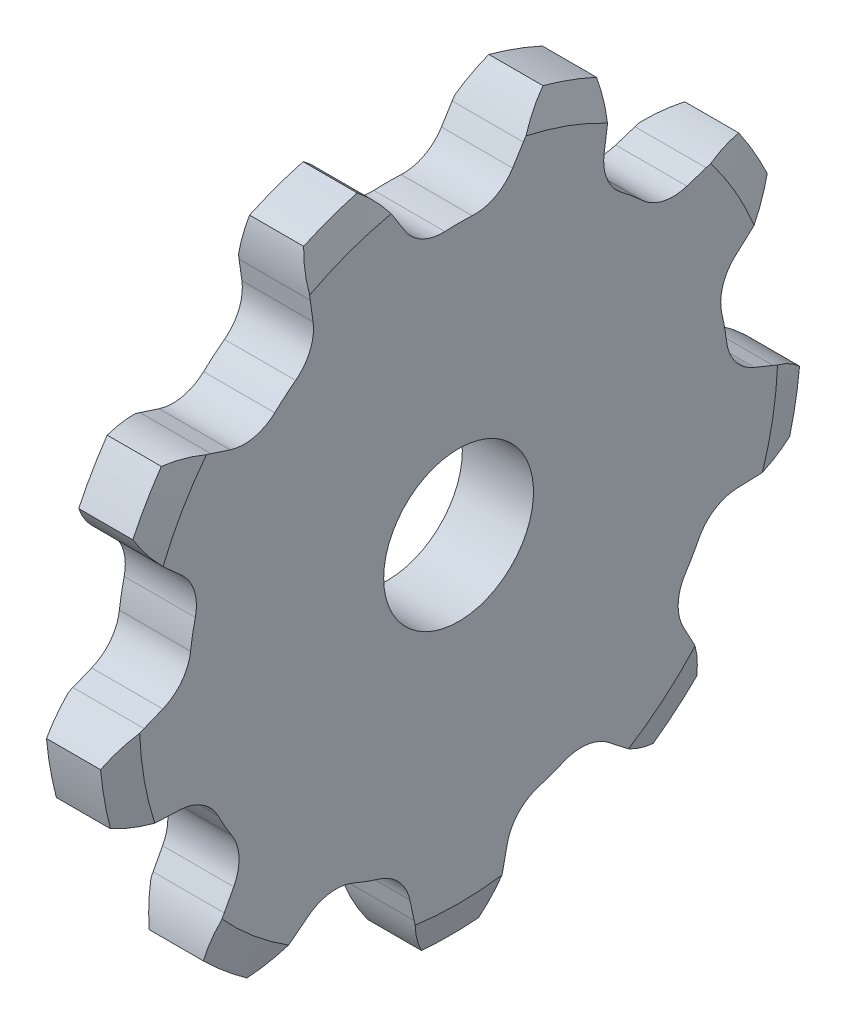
ISO-10303-21;
HEADER;
FILE_DESCRIPTION(('STEP AP214'),'2;1');
FILE_NAME('part.step','',(''),(''),'','','');
FILE_SCHEMA(('AUTOMOTIVE_DESIGN { 1 0 10303 214 1 1 1 1 }'));
ENDSEC;
DATA;
#1=APPLICATION_CONTEXT('core data for automotive mechanical design processes');
#2=APPLICATION_PROTOCOL_DEFINITION('international standard','automotive_design',2000,#1);
#3=PRODUCT_CONTEXT('',#1,'mechanical');
#4=PRODUCT('Part','Part','',(#3));
#5=PRODUCT_RELATED_PRODUCT_CATEGORY('part','',(#4));
#6=PRODUCT_DEFINITION_FORMATION('','',#4);
#7=PRODUCT_DEFINITION_CONTEXT('part definition',#1,'design');
#8=PRODUCT_DEFINITION('design','',#6,#7);
#9=PRODUCT_DEFINITION_SHAPE('','',#8);
#10=(LENGTH_UNIT() NAMED_UNIT(*) SI_UNIT(.MILLI.,.METRE.));
#11=(NAMED_UNIT(*) PLANE_ANGLE_UNIT() SI_UNIT($,.RADIAN.));
#12=(NAMED_UNIT(*) SI_UNIT($,.STERADIAN.) SOLID_ANGLE_UNIT());
#13=UNCERTAINTY_MEASURE_WITH_UNIT(LENGTH_MEASURE(1.E-05),#10,'distance_accuracy_value','');
#14=(GEOMETRIC_REPRESENTATION_CONTEXT(3) GLOBAL_UNCERTAINTY_ASSIGNED_CONTEXT((#13)) GLOBAL_UNIT_ASSIGNED_CONTEXT((#10,
#11,#12)) REPRESENTATION_CONTEXT('',''));
#15=CARTESIAN_POINT('',(0.,0.,0.));
#16=DIRECTION('',(0.,0.,1.));
#17=DIRECTION('',(1.,0.,0.));
#18=AXIS2_PLACEMENT_3D('',#15,#16,#17);
#19=CARTESIAN_POINT('',(24.13,0.,0.));
#20=DIRECTION('',(-1.,0.,0.));
#21=DIRECTION('',(0.,0.,1.));
#22=AXIS2_PLACEMENT_3D('',#19,#20,#21);
#23=PLANE('',#22);
#24=CARTESIAN_POINT('',(24.13,99.4145166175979,12.5739841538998));
#25=DIRECTION('',(-1.,0.,0.));
#26=DIRECTION('',(0.,-0.642787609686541,0.766044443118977));
#27=AXIS2_PLACEMENT_3D('',#24,#25,#26);
#28=CIRCLE('',#27,38.1);
#29=CARTESIAN_POINT('',(24.13,94.1120214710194,50.3031975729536));
#30=VERTEX_POINT('',#29);
#31=CARTESIAN_POINT('',(24.13,95.7214412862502,50.4945747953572));
#32=VERTEX_POINT('',#31);
#33=EDGE_CURVE('E931',#30,#32,#28,.T.);
#34=ORIENTED_EDGE('',*,*,#33,.F.);
#35=DIRECTION('',(0.,0.990268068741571,0.139173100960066));
#36=VECTOR('',#35,1.);
#37=CARTESIAN_POINT('',(24.13,87.3207630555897,49.3487484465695));
#38=LINE('',#37,#36);
#39=CARTESIAN_POINT('',(24.13,87.3207630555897,49.3487484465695));
#40=VERTEX_POINT('',#39);
#41=EDGE_CURVE('E928',#40,#30,#38,.T.);
#42=ORIENTED_EDGE('',*,*,#41,.F.);
#43=CARTESIAN_POINT('',(24.13,85.1997649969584,64.440433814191));
#44=DIRECTION('',(1.,0.,0.));
#45=DIRECTION('',(0.,0.642787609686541,-0.766044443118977));
#46=AXIS2_PLACEMENT_3D('',#43,#44,#45);
#47=CIRCLE('',#46,15.24);
#48=CARTESIAN_POINT('',(24.13,73.0448850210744,55.2471486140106));
#49=VERTEX_POINT('',#48);
#50=EDGE_CURVE('E926',#49,#40,#47,.T.);
#51=ORIENTED_EDGE('',*,*,#50,.F.);
#52=CARTESIAN_POINT('',(24.13,0.,0.));
#53=DIRECTION('',(-1.,0.,0.));
#54=DIRECTION('',(0.,0.642787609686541,-0.766044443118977));
#55=AXIS2_PLACEMENT_3D('',#52,#53,#54);
#56=CIRCLE('',#55,91.5849477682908);
#57=CARTESIAN_POINT('',(24.13,67.0919314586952,62.3416024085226));
#58=VERTEX_POINT('',#57);
#59=EDGE_CURVE('E939',#58,#49,#56,.T.);
#60=ORIENTED_EDGE('',*,*,#59,.F.);
#61=CARTESIAN_POINT('',(24.13,78.2562227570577,72.7154252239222));
#62=DIRECTION('',(1.,0.,0.));
#63=DIRECTION('',(0.,-0.642787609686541,0.766044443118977));
#64=AXIS2_PLACEMENT_3D('',#61,#62,#63);
#65=CIRCLE('',#64,15.24);
#66=CARTESIAN_POINT('',(24.13,63.7621214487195,77.4248442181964));
#67=VERTEX_POINT('',#66);
#68=EDGE_CURVE('E937',#67,#58,#65,.T.);
#69=ORIENTED_EDGE('',*,*,#68,.F.);
#70=DIRECTION('',(0.,-0.309016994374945,-0.951056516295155));
#71=VECTOR('',#70,1.);
#72=CARTESIAN_POINT('',(24.13,63.7621214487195,77.4248442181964));
#73=LINE('',#72,#71);
#74=CARTESIAN_POINT('',(24.13,65.8813599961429,83.9471898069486));
#75=VERTEX_POINT('',#74);
#76=EDGE_CURVE('E935',#75,#67,#73,.T.);
#77=ORIENTED_EDGE('',*,*,#76,.F.);
#78=CARTESIAN_POINT('',(24.13,29.6461067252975,95.720737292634));
#79=DIRECTION('',(-1.,0.,0.));
#80=DIRECTION('',(0.,0.642787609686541,-0.766044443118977));
#81=AXIS2_PLACEMENT_3D('',#78,#79,#80);
#82=CIRCLE('',#81,38.1);
#83=CARTESIAN_POINT('',(24.13,66.3493025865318,85.498926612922));
#84=VERTEX_POINT('',#83);
#85=EDGE_CURVE('E933',#84,#75,#82,.T.);
#86=ORIENTED_EDGE('',*,*,#85,.F.);
#87=CARTESIAN_POINT('',(24.13,0.,0.));
#88=DIRECTION('',(-1.,0.,0.));
#89=DIRECTION('',(0.,0.,1.));
#90=AXIS2_PLACEMENT_3D('',#87,#88,#89);
#91=CIRCLE('',#90,108.223363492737);
#92=CARTESIAN_POINT('',(24.13,40.8695911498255,100.209644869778));
#93=VERTEX_POINT('',#92);
#94=EDGE_CURVE('E1404',#93,#84,#91,.T.);
#95=ORIENTED_EDGE('',*,*,#94,.F.);
#96=CARTESIAN_POINT('',(24.13,68.0735368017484,73.5346501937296));
#97=DIRECTION('',(-1.,0.,0.));
#98=DIRECTION('',(0.,-0.984807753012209,0.173648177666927));
#99=AXIS2_PLACEMENT_3D('',#96,#97,#98);
#100=CIRCLE('',#99,38.1);
#101=CARTESIAN_POINT('',(24.13,39.7597189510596,99.0285262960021));
#102=VERTEX_POINT('',#101);
#103=EDGE_CURVE('E889',#102,#93,#100,.T.);
#104=ORIENTED_EDGE('',*,*,#103,.F.);
#105=DIRECTION('',(0.,0.669130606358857,0.743144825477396));
#106=VECTOR('',#105,1.);
#107=CARTESIAN_POINT('',(24.13,35.1708212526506,93.9320390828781));
#108=LINE('',#107,#106);
#109=CARTESIAN_POINT('',(24.13,35.1708212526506,93.9320390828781));
#110=VERTEX_POINT('',#109);
#111=EDGE_CURVE('E886',#110,#102,#108,.T.);
#112=ORIENTED_EDGE('',*,*,#111,.F.);
#113=CARTESIAN_POINT('',(24.13,23.8452941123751,104.129589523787));
#114=DIRECTION('',(1.,0.,0.));
#115=DIRECTION('',(0.,0.984807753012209,-0.173648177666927));
#116=AXIS2_PLACEMENT_3D('',#113,#114,#115);
#117=CIRCLE('',#116,15.24);
#118=CARTESIAN_POINT('',(24.13,20.4434456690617,89.2741182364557));
#119=VERTEX_POINT('',#118);
#120=EDGE_CURVE('E884',#119,#110,#117,.T.);
#121=ORIENTED_EDGE('',*,*,#120,.F.);
#122=CARTESIAN_POINT('',(24.13,0.,0.));
#123=DIRECTION('',(-1.,0.,0.));
#124=DIRECTION('',(0.,0.984807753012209,-0.173648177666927));
#125=AXIS2_PLACEMENT_3D('',#122,#123,#124);
#126=CIRCLE('',#125,91.5849477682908);
#127=CARTESIAN_POINT('',(24.13,11.3229916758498,90.8823003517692));
#128=VERTEX_POINT('',#127);
#129=EDGE_CURVE('E897',#128,#119,#126,.T.);
#130=ORIENTED_EDGE('',*,*,#129,.F.);
#131=CARTESIAN_POINT('',(24.13,13.2071702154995,106.005377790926));
#132=DIRECTION('',(1.,0.,0.));
#133=DIRECTION('',(0.,-0.984807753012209,0.173648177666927));
#134=AXIS2_PLACEMENT_3D('',#131,#132,#133);
#135=CIRCLE('',#134,15.24);
#136=CARTESIAN_POINT('',(24.13,-0.923111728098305,100.296373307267));
#137=VERTEX_POINT('',#136);
#138=EDGE_CURVE('E895',#137,#128,#135,.T.);
#139=ORIENTED_EDGE('',*,*,#138,.F.);
#140=DIRECTION('',(0.,0.374606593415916,-0.927183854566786));
#141=VECTOR('',#140,1.);
#142=CARTESIAN_POINT('',(24.13,-0.923111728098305,100.296373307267));
#143=LINE('',#142,#141);
#144=CARTESIAN_POINT('',(24.13,-3.49216374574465,106.655000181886));
#145=VERTEX_POINT('',#144);
#146=EDGE_CURVE('E893',#145,#137,#143,.T.);
#147=ORIENTED_EDGE('',*,*,#146,.F.);
#148=CARTESIAN_POINT('',(24.13,-38.8178686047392,92.3824889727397));
#149=DIRECTION('',(-1.,0.,0.));
#150=DIRECTION('',(0.,0.984807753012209,-0.173648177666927));
#151=AXIS2_PLACEMENT_3D('',#148,#149,#150);
#152=CIRCLE('',#151,38.1);
#153=CARTESIAN_POINT('',(24.13,-4.13113611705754,108.144487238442));
#154=VERTEX_POINT('',#153);
#155=EDGE_CURVE('E891',#154,#145,#152,.T.);
#156=ORIENTED_EDGE('',*,*,#155,.F.);
#157=CARTESIAN_POINT('',(24.13,-33.1055949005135,103.035508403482));
#158=VERTEX_POINT('',#157);
#159=EDGE_CURVE('E1398',#158,#154,#91,.T.);
#160=ORIENTED_EDGE('',*,*,#159,.F.);
#161=CARTESIAN_POINT('',(24.13,4.88019256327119,100.087636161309));
#162=DIRECTION('',(-1.,0.,0.));
#163=DIRECTION('',(0.,-0.866025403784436,-0.500000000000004));
#164=AXIS2_PLACEMENT_3D('',#161,#162,#163);
#165=CIRCLE('',#164,38.1);
#166=CARTESIAN_POINT('',(24.13,-33.1965979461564,101.417306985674));
#167=VERTEX_POINT('',#166);
#168=EDGE_CURVE('E844',#167,#158,#165,.T.);
#169=ORIENTED_EDGE('',*,*,#168,.F.);
#170=DIRECTION('',(0.,0.0348994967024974,0.999390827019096));
#171=VECTOR('',#170,1.);
#172=CARTESIAN_POINT('',(24.13,-33.4359386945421,94.5634846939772));
#173=LINE('',#172,#171);
#174=CARTESIAN_POINT('',(24.13,-33.4359386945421,94.5634846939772));
#175=VERTEX_POINT('',#174);
#176=EDGE_CURVE('E841',#175,#167,#173,.T.);
#177=ORIENTED_EDGE('',*,*,#176,.F.);
#178=CARTESIAN_POINT('',(24.13,-48.6666548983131,95.0953530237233));
#179=DIRECTION('',(1.,0.,0.));
#180=DIRECTION('',(0.,0.866025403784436,0.500000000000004));
#181=AXIS2_PLACEMENT_3D('',#178,#179,#180);
#182=CIRCLE('',#181,15.24);
#183=CARTESIAN_POINT('',(24.13,-41.7237091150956,81.5287357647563));
#184=VERTEX_POINT('',#183);
#185=EDGE_CURVE('E839',#184,#175,#182,.T.);
#186=ORIENTED_EDGE('',*,*,#185,.F.);
#187=CARTESIAN_POINT('',(24.13,0.,0.));
#188=DIRECTION('',(-1.,0.,0.));
#189=DIRECTION('',(0.,0.866025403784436,0.500000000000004));
#190=AXIS2_PLACEMENT_3D('',#187,#188,#189);
#191=CIRCLE('',#190,91.5849477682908);
#192=CARTESIAN_POINT('',(24.13,-49.7441017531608,76.8981599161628));
#193=VERTEX_POINT('',#192);
#194=EDGE_CURVE('E852',#193,#184,#191,.T.);
#195=ORIENTED_EDGE('',*,*,#194,.F.);
#196=CARTESIAN_POINT('',(24.13,-58.0216640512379,89.6942359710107));
#197=DIRECTION('',(1.,0.,0.));
#198=DIRECTION('',(0.,-0.866025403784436,-0.500000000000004));
#199=AXIS2_PLACEMENT_3D('',#196,#197,#198);
#200=CIRCLE('',#199,15.24);
#201=CARTESIAN_POINT('',(24.13,-65.1764106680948,76.2381146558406));
#202=VERTEX_POINT('',#201);
#203=EDGE_CURVE('E850',#202,#193,#200,.T.);
#204=ORIENTED_EDGE('',*,*,#203,.F.);
#205=DIRECTION('',(0.,0.88294759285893,-0.469471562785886));
#206=VECTOR('',#205,1.);
#207=CARTESIAN_POINT('',(24.13,-65.1764106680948,76.2381146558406));
#208=LINE('',#207,#206);
#209=CARTESIAN_POINT('',(24.13,-71.2316652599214,79.4577506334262));
#210=VERTEX_POINT('',#209);
#211=EDGE_CURVE('E848',#210,#202,#208,.T.);
#212=ORIENTED_EDGE('',*,*,#211,.F.);
#213=CARTESIAN_POINT('',(24.13,-89.1185318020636,45.8174473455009));
#214=DIRECTION('',(-1.,0.,0.));
#215=DIRECTION('',(0.,0.866025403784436,0.500000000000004));
#216=AXIS2_PLACEMENT_3D('',#213,#214,#215);
#217=CIRCLE('',#216,38.1);
#218=CARTESIAN_POINT('',(24.13,-72.678570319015,80.1880403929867));
#219=VERTEX_POINT('',#218);
#220=EDGE_CURVE('E846',#219,#210,#217,.T.);
#221=ORIENTED_EDGE('',*,*,#220,.F.);
#222=CARTESIAN_POINT('',(24.13,-91.5903051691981,57.6499124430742));
#223=VERTEX_POINT('',#222);
#224=EDGE_CURVE('E1403',#223,#219,#91,.T.);
#225=ORIENTED_EDGE('',*,*,#224,.F.);
#226=CARTESIAN_POINT('',(24.13,-60.5966480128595,79.8085048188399));
#227=DIRECTION('',(-1.,0.,0.));
#228=DIRECTION('',(0.,-0.342020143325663,-0.939692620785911));
#229=AXIS2_PLACEMENT_3D('',#226,#227,#228);
#230=CIRCLE('',#229,38.1);
#231=CARTESIAN_POINT('',(24.13,-90.6198577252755,56.3518026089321));
#232=VERTEX_POINT('',#231);
#233=EDGE_CURVE('E798',#232,#223,#230,.T.);
#234=ORIENTED_EDGE('',*,*,#233,.F.);
#235=DIRECTION('',(0.,-0.615661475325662,0.788010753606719));
#236=VECTOR('',#235,1.);
#237=CARTESIAN_POINT('',(24.13,-86.3976513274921,50.9476248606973));
#238=LINE('',#237,#236);
#239=CARTESIAN_POINT('',(24.13,-86.3976513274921,50.9476248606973));
#240=VERTEX_POINT('',#239);
#241=EDGE_CURVE('E795',#240,#232,#238,.T.);
#242=ORIENTED_EDGE('',*,*,#241,.F.);
#243=CARTESIAN_POINT('',(24.13,-98.4069352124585,41.5649439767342));
#244=DIRECTION('',(1.,0.,0.));
#245=DIRECTION('',(0.,0.342020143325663,0.939692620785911));
#246=AXIS2_PLACEMENT_3D('',#243,#244,#245);
#247=CIRCLE('',#246,15.24);
#248=CARTESIAN_POINT('',(24.13,-84.3678766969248,35.6351517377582));
#249=VERTEX_POINT('',#248);
#250=EDGE_CURVE('E793',#249,#240,#247,.T.);
#251=ORIENTED_EDGE('',*,*,#250,.F.);
#252=CARTESIAN_POINT('',(24.13,0.,0.));
#253=DIRECTION('',(-1.,0.,0.));
#254=DIRECTION('',(0.,0.342020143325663,0.939692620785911));
#255=AXIS2_PLACEMENT_3D('',#252,#253,#254);
#256=CIRCLE('',#255,91.5849477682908);
#257=CARTESIAN_POINT('',(24.13,-87.5353771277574,26.9325158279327));
#258=VERTEX_POINT('',#257);
#259=EDGE_CURVE('E806',#258,#249,#256,.T.);
#260=ORIENTED_EDGE('',*,*,#259,.F.);
#261=CARTESIAN_POINT('',(24.13,-102.101516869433,31.4141642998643));
#262=DIRECTION('',(1.,0.,0.));
#263=DIRECTION('',(0.,-0.342020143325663,-0.939692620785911));
#264=AXIS2_PLACEMENT_3D('',#261,#262,#263);
#265=CIRCLE('',#264,15.24);
#266=CARTESIAN_POINT('',(24.13,-98.9329427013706,16.5071948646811));
#267=VERTEX_POINT('',#266);
#268=EDGE_CURVE('E804',#267,#258,#265,.T.);
#269=ORIENTED_EDGE('',*,*,#268,.F.);
#270=DIRECTION('',(0.,0.978147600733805,0.207911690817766));
#271=VECTOR('',#270,1.);
#272=CARTESIAN_POINT('',(24.13,-98.9329427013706,16.5071948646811));
#273=LINE('',#272,#271);
#274=CARTESIAN_POINT('',(24.13,-105.641078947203,15.0813364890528));
#275=VERTEX_POINT('',#274);
#276=EDGE_CURVE('E802',#275,#267,#273,.T.);
#277=ORIENTED_EDGE('',*,*,#276,.F.);
#278=CARTESIAN_POINT('',(24.13,-97.7196435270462,-22.1860870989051));
#279=DIRECTION('',(-1.,0.,0.));
#280=DIRECTION('',(0.,0.342020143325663,0.939692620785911));
#281=AXIS2_PLACEMENT_3D('',#278,#279,#280);
#282=CIRCLE('',#281,38.1);
#283=CARTESIAN_POINT('',(24.13,-107.218893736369,14.7107182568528));
#284=VERTEX_POINT('',#283);
#285=EDGE_CURVE('E800',#284,#275,#282,.T.);
#286=ORIENTED_EDGE('',*,*,#285,.F.);
#287=CARTESIAN_POINT('',(24.13,-107.218893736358,-14.7107182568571));
#288=VERTEX_POINT('',#287);
#289=EDGE_CURVE('E1406',#288,#284,#91,.T.);
#290=ORIENTED_EDGE('',*,*,#289,.F.);
#291=CARTESIAN_POINT('',(24.13,-97.7196435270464,22.1860870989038));
#292=DIRECTION('',(-1.,0.,0.));
#293=DIRECTION('',(0.,0.342020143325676,-0.939692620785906));
#294=AXIS2_PLACEMENT_3D('',#291,#292,#293);
#295=CIRCLE('',#294,38.1);
#296=CARTESIAN_POINT('',(24.13,-105.641078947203,-15.0813364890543));
#297=VERTEX_POINT('',#296);
#298=EDGE_CURVE('E752',#297,#288,#295,.T.);
#299=ORIENTED_EDGE('',*,*,#298,.F.);
#300=DIRECTION('',(0.,-0.978147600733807,0.207911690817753));
#301=VECTOR('',#300,1.);
#302=CARTESIAN_POINT('',(24.13,-98.9329427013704,-16.5071948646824));
#303=LINE('',#302,#301);
#304=CARTESIAN_POINT('',(24.13,-98.9329427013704,-16.5071948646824));
#305=VERTEX_POINT('',#304);
#306=EDGE_CURVE('E749',#305,#297,#303,.T.);
#307=ORIENTED_EDGE('',*,*,#306,.F.);
#308=CARTESIAN_POINT('',(24.13,-102.101516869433,-31.4141642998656));
#309=DIRECTION('',(1.,0.,0.));
#310=DIRECTION('',(0.,-0.342020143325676,0.939692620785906));
#311=AXIS2_PLACEMENT_3D('',#308,#309,#310);
#312=CIRCLE('',#311,15.24);
#313=CARTESIAN_POINT('',(24.13,-87.535377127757,-26.9325158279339));
#314=VERTEX_POINT('',#313);
#315=EDGE_CURVE('E747',#314,#305,#312,.T.);
#316=ORIENTED_EDGE('',*,*,#315,.F.);
#317=CARTESIAN_POINT('',(24.13,0.,0.));
#318=DIRECTION('',(-1.,0.,0.));
#319=DIRECTION('',(0.,-0.342020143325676,0.939692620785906));
#320=AXIS2_PLACEMENT_3D('',#317,#318,#319);
#321=CIRCLE('',#320,91.5849477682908);
#322=CARTESIAN_POINT('',(24.13,-84.3678766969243,-35.6351517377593));
#323=VERTEX_POINT('',#322);
#324=EDGE_CURVE('E760',#323,#314,#321,.T.);
#325=ORIENTED_EDGE('',*,*,#324,.F.);
#326=CARTESIAN_POINT('',(24.13,-98.406935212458,-41.5649439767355));
#327=DIRECTION('',(1.,0.,0.));
#328=DIRECTION('',(0.,0.342020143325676,-0.939692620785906));
#329=AXIS2_PLACEMENT_3D('',#326,#327,#328);
#330=CIRCLE('',#329,15.24);
#331=CARTESIAN_POINT('',(24.13,-86.3976513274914,-50.9476248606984));
#332=VERTEX_POINT('',#331);
#333=EDGE_CURVE('E758',#332,#323,#330,.T.);
#334=ORIENTED_EDGE('',*,*,#333,.F.);
#335=DIRECTION('',(0.,0.615661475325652,0.788010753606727));
#336=VECTOR('',#335,1.);
#337=CARTESIAN_POINT('',(24.13,-86.3976513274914,-50.9476248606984));
#338=LINE('',#337,#336);
#339=CARTESIAN_POINT('',(24.13,-90.6198577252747,-56.3518026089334));
#340=VERTEX_POINT('',#339);
#341=EDGE_CURVE('E756',#340,#332,#338,.T.);
#342=ORIENTED_EDGE('',*,*,#341,.F.);
#343=CARTESIAN_POINT('',(24.13,-60.5966480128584,-79.8085048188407));
#344=DIRECTION('',(-1.,0.,0.));
#345=DIRECTION('',(0.,-0.342020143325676,0.939692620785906));
#346=AXIS2_PLACEMENT_3D('',#343,#344,#345);
#347=CIRCLE('',#346,38.1);
#348=CARTESIAN_POINT('',(24.13,-91.5903051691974,-57.6499124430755));
#349=VERTEX_POINT('',#348);
#350=EDGE_CURVE('E754',#349,#340,#347,.T.);
#351=ORIENTED_EDGE('',*,*,#350,.F.);
#352=CARTESIAN_POINT('',(24.13,-72.6785703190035,-80.1880403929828));
#353=VERTEX_POINT('',#352);
#354=EDGE_CURVE('E1892',#353,#349,#91,.T.);
#355=ORIENTED_EDGE('',*,*,#354,.F.);
#356=CARTESIAN_POINT('',(24.13,-89.118531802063,-45.8174473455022));
#357=DIRECTION('',(-1.,0.,0.));
#358=DIRECTION('',(0.,0.866025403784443,-0.499999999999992));
#359=AXIS2_PLACEMENT_3D('',#356,#357,#358);
#360=CIRCLE('',#359,38.1);
#361=CARTESIAN_POINT('',(24.13,-71.2316652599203,-79.4577506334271));
#362=VERTEX_POINT('',#361);
#363=EDGE_CURVE('E706',#362,#353,#360,.T.);
#364=ORIENTED_EDGE('',*,*,#363,.F.);
#365=DIRECTION('',(0.,-0.882947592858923,-0.469471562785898));
#366=VECTOR('',#365,1.);
#367=CARTESIAN_POINT('',(24.13,-65.1764106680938,-76.2381146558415));
#368=LINE('',#367,#366);
#369=CARTESIAN_POINT('',(24.13,-65.1764106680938,-76.2381146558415));
#370=VERTEX_POINT('',#369);
#371=EDGE_CURVE('E703',#370,#362,#368,.T.);
#372=ORIENTED_EDGE('',*,*,#371,.F.);
#373=CARTESIAN_POINT('',(24.13,-58.0216640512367,-89.6942359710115));
#374=DIRECTION('',(1.,0.,0.));
#375=DIRECTION('',(0.,-0.866025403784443,0.499999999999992));
#376=AXIS2_PLACEMENT_3D('',#373,#374,#375);
#377=CIRCLE('',#376,15.24);
#378=CARTESIAN_POINT('',(24.13,-49.7441017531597,-76.8981599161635));
#379=VERTEX_POINT('',#378);
#380=EDGE_CURVE('E701',#379,#370,#377,.T.);
#381=ORIENTED_EDGE('',*,*,#380,.F.);
#382=CARTESIAN_POINT('',(24.13,0.,0.));
#383=DIRECTION('',(-1.,0.,0.));
#384=DIRECTION('',(0.,-0.866025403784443,0.499999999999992));
#385=AXIS2_PLACEMENT_3D('',#382,#383,#384);
#386=CIRCLE('',#385,91.5849477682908);
#387=CARTESIAN_POINT('',(24.13,-41.7237091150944,-81.5287357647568));
#388=VERTEX_POINT('',#387);
#389=EDGE_CURVE('E714',#388,#379,#386,.T.);
#390=ORIENTED_EDGE('',*,*,#389,.F.);
#391=CARTESIAN_POINT('',(24.13,-48.6666548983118,-95.0953530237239));
#392=DIRECTION('',(1.,0.,0.));
#393=DIRECTION('',(0.,0.866025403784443,-0.499999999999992));
#394=AXIS2_PLACEMENT_3D('',#391,#392,#393);
#395=CIRCLE('',#394,15.24);
#396=CARTESIAN_POINT('',(24.13,-33.4359386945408,-94.5634846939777));
#397=VERTEX_POINT('',#396);
#398=EDGE_CURVE('E712',#397,#388,#395,.T.);
#399=ORIENTED_EDGE('',*,*,#398,.F.);
#400=DIRECTION('',(0.,-0.0348994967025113,0.999390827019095));
#401=VECTOR('',#400,1.);
#402=CARTESIAN_POINT('',(24.13,-33.4359386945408,-94.5634846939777));
#403=LINE('',#402,#401);
#404=CARTESIAN_POINT('',(24.13,-33.196597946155,-101.417306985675));
#405=VERTEX_POINT('',#404);
#406=EDGE_CURVE('E710',#405,#397,#403,.T.);
#407=ORIENTED_EDGE('',*,*,#406,.F.);
#408=CARTESIAN_POINT('',(24.13,4.88019256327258,-100.087636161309));
#409=DIRECTION('',(-1.,0.,0.));
#410=DIRECTION('',(0.,-0.866025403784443,0.499999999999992));
#411=AXIS2_PLACEMENT_3D('',#408,#409,#410);
#412=CIRCLE('',#411,38.1);
#413=CARTESIAN_POINT('',(24.13,-33.1055949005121,-103.035508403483));
#414=VERTEX_POINT('',#413);
#415=EDGE_CURVE('E708',#414,#405,#412,.T.);
#416=ORIENTED_EDGE('',*,*,#415,.F.);
#417=CARTESIAN_POINT('',(24.13,-4.13113611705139,-108.144487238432));
#418=VERTEX_POINT('',#417);
#419=EDGE_CURVE('E1820',#418,#414,#91,.T.);
#420=ORIENTED_EDGE('',*,*,#419,.F.);
#421=CARTESIAN_POINT('',(24.13,-38.817868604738,-92.3824889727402));
#422=DIRECTION('',(-1.,0.,0.));
#423=DIRECTION('',(0.,0.984807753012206,0.17364817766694));
#424=AXIS2_PLACEMENT_3D('',#421,#422,#423);
#425=CIRCLE('',#424,38.1);
#426=CARTESIAN_POINT('',(24.13,-3.49216374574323,-106.655000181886));
#427=VERTEX_POINT('',#426);
#428=EDGE_CURVE('E660',#427,#418,#425,.T.);
#429=ORIENTED_EDGE('',*,*,#428,.F.);
#430=DIRECTION('',(0.,-0.374606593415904,-0.927183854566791));
#431=VECTOR('',#430,1.);
#432=CARTESIAN_POINT('',(24.13,-0.923111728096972,-100.296373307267));
#433=LINE('',#432,#431);
#434=CARTESIAN_POINT('',(24.13,-0.923111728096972,-100.296373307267));
#435=VERTEX_POINT('',#434);
#436=EDGE_CURVE('E657',#435,#427,#433,.T.);
#437=ORIENTED_EDGE('',*,*,#436,.F.);
#438=CARTESIAN_POINT('',(24.13,13.2071702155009,-106.005377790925));
#439=DIRECTION('',(1.,0.,0.));
#440=DIRECTION('',(0.,-0.984807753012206,-0.17364817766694));
#441=AXIS2_PLACEMENT_3D('',#438,#439,#440);
#442=CIRCLE('',#441,15.24);
#443=CARTESIAN_POINT('',(24.13,11.322991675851,-90.882300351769));
#444=VERTEX_POINT('',#443);
#445=EDGE_CURVE('E655',#444,#435,#442,.T.);
#446=ORIENTED_EDGE('',*,*,#445,.F.);
#447=CARTESIAN_POINT('',(24.13,0.,0.));
#448=DIRECTION('',(-1.,0.,0.));
#449=DIRECTION('',(0.,-0.984807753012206,-0.17364817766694));
#450=AXIS2_PLACEMENT_3D('',#447,#448,#449);
#451=CIRCLE('',#450,91.5849477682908);
#452=CARTESIAN_POINT('',(24.13,20.4434456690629,-89.2741182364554));
#453=VERTEX_POINT('',#452);
#454=EDGE_CURVE('E668',#453,#444,#451,.T.);
#455=ORIENTED_EDGE('',*,*,#454,.F.);
#456=CARTESIAN_POINT('',(24.13,23.8452941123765,-104.129589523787));
#457=DIRECTION('',(1.,0.,0.));
#458=DIRECTION('',(0.,0.984807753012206,0.17364817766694));
#459=AXIS2_PLACEMENT_3D('',#456,#457,#458);
#460=CIRCLE('',#459,15.24);
#461=CARTESIAN_POINT('',(24.13,35.1708212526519,-93.9320390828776));
#462=VERTEX_POINT('',#461);
#463=EDGE_CURVE('E666',#462,#453,#460,.T.);
#464=ORIENTED_EDGE('',*,*,#463,.F.);
#465=DIRECTION('',(0.,-0.669130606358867,0.743144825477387));
#466=VECTOR('',#465,1.);
#467=CARTESIAN_POINT('',(24.13,35.1708212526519,-93.9320390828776));
#468=LINE('',#467,#466);
#469=CARTESIAN_POINT('',(24.13,39.759718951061,-99.0285262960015));
#470=VERTEX_POINT('',#469);
#471=EDGE_CURVE('E664',#470,#462,#468,.T.);
#472=ORIENTED_EDGE('',*,*,#471,.F.);
#473=CARTESIAN_POINT('',(24.13,68.0735368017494,-73.5346501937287));
#474=DIRECTION('',(-1.,0.,0.));
#475=DIRECTION('',(0.,-0.984807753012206,-0.17364817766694));
#476=AXIS2_PLACEMENT_3D('',#473,#474,#475);
#477=CIRCLE('',#476,38.1);
#478=CARTESIAN_POINT('',(24.13,40.8695911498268,-100.209644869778));
#479=VERTEX_POINT('',#478);
#480=EDGE_CURVE('E662',#479,#470,#477,.T.);
#481=ORIENTED_EDGE('',*,*,#480,.F.);
#482=CARTESIAN_POINT('',(24.13,66.349302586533,-85.4989266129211));
#483=VERTEX_POINT('',#482);
#484=EDGE_CURVE('E1379',#483,#479,#91,.T.);
#485=ORIENTED_EDGE('',*,*,#484,.F.);
#486=CARTESIAN_POINT('',(24.13,29.6461067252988,-95.7207372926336));
#487=DIRECTION('',(-1.,0.,0.));
#488=DIRECTION('',(0.,0.64278760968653,0.766044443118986));
#489=AXIS2_PLACEMENT_3D('',#486,#487,#488);
#490=CIRCLE('',#489,38.1);
#491=CARTESIAN_POINT('',(24.13,65.881359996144,-83.9471898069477));
#492=VERTEX_POINT('',#491);
#493=EDGE_CURVE('E619',#492,#483,#490,.T.);
#494=ORIENTED_EDGE('',*,*,#493,.F.);
#495=DIRECTION('',(0.,0.309016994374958,-0.95105651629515));
#496=VECTOR('',#495,1.);
#497=CARTESIAN_POINT('',(24.13,63.7621214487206,-77.4248442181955));
#498=LINE('',#497,#496);
#499=CARTESIAN_POINT('',(24.13,63.7621214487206,-77.4248442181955));
#500=VERTEX_POINT('',#499);
#501=EDGE_CURVE('E604',#500,#492,#498,.T.);
#502=ORIENTED_EDGE('',*,*,#501,.F.);
#503=CARTESIAN_POINT('',(24.13,78.2562227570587,-72.7154252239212));
#504=DIRECTION('',(1.,0.,0.));
#505=DIRECTION('',(0.,-0.64278760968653,-0.766044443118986));
#506=AXIS2_PLACEMENT_3D('',#503,#504,#505);
#507=CIRCLE('',#506,15.24);
#508=CARTESIAN_POINT('',(24.13,67.091931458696,-62.3416024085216));
#509=VERTEX_POINT('',#508);
#510=EDGE_CURVE('E594',#509,#500,#507,.T.);
#511=ORIENTED_EDGE('',*,*,#510,.F.);
#512=CARTESIAN_POINT('',(24.13,0.,0.));
#513=DIRECTION('',(-1.,0.,0.));
#514=DIRECTION('',(0.,-0.64278760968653,-0.766044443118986));
#515=AXIS2_PLACEMENT_3D('',#512,#513,#514);
#516=CIRCLE('',#515,91.5849477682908);
#517=CARTESIAN_POINT('',(24.13,73.0448850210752,-55.2471486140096));
#518=VERTEX_POINT('',#517);
#519=EDGE_CURVE('E630',#518,#509,#516,.T.);
#520=ORIENTED_EDGE('',*,*,#519,.F.);
#521=CARTESIAN_POINT('',(24.13,85.1997649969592,-64.4404338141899));
#522=DIRECTION('',(1.,0.,0.));
#523=DIRECTION('',(0.,0.64278760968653,0.766044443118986));
#524=AXIS2_PLACEMENT_3D('',#521,#522,#523);
#525=CIRCLE('',#524,15.24);
#526=CARTESIAN_POINT('',(24.13,87.3207630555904,-49.3487484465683));
#527=VERTEX_POINT('',#526);
#528=EDGE_CURVE('E628',#527,#518,#525,.T.);
#529=ORIENTED_EDGE('',*,*,#528,.F.);
#530=DIRECTION('',(0.,-0.990268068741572,0.139173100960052));
#531=VECTOR('',#530,1.);
#532=CARTESIAN_POINT('',(24.13,87.3207630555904,-49.3487484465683));
#533=LINE('',#532,#531);
#534=CARTESIAN_POINT('',(24.13,94.1120214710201,-50.3031975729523));
#535=VERTEX_POINT('',#534);
#536=EDGE_CURVE('E626',#535,#527,#533,.T.);
#537=ORIENTED_EDGE('',*,*,#536,.F.);
#538=CARTESIAN_POINT('',(24.13,99.4145166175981,-12.5739841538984));
#539=DIRECTION('',(-1.,0.,0.));
#540=DIRECTION('',(0.,-0.64278760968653,-0.766044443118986));
#541=AXIS2_PLACEMENT_3D('',#538,#539,#540);
#542=CIRCLE('',#541,38.1);
#543=CARTESIAN_POINT('',(24.13,95.7214412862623,-50.494574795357));
#544=VERTEX_POINT('',#543);
#545=EDGE_CURVE('E621',#544,#535,#542,.T.);
#546=ORIENTED_EDGE('',*,*,#545,.F.);
#547=CARTESIAN_POINT('',(24.13,105.784165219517,-22.8474680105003));
#548=VERTEX_POINT('',#547);
#549=EDGE_CURVE('E1375',#548,#544,#91,.T.);
#550=ORIENTED_EDGE('',*,*,#549,.F.);
#551=CARTESIAN_POINT('',(24.13,84.2383392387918,-54.2701888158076));
#552=DIRECTION('',(-1.,0.,0.));
#553=DIRECTION('',(0.,0.,1.));
#554=AXIS2_PLACEMENT_3D('',#551,#552,#553);
#555=CIRCLE('',#554,38.1);
#556=CARTESIAN_POINT('',(24.13,104.428263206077,-21.9595563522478));
#557=VERTEX_POINT('',#556);
#558=EDGE_CURVE('E1427',#557,#548,#555,.T.);
#559=ORIENTED_EDGE('',*,*,#558,.F.);
#560=DIRECTION('',(0.,0.848048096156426,-0.529919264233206));
#561=VECTOR('',#560,1.);
#562=CARTESIAN_POINT('',(24.13,98.6123493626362,-18.3253700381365));
#563=LINE('',#562,#561);
#564=CARTESIAN_POINT('',(24.13,98.6123493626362,-18.3253700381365));
#565=VERTEX_POINT('',#564);
#566=EDGE_CURVE('E1431',#565,#557,#563,.T.);
#567=ORIENTED_EDGE('',*,*,#566,.F.);
#568=CARTESIAN_POINT('',(24.13,106.68831894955,-5.40111705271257));
#569=DIRECTION('',(1.,0.,0.));
#570=DIRECTION('',(0.,0.,-1.));
#571=AXIS2_PLACEMENT_3D('',#568,#569,#570);
#572=CIRCLE('',#571,15.24);
#573=CARTESIAN_POINT('',(24.13,91.4678108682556,-4.63057584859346));
#574=VERTEX_POINT('',#573);
#575=EDGE_CURVE('E1456',#574,#565,#572,.T.);
#576=ORIENTED_EDGE('',*,*,#575,.F.);
#577=CARTESIAN_POINT('',(24.13,0.,0.));
#578=DIRECTION('',(-1.,0.,0.));
#579=DIRECTION('',(0.,0.,-1.));
#580=AXIS2_PLACEMENT_3D('',#577,#578,#579);
#581=CIRCLE('',#580,91.5849477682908);
#582=CARTESIAN_POINT('',(24.13,91.4678108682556,4.63057584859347));
#583=VERTEX_POINT('',#582);
#584=EDGE_CURVE('E1436',#583,#574,#581,.T.);
#585=ORIENTED_EDGE('',*,*,#584,.F.);
#586=CARTESIAN_POINT('',(24.13,106.68831894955,5.40111705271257));
#587=DIRECTION('',(1.,0.,0.));
#588=DIRECTION('',(0.,0.,1.));
#589=AXIS2_PLACEMENT_3D('',#586,#587,#588);
#590=CIRCLE('',#589,15.24);
#591=CARTESIAN_POINT('',(24.13,98.6123493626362,18.3253700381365));
#592=VERTEX_POINT('',#591);
#593=EDGE_CURVE('E1429',#592,#583,#590,.T.);
#594=ORIENTED_EDGE('',*,*,#593,.F.);
#595=DIRECTION('',(0.,-0.848048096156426,-0.529919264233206));
#596=VECTOR('',#595,1.);
#597=CARTESIAN_POINT('',(24.13,98.6123493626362,18.3253700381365));
#598=LINE('',#597,#596);
#599=CARTESIAN_POINT('',(24.13,104.428263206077,21.9595563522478));
#600=VERTEX_POINT('',#599);
#601=EDGE_CURVE('E1426',#600,#592,#598,.T.);
#602=ORIENTED_EDGE('',*,*,#601,.F.);
#603=CARTESIAN_POINT('',(24.13,84.2383392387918,54.2701888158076));
#604=DIRECTION('',(-1.,0.,0.));
#605=DIRECTION('',(0.,0.,-1.));
#606=AXIS2_PLACEMENT_3D('',#603,#604,#605);
#607=CIRCLE('',#606,38.1);
#608=CARTESIAN_POINT('',(24.13,105.784165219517,22.8474680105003));
#609=VERTEX_POINT('',#608);
#610=EDGE_CURVE('E1419',#609,#600,#607,.T.);
#611=ORIENTED_EDGE('',*,*,#610,.F.);
#612=EDGE_CURVE('E1373',#32,#609,#91,.T.);
#613=ORIENTED_EDGE('',*,*,#612,.F.);
#614=EDGE_LOOP('',(#34,#42,#51,#60,#69,#77,#86,#95,#104,#112,#121,#130,#139,#147,#156,#160,#169,
#177,#186,#195,#204,#212,#221,#225,#234,#242,#251,#260,#269,#277,#286,#290,#299,#307,#316,#325,
#334,#342,#351,#355,#364,#372,#381,#390,#399,#407,#416,#420,#429,#437,#446,#455,#464,#472,#481,
#485,#494,#502,#511,#520,#529,#537,#546,#550,#559,#567,#576,#585,#594,#602,#611,#613));
#615=FACE_BOUND('',#614,.T.);
#616=CARTESIAN_POINT('',(24.13,0.,0.));
#617=DIRECTION('',(-1.,0.,0.));
#618=DIRECTION('',(0.,0.,1.));
#619=AXIS2_PLACEMENT_3D('',#616,#617,#618);
#620=CIRCLE('',#619,25.4);
#621=CARTESIAN_POINT('',(24.13,0.,25.4));
#622=VERTEX_POINT('',#621);
#623=EDGE_CURVE('E634',#622,#622,#620,.F.);
#624=ORIENTED_EDGE('',*,*,#623,.F.);
#625=EDGE_LOOP('',(#624));
#626=FACE_BOUND('',#625,.T.);
#627=ADVANCED_FACE('F33',(#615,#626),#23,.F.);
#628=CARTESIAN_POINT('',(0.,0.,0.));
#629=DIRECTION('',(1.,0.,0.));
#630=DIRECTION('',(0.,0.,-1.));
#631=AXIS2_PLACEMENT_3D('',#628,#629,#630);
#632=PLANE('',#631);
#633=CARTESIAN_POINT('',(0.,99.4145166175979,12.5739841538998));
#634=DIRECTION('',(-1.,0.,0.));
#635=DIRECTION('',(0.,-0.642787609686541,0.766044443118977));
#636=AXIS2_PLACEMENT_3D('',#633,#634,#635);
#637=CIRCLE('',#636,38.1);
#638=CARTESIAN_POINT('',(0.,94.1120214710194,50.3031975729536));
#639=VERTEX_POINT('',#638);
#640=CARTESIAN_POINT('',(0.,95.7214412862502,50.4945747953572));
#641=VERTEX_POINT('',#640);
#642=EDGE_CURVE('E946',#639,#641,#637,.T.);
#643=ORIENTED_EDGE('',*,*,#642,.T.);
#644=CARTESIAN_POINT('',(0.,0.,0.));
#645=DIRECTION('',(-1.,0.,0.));
#646=DIRECTION('',(0.,0.,1.));
#647=AXIS2_PLACEMENT_3D('',#644,#645,#646);
#648=CIRCLE('',#647,108.223363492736);
#649=CARTESIAN_POINT('',(0.,105.784165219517,22.8474680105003));
#650=VERTEX_POINT('',#649);
#651=EDGE_CURVE('E1250',#641,#650,#648,.T.);
#652=ORIENTED_EDGE('',*,*,#651,.T.);
#653=CARTESIAN_POINT('',(0.,84.2383392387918,54.2701888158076));
#654=DIRECTION('',(1.,0.,0.));
#655=DIRECTION('',(0.,0.,-1.));
#656=AXIS2_PLACEMENT_3D('',#653,#654,#655);
#657=CIRCLE('',#656,38.1);
#658=CARTESIAN_POINT('',(0.,104.428263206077,21.9595563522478));
#659=VERTEX_POINT('',#658);
#660=EDGE_CURVE('E1378',#659,#650,#657,.T.);
#661=ORIENTED_EDGE('',*,*,#660,.F.);
#662=DIRECTION('',(0.,-0.848048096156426,-0.529919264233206));
#663=VECTOR('',#662,1.);
#664=CARTESIAN_POINT('',(0.,98.6123493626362,18.3253700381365));
#665=LINE('',#664,#663);
#666=CARTESIAN_POINT('',(0.,98.6123493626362,18.3253700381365));
#667=VERTEX_POINT('',#666);
#668=EDGE_CURVE('E1447',#659,#667,#665,.T.);
#669=ORIENTED_EDGE('',*,*,#668,.T.);
#670=CARTESIAN_POINT('',(0.,106.68831894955,5.40111705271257));
#671=DIRECTION('',(1.,0.,0.));
#672=DIRECTION('',(0.,0.,1.));
#673=AXIS2_PLACEMENT_3D('',#670,#671,#672);
#674=CIRCLE('',#673,15.24);
#675=CARTESIAN_POINT('',(0.,91.4678108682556,4.63057584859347));
#676=VERTEX_POINT('',#675);
#677=EDGE_CURVE('E1450',#667,#676,#674,.T.);
#678=ORIENTED_EDGE('',*,*,#677,.T.);
#679=CARTESIAN_POINT('',(0.,0.,0.));
#680=DIRECTION('',(-1.,0.,0.));
#681=DIRECTION('',(0.,0.,-1.));
#682=AXIS2_PLACEMENT_3D('',#679,#680,#681);
#683=CIRCLE('',#682,91.5849477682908);
#684=CARTESIAN_POINT('',(0.,91.4678108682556,-4.63057584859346));
#685=VERTEX_POINT('',#684);
#686=EDGE_CURVE('E1453',#676,#685,#683,.T.);
#687=ORIENTED_EDGE('',*,*,#686,.T.);
#688=CARTESIAN_POINT('',(0.,106.68831894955,-5.40111705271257));
#689=DIRECTION('',(1.,0.,0.));
#690=DIRECTION('',(0.,0.,-1.));
#691=AXIS2_PLACEMENT_3D('',#688,#689,#690);
#692=CIRCLE('',#691,15.24);
#693=CARTESIAN_POINT('',(0.,98.6123493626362,-18.3253700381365));
#694=VERTEX_POINT('',#693);
#695=EDGE_CURVE('E1439',#685,#694,#692,.T.);
#696=ORIENTED_EDGE('',*,*,#695,.T.);
#697=DIRECTION('',(0.,0.848048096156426,-0.529919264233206));
#698=VECTOR('',#697,1.);
#699=CARTESIAN_POINT('',(0.,98.6123493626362,-18.3253700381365));
#700=LINE('',#699,#698);
#701=CARTESIAN_POINT('',(0.,104.428263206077,-21.9595563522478));
#702=VERTEX_POINT('',#701);
#703=EDGE_CURVE('E1442',#694,#702,#700,.T.);
#704=ORIENTED_EDGE('',*,*,#703,.T.);
#705=CARTESIAN_POINT('',(0.,84.2383392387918,-54.2701888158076));
#706=DIRECTION('',(-1.,0.,0.));
#707=DIRECTION('',(0.,0.,1.));
#708=AXIS2_PLACEMENT_3D('',#705,#706,#707);
#709=CIRCLE('',#708,38.1);
#710=CARTESIAN_POINT('',(0.,105.784165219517,-22.8474680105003));
#711=VERTEX_POINT('',#710);
#712=EDGE_CURVE('E1445',#702,#711,#709,.T.);
#713=ORIENTED_EDGE('',*,*,#712,.T.);
#714=CARTESIAN_POINT('',(0.,95.7214412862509,-50.4945747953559));
#715=VERTEX_POINT('',#714);
#716=EDGE_CURVE('E1253',#711,#715,#648,.T.);
#717=ORIENTED_EDGE('',*,*,#716,.T.);
#718=CARTESIAN_POINT('',(0.,99.4145166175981,-12.5739841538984));
#719=DIRECTION('',(1.,0.,0.));
#720=DIRECTION('',(0.,0.,-1.));
#721=AXIS2_PLACEMENT_3D('',#718,#719,#720);
#722=CIRCLE('',#721,38.1);
#723=CARTESIAN_POINT('',(0.,94.1120214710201,-50.3031975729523));
#724=VERTEX_POINT('',#723);
#725=EDGE_CURVE('E1381',#724,#715,#722,.T.);
#726=ORIENTED_EDGE('',*,*,#725,.F.);
#727=DIRECTION('',(0.,-0.990268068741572,0.139173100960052));
#728=VECTOR('',#727,1.);
#729=CARTESIAN_POINT('',(0.,87.3207630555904,-49.3487484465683));
#730=LINE('',#729,#728);
#731=CARTESIAN_POINT('',(0.,87.3207630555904,-49.3487484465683));
#732=VERTEX_POINT('',#731);
#733=EDGE_CURVE('E639',#724,#732,#730,.T.);
#734=ORIENTED_EDGE('',*,*,#733,.T.);
#735=CARTESIAN_POINT('',(0.,85.1997649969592,-64.4404338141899));
#736=DIRECTION('',(1.,0.,0.));
#737=DIRECTION('',(0.,0.64278760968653,0.766044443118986));
#738=AXIS2_PLACEMENT_3D('',#735,#736,#737);
#739=CIRCLE('',#738,15.24);
#740=CARTESIAN_POINT('',(0.,73.0448850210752,-55.2471486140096));
#741=VERTEX_POINT('',#740);
#742=EDGE_CURVE('E642',#732,#741,#739,.T.);
#743=ORIENTED_EDGE('',*,*,#742,.T.);
#744=CARTESIAN_POINT('',(0.,0.,0.));
#745=DIRECTION('',(-1.,0.,0.));
#746=DIRECTION('',(0.,-0.64278760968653,-0.766044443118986));
#747=AXIS2_PLACEMENT_3D('',#744,#745,#746);
#748=CIRCLE('',#747,91.5849477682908);
#749=CARTESIAN_POINT('',(0.,67.091931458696,-62.3416024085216));
#750=VERTEX_POINT('',#749);
#751=EDGE_CURVE('E605',#741,#750,#748,.T.);
#752=ORIENTED_EDGE('',*,*,#751,.T.);
#753=CARTESIAN_POINT('',(0.,78.2562227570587,-72.7154252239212));
#754=DIRECTION('',(1.,0.,0.));
#755=DIRECTION('',(0.,-0.64278760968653,-0.766044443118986));
#756=AXIS2_PLACEMENT_3D('',#753,#754,#755);
#757=CIRCLE('',#756,15.24);
#758=CARTESIAN_POINT('',(0.,63.7621214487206,-77.4248442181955));
#759=VERTEX_POINT('',#758);
#760=EDGE_CURVE('E632',#750,#759,#757,.T.);
#761=ORIENTED_EDGE('',*,*,#760,.T.);
#762=DIRECTION('',(0.,0.309016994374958,-0.95105651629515));
#763=VECTOR('',#762,1.);
#764=CARTESIAN_POINT('',(0.,63.7621214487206,-77.4248442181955));
#765=LINE('',#764,#763);
#766=CARTESIAN_POINT('',(0.,65.881359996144,-83.9471898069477));
#767=VERTEX_POINT('',#766);
#768=EDGE_CURVE('E611',#759,#767,#765,.T.);
#769=ORIENTED_EDGE('',*,*,#768,.T.);
#770=CARTESIAN_POINT('',(0.,29.6461067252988,-95.7207372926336));
#771=DIRECTION('',(-1.,0.,0.));
#772=DIRECTION('',(0.,0.64278760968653,0.766044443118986));
#773=AXIS2_PLACEMENT_3D('',#770,#771,#772);
#774=CIRCLE('',#773,38.1);
#775=CARTESIAN_POINT('',(0.,66.3493025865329,-85.4989266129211));
#776=VERTEX_POINT('',#775);
#777=EDGE_CURVE('E636',#767,#776,#774,.T.);
#778=ORIENTED_EDGE('',*,*,#777,.T.);
#779=CARTESIAN_POINT('',(0.,40.8695911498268,-100.209644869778));
#780=VERTEX_POINT('',#779);
#781=EDGE_CURVE('E1262',#776,#780,#648,.T.);
#782=ORIENTED_EDGE('',*,*,#781,.T.);
#783=CARTESIAN_POINT('',(0.,68.0735368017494,-73.5346501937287));
#784=DIRECTION('',(1.,0.,0.));
#785=DIRECTION('',(0.,0.,-1.));
#786=AXIS2_PLACEMENT_3D('',#783,#784,#785);
#787=CIRCLE('',#786,38.1);
#788=CARTESIAN_POINT('',(0.,39.759718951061,-99.0285262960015));
#789=VERTEX_POINT('',#788);
#790=EDGE_CURVE('E1383',#789,#780,#787,.T.);
#791=ORIENTED_EDGE('',*,*,#790,.F.);
#792=DIRECTION('',(0.,-0.669130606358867,0.743144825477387));
#793=VECTOR('',#792,1.);
#794=CARTESIAN_POINT('',(0.,35.1708212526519,-93.9320390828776));
#795=LINE('',#794,#793);
#796=CARTESIAN_POINT('',(0.,35.1708212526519,-93.9320390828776));
#797=VERTEX_POINT('',#796);
#798=EDGE_CURVE('E679',#789,#797,#795,.T.);
#799=ORIENTED_EDGE('',*,*,#798,.T.);
#800=CARTESIAN_POINT('',(0.,23.8452941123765,-104.129589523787));
#801=DIRECTION('',(1.,0.,0.));
#802=DIRECTION('',(0.,0.984807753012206,0.17364817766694));
#803=AXIS2_PLACEMENT_3D('',#800,#801,#802);
#804=CIRCLE('',#803,15.24);
#805=CARTESIAN_POINT('',(0.,20.4434456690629,-89.2741182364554));
#806=VERTEX_POINT('',#805);
#807=EDGE_CURVE('E682',#797,#806,#804,.T.);
#808=ORIENTED_EDGE('',*,*,#807,.T.);
#809=CARTESIAN_POINT('',(0.,0.,0.));
#810=DIRECTION('',(-1.,0.,0.));
#811=DIRECTION('',(0.,-0.984807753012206,-0.17364817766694));
#812=AXIS2_PLACEMENT_3D('',#809,#810,#811);
#813=CIRCLE('',#812,91.5849477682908);
#814=CARTESIAN_POINT('',(0.,11.322991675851,-90.882300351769));
#815=VERTEX_POINT('',#814);
#816=EDGE_CURVE('E658',#806,#815,#813,.T.);
#817=ORIENTED_EDGE('',*,*,#816,.T.);
#818=CARTESIAN_POINT('',(0.,13.2071702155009,-106.005377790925));
#819=DIRECTION('',(1.,0.,0.));
#820=DIRECTION('',(0.,-0.984807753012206,-0.17364817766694));
#821=AXIS2_PLACEMENT_3D('',#818,#819,#820);
#822=CIRCLE('',#821,15.24);
#823=CARTESIAN_POINT('',(0.,-0.923111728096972,-100.296373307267));
#824=VERTEX_POINT('',#823);
#825=EDGE_CURVE('E612',#815,#824,#822,.T.);
#826=ORIENTED_EDGE('',*,*,#825,.T.);
#827=DIRECTION('',(0.,-0.374606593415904,-0.927183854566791));
#828=VECTOR('',#827,1.);
#829=CARTESIAN_POINT('',(0.,-0.923111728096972,-100.296373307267));
#830=LINE('',#829,#828);
#831=CARTESIAN_POINT('',(0.,-3.49216374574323,-106.655000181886));
#832=VERTEX_POINT('',#831);
#833=EDGE_CURVE('E673',#824,#832,#830,.T.);
#834=ORIENTED_EDGE('',*,*,#833,.T.);
#835=CARTESIAN_POINT('',(0.,-38.817868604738,-92.3824889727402));
#836=DIRECTION('',(-1.,0.,0.));
#837=DIRECTION('',(0.,0.984807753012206,0.17364817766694));
#838=AXIS2_PLACEMENT_3D('',#835,#836,#837);
#839=CIRCLE('',#838,38.1);
#840=CARTESIAN_POINT('',(0.,-4.13113611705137,-108.144487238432));
#841=VERTEX_POINT('',#840);
#842=EDGE_CURVE('E676',#832,#841,#839,.T.);
#843=ORIENTED_EDGE('',*,*,#842,.T.);
#844=CARTESIAN_POINT('',(0.,-33.1055949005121,-103.035508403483));
#845=VERTEX_POINT('',#844);
#846=EDGE_CURVE('E1269',#841,#845,#648,.T.);
#847=ORIENTED_EDGE('',*,*,#846,.T.);
#848=CARTESIAN_POINT('',(0.,4.88019256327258,-100.087636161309));
#849=DIRECTION('',(1.,0.,0.));
#850=DIRECTION('',(0.,0.,-1.));
#851=AXIS2_PLACEMENT_3D('',#848,#849,#850);
#852=CIRCLE('',#851,38.1);
#853=CARTESIAN_POINT('',(0.,-33.196597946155,-101.417306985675));
#854=VERTEX_POINT('',#853);
#855=EDGE_CURVE('E1385',#854,#845,#852,.T.);
#856=ORIENTED_EDGE('',*,*,#855,.F.);
#857=DIRECTION('',(0.,-0.0348994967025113,0.999390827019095));
#858=VECTOR('',#857,1.);
#859=CARTESIAN_POINT('',(0.,-33.4359386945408,-94.5634846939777));
#860=LINE('',#859,#858);
#861=CARTESIAN_POINT('',(0.,-33.4359386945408,-94.5634846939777));
#862=VERTEX_POINT('',#861);
#863=EDGE_CURVE('E725',#854,#862,#860,.T.);
#864=ORIENTED_EDGE('',*,*,#863,.T.);
#865=CARTESIAN_POINT('',(0.,-48.6666548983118,-95.0953530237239));
#866=DIRECTION('',(1.,0.,0.));
#867=DIRECTION('',(0.,0.866025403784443,-0.499999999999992));
#868=AXIS2_PLACEMENT_3D('',#865,#866,#867);
#869=CIRCLE('',#868,15.24);
#870=CARTESIAN_POINT('',(0.,-41.7237091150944,-81.5287357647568));
#871=VERTEX_POINT('',#870);
#872=EDGE_CURVE('E728',#862,#871,#869,.T.);
#873=ORIENTED_EDGE('',*,*,#872,.T.);
#874=CARTESIAN_POINT('',(0.,0.,0.));
#875=DIRECTION('',(-1.,0.,0.));
#876=DIRECTION('',(0.,-0.866025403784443,0.499999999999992));
#877=AXIS2_PLACEMENT_3D('',#874,#875,#876);
#878=CIRCLE('',#877,91.5849477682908);
#879=CARTESIAN_POINT('',(0.,-49.7441017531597,-76.8981599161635));
#880=VERTEX_POINT('',#879);
#881=EDGE_CURVE('E704',#871,#880,#878,.T.);
#882=ORIENTED_EDGE('',*,*,#881,.T.);
#883=CARTESIAN_POINT('',(0.,-58.0216640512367,-89.6942359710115));
#884=DIRECTION('',(1.,0.,0.));
#885=DIRECTION('',(0.,-0.866025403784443,0.499999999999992));
#886=AXIS2_PLACEMENT_3D('',#883,#884,#885);
#887=CIRCLE('',#886,15.24);
#888=CARTESIAN_POINT('',(0.,-65.1764106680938,-76.2381146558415));
#889=VERTEX_POINT('',#888);
#890=EDGE_CURVE('E700',#880,#889,#887,.T.);
#891=ORIENTED_EDGE('',*,*,#890,.T.);
#892=DIRECTION('',(0.,-0.882947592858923,-0.469471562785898));
#893=VECTOR('',#892,1.);
#894=CARTESIAN_POINT('',(0.,-65.1764106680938,-76.2381146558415));
#895=LINE('',#894,#893);
#896=CARTESIAN_POINT('',(0.,-71.2316652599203,-79.4577506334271));
#897=VERTEX_POINT('',#896);
#898=EDGE_CURVE('E719',#889,#897,#895,.T.);
#899=ORIENTED_EDGE('',*,*,#898,.T.);
#900=CARTESIAN_POINT('',(0.,-89.118531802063,-45.8174473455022));
#901=DIRECTION('',(-1.,0.,0.));
#902=DIRECTION('',(0.,0.866025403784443,-0.499999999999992));
#903=AXIS2_PLACEMENT_3D('',#900,#901,#902);
#904=CIRCLE('',#903,38.1);
#905=CARTESIAN_POINT('',(0.,-72.6785703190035,-80.1880403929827));
#906=VERTEX_POINT('',#905);
#907=EDGE_CURVE('E722',#897,#906,#904,.T.);
#908=ORIENTED_EDGE('',*,*,#907,.T.);
#909=CARTESIAN_POINT('',(0.,-91.5903051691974,-57.6499124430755));
#910=VERTEX_POINT('',#909);
#911=EDGE_CURVE('E1273',#906,#910,#648,.T.);
#912=ORIENTED_EDGE('',*,*,#911,.T.);
#913=CARTESIAN_POINT('',(0.,-60.5966480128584,-79.8085048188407));
#914=DIRECTION('',(1.,0.,0.));
#915=DIRECTION('',(0.,0.,-1.));
#916=AXIS2_PLACEMENT_3D('',#913,#914,#915);
#917=CIRCLE('',#916,38.1);
#918=CARTESIAN_POINT('',(0.,-90.6198577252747,-56.3518026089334));
#919=VERTEX_POINT('',#918);
#920=EDGE_CURVE('E1387',#919,#910,#917,.T.);
#921=ORIENTED_EDGE('',*,*,#920,.F.);
#922=DIRECTION('',(0.,0.615661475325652,0.788010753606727));
#923=VECTOR('',#922,1.);
#924=CARTESIAN_POINT('',(0.,-86.3976513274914,-50.9476248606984));
#925=LINE('',#924,#923);
#926=CARTESIAN_POINT('',(0.,-86.3976513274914,-50.9476248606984));
#927=VERTEX_POINT('',#926);
#928=EDGE_CURVE('E771',#919,#927,#925,.T.);
#929=ORIENTED_EDGE('',*,*,#928,.T.);
#930=CARTESIAN_POINT('',(0.,-98.406935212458,-41.5649439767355));
#931=DIRECTION('',(1.,0.,0.));
#932=DIRECTION('',(0.,0.342020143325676,-0.939692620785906));
#933=AXIS2_PLACEMENT_3D('',#930,#931,#932);
#934=CIRCLE('',#933,15.24);
#935=CARTESIAN_POINT('',(0.,-84.3678766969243,-35.6351517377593));
#936=VERTEX_POINT('',#935);
#937=EDGE_CURVE('E774',#927,#936,#934,.T.);
#938=ORIENTED_EDGE('',*,*,#937,.T.);
#939=CARTESIAN_POINT('',(0.,0.,0.));
#940=DIRECTION('',(-1.,0.,0.));
#941=DIRECTION('',(0.,-0.342020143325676,0.939692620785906));
#942=AXIS2_PLACEMENT_3D('',#939,#940,#941);
#943=CIRCLE('',#942,91.5849477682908);
#944=CARTESIAN_POINT('',(0.,-87.535377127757,-26.9325158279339));
#945=VERTEX_POINT('',#944);
#946=EDGE_CURVE('E750',#936,#945,#943,.T.);
#947=ORIENTED_EDGE('',*,*,#946,.T.);
#948=CARTESIAN_POINT('',(0.,-102.101516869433,-31.4141642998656));
#949=DIRECTION('',(1.,0.,0.));
#950=DIRECTION('',(0.,-0.342020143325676,0.939692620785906));
#951=AXIS2_PLACEMENT_3D('',#948,#949,#950);
#952=CIRCLE('',#951,15.24);
#953=CARTESIAN_POINT('',(0.,-98.9329427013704,-16.5071948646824));
#954=VERTEX_POINT('',#953);
#955=EDGE_CURVE('E746',#945,#954,#952,.T.);
#956=ORIENTED_EDGE('',*,*,#955,.T.);
#957=DIRECTION('',(0.,-0.978147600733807,0.207911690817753));
#958=VECTOR('',#957,1.);
#959=CARTESIAN_POINT('',(0.,-98.9329427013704,-16.5071948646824));
#960=LINE('',#959,#958);
#961=CARTESIAN_POINT('',(0.,-105.641078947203,-15.0813364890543));
#962=VERTEX_POINT('',#961);
#963=EDGE_CURVE('E765',#954,#962,#960,.T.);
#964=ORIENTED_EDGE('',*,*,#963,.T.);
#965=CARTESIAN_POINT('',(0.,-97.7196435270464,22.1860870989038));
#966=DIRECTION('',(-1.,0.,0.));
#967=DIRECTION('',(0.,0.342020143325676,-0.939692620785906));
#968=AXIS2_PLACEMENT_3D('',#965,#966,#967);
#969=CIRCLE('',#968,38.1);
#970=CARTESIAN_POINT('',(0.,-107.218893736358,-14.7107182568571));
#971=VERTEX_POINT('',#970);
#972=EDGE_CURVE('E768',#962,#971,#969,.T.);
#973=ORIENTED_EDGE('',*,*,#972,.T.);
#974=CARTESIAN_POINT('',(0.,-107.218893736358,14.7107182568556));
#975=VERTEX_POINT('',#974);
#976=EDGE_CURVE('E1277',#971,#975,#648,.T.);
#977=ORIENTED_EDGE('',*,*,#976,.T.);
#978=CARTESIAN_POINT('',(0.,-97.7196435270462,-22.1860870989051));
#979=DIRECTION('',(1.,0.,0.));
#980=DIRECTION('',(0.,0.,-1.));
#981=AXIS2_PLACEMENT_3D('',#978,#979,#980);
#982=CIRCLE('',#981,38.1);
#983=CARTESIAN_POINT('',(0.,-105.641078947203,15.0813364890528));
#984=VERTEX_POINT('',#983);
#985=EDGE_CURVE('E1389',#984,#975,#982,.T.);
#986=ORIENTED_EDGE('',*,*,#985,.F.);
#987=DIRECTION('',(0.,0.978147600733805,0.207911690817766));
#988=VECTOR('',#987,1.);
#989=CARTESIAN_POINT('',(0.,-98.9329427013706,16.5071948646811));
#990=LINE('',#989,#988);
#991=CARTESIAN_POINT('',(0.,-98.9329427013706,16.5071948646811));
#992=VERTEX_POINT('',#991);
#993=EDGE_CURVE('E817',#984,#992,#990,.T.);
#994=ORIENTED_EDGE('',*,*,#993,.T.);
#995=CARTESIAN_POINT('',(0.,-102.101516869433,31.4141642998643));
#996=DIRECTION('',(1.,0.,0.));
#997=DIRECTION('',(0.,-0.342020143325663,-0.939692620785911));
#998=AXIS2_PLACEMENT_3D('',#995,#996,#997);
#999=CIRCLE('',#998,15.24);
#1000=CARTESIAN_POINT('',(0.,-87.5353771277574,26.9325158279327));
#1001=VERTEX_POINT('',#1000);
#1002=EDGE_CURVE('E820',#992,#1001,#999,.T.);
#1003=ORIENTED_EDGE('',*,*,#1002,.T.);
#1004=CARTESIAN_POINT('',(0.,0.,0.));
#1005=DIRECTION('',(-1.,0.,0.));
#1006=DIRECTION('',(0.,0.342020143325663,0.939692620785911));
#1007=AXIS2_PLACEMENT_3D('',#1004,#1005,#1006);
#1008=CIRCLE('',#1007,91.5849477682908);
#1009=CARTESIAN_POINT('',(0.,-84.3678766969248,35.6351517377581));
#1010=VERTEX_POINT('',#1009);
#1011=EDGE_CURVE('E796',#1001,#1010,#1008,.T.);
#1012=ORIENTED_EDGE('',*,*,#1011,.T.);
#1013=CARTESIAN_POINT('',(0.,-98.4069352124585,41.5649439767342));
#1014=DIRECTION('',(1.,0.,0.));
#1015=DIRECTION('',(0.,0.342020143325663,0.939692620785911));
#1016=AXIS2_PLACEMENT_3D('',#1013,#1014,#1015);
#1017=CIRCLE('',#1016,15.24);
#1018=CARTESIAN_POINT('',(0.,-86.3976513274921,50.9476248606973));
#1019=VERTEX_POINT('',#1018);
#1020=EDGE_CURVE('E792',#1010,#1019,#1017,.T.);
#1021=ORIENTED_EDGE('',*,*,#1020,.T.);
#1022=DIRECTION('',(0.,-0.615661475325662,0.788010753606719));
#1023=VECTOR('',#1022,1.);
#1024=CARTESIAN_POINT('',(0.,-86.3976513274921,50.9476248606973));
#1025=LINE('',#1024,#1023);
#1026=CARTESIAN_POINT('',(0.,-90.6198577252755,56.3518026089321));
#1027=VERTEX_POINT('',#1026);
#1028=EDGE_CURVE('E811',#1019,#1027,#1025,.T.);
#1029=ORIENTED_EDGE('',*,*,#1028,.T.);
#1030=CARTESIAN_POINT('',(0.,-60.5966480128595,79.8085048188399));
#1031=DIRECTION('',(-1.,0.,0.));
#1032=DIRECTION('',(0.,-0.342020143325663,-0.939692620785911));
#1033=AXIS2_PLACEMENT_3D('',#1030,#1031,#1032);
#1034=CIRCLE('',#1033,38.1);
#1035=CARTESIAN_POINT('',(0.,-91.5903051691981,57.6499124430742));
#1036=VERTEX_POINT('',#1035);
#1037=EDGE_CURVE('E814',#1027,#1036,#1034,.T.);
#1038=ORIENTED_EDGE('',*,*,#1037,.T.);
#1039=CARTESIAN_POINT('',(0.,-72.6785703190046,80.1880403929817));
#1040=VERTEX_POINT('',#1039);
#1041=EDGE_CURVE('E1281',#1036,#1040,#648,.T.);
#1042=ORIENTED_EDGE('',*,*,#1041,.T.);
#1043=CARTESIAN_POINT('',(0.,-89.1185318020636,45.8174473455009));
#1044=DIRECTION('',(1.,0.,0.));
#1045=DIRECTION('',(0.,0.,-1.));
#1046=AXIS2_PLACEMENT_3D('',#1043,#1044,#1045);
#1047=CIRCLE('',#1046,38.1);
#1048=CARTESIAN_POINT('',(0.,-71.2316652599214,79.4577506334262));
#1049=VERTEX_POINT('',#1048);
#1050=EDGE_CURVE('E1391',#1049,#1040,#1047,.T.);
#1051=ORIENTED_EDGE('',*,*,#1050,.F.);
#1052=DIRECTION('',(0.,0.88294759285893,-0.469471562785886));
#1053=VECTOR('',#1052,1.);
#1054=CARTESIAN_POINT('',(0.,-65.1764106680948,76.2381146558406));
#1055=LINE('',#1054,#1053);
#1056=CARTESIAN_POINT('',(0.,-65.1764106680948,76.2381146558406));
#1057=VERTEX_POINT('',#1056);
#1058=EDGE_CURVE('E863',#1049,#1057,#1055,.T.);
#1059=ORIENTED_EDGE('',*,*,#1058,.T.);
#1060=CARTESIAN_POINT('',(0.,-58.0216640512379,89.6942359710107));
#1061=DIRECTION('',(1.,0.,0.));
#1062=DIRECTION('',(0.,-0.866025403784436,-0.500000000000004));
#1063=AXIS2_PLACEMENT_3D('',#1060,#1061,#1062);
#1064=CIRCLE('',#1063,15.24);
#1065=CARTESIAN_POINT('',(0.,-49.7441017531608,76.8981599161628));
#1066=VERTEX_POINT('',#1065);
#1067=EDGE_CURVE('E866',#1057,#1066,#1064,.T.);
#1068=ORIENTED_EDGE('',*,*,#1067,.T.);
#1069=CARTESIAN_POINT('',(0.,0.,0.));
#1070=DIRECTION('',(-1.,0.,0.));
#1071=DIRECTION('',(0.,0.866025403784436,0.500000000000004));
#1072=AXIS2_PLACEMENT_3D('',#1069,#1070,#1071);
#1073=CIRCLE('',#1072,91.5849477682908);
#1074=CARTESIAN_POINT('',(0.,-41.7237091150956,81.5287357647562));
#1075=VERTEX_POINT('',#1074);
#1076=EDGE_CURVE('E842',#1066,#1075,#1073,.T.);
#1077=ORIENTED_EDGE('',*,*,#1076,.T.);
#1078=CARTESIAN_POINT('',(0.,-48.6666548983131,95.0953530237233));
#1079=DIRECTION('',(1.,0.,0.));
#1080=DIRECTION('',(0.,0.866025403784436,0.500000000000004));
#1081=AXIS2_PLACEMENT_3D('',#1078,#1079,#1080);
#1082=CIRCLE('',#1081,15.24);
#1083=CARTESIAN_POINT('',(0.,-33.4359386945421,94.5634846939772));
#1084=VERTEX_POINT('',#1083);
#1085=EDGE_CURVE('E838',#1075,#1084,#1082,.T.);
#1086=ORIENTED_EDGE('',*,*,#1085,.T.);
#1087=DIRECTION('',(0.,0.0348994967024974,0.999390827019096));
#1088=VECTOR('',#1087,1.);
#1089=CARTESIAN_POINT('',(0.,-33.4359386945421,94.5634846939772));
#1090=LINE('',#1089,#1088);
#1091=CARTESIAN_POINT('',(0.,-33.1965979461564,101.417306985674));
#1092=VERTEX_POINT('',#1091);
#1093=EDGE_CURVE('E857',#1084,#1092,#1090,.T.);
#1094=ORIENTED_EDGE('',*,*,#1093,.T.);
#1095=CARTESIAN_POINT('',(0.,4.88019256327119,100.087636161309));
#1096=DIRECTION('',(-1.,0.,0.));
#1097=DIRECTION('',(0.,-0.866025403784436,-0.500000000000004));
#1098=AXIS2_PLACEMENT_3D('',#1095,#1096,#1097);
#1099=CIRCLE('',#1098,38.1);
#1100=CARTESIAN_POINT('',(0.,-33.1055949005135,103.035508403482));
#1101=VERTEX_POINT('',#1100);
#1102=EDGE_CURVE('E860',#1092,#1101,#1099,.T.);
#1103=ORIENTED_EDGE('',*,*,#1102,.T.);
#1104=CARTESIAN_POINT('',(0.,-4.1311361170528,108.144487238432));
#1105=VERTEX_POINT('',#1104);
#1106=EDGE_CURVE('E1258',#1101,#1105,#648,.T.);
#1107=ORIENTED_EDGE('',*,*,#1106,.T.);
#1108=CARTESIAN_POINT('',(0.,-38.8178686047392,92.3824889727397));
#1109=DIRECTION('',(1.,0.,0.));
#1110=DIRECTION('',(0.,0.,-1.));
#1111=AXIS2_PLACEMENT_3D('',#1108,#1109,#1110);
#1112=CIRCLE('',#1111,38.1);
#1113=CARTESIAN_POINT('',(0.,-3.49216374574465,106.655000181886));
#1114=VERTEX_POINT('',#1113);
#1115=EDGE_CURVE('E41',#1114,#1105,#1112,.T.);
#1116=ORIENTED_EDGE('',*,*,#1115,.F.);
#1117=DIRECTION('',(0.,0.374606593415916,-0.927183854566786));
#1118=VECTOR('',#1117,1.);
#1119=CARTESIAN_POINT('',(0.,-0.923111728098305,100.296373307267));
#1120=LINE('',#1119,#1118);
#1121=CARTESIAN_POINT('',(0.,-0.923111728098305,100.296373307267));
#1122=VERTEX_POINT('',#1121);
#1123=EDGE_CURVE('E907',#1114,#1122,#1120,.T.);
#1124=ORIENTED_EDGE('',*,*,#1123,.T.);
#1125=CARTESIAN_POINT('',(0.,13.2071702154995,106.005377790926));
#1126=DIRECTION('',(1.,0.,0.));
#1127=DIRECTION('',(0.,-0.984807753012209,0.173648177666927));
#1128=AXIS2_PLACEMENT_3D('',#1125,#1126,#1127);
#1129=CIRCLE('',#1128,15.24);
#1130=CARTESIAN_POINT('',(0.,11.3229916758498,90.8823003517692));
#1131=VERTEX_POINT('',#1130);
#1132=EDGE_CURVE('E910',#1122,#1131,#1129,.T.);
#1133=ORIENTED_EDGE('',*,*,#1132,.T.);
#1134=CARTESIAN_POINT('',(0.,0.,0.));
#1135=DIRECTION('',(-1.,0.,0.));
#1136=DIRECTION('',(0.,0.984807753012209,-0.173648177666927));
#1137=AXIS2_PLACEMENT_3D('',#1134,#1135,#1136);
#1138=CIRCLE('',#1137,91.5849477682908);
#1139=CARTESIAN_POINT('',(0.,20.4434456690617,89.2741182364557));
#1140=VERTEX_POINT('',#1139);
#1141=EDGE_CURVE('E887',#1131,#1140,#1138,.T.);
#1142=ORIENTED_EDGE('',*,*,#1141,.T.);
#1143=CARTESIAN_POINT('',(0.,23.8452941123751,104.129589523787));
#1144=DIRECTION('',(1.,0.,0.));
#1145=DIRECTION('',(0.,0.984807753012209,-0.173648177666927));
#1146=AXIS2_PLACEMENT_3D('',#1143,#1144,#1145);
#1147=CIRCLE('',#1146,15.24);
#1148=CARTESIAN_POINT('',(0.,35.1708212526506,93.9320390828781));
#1149=VERTEX_POINT('',#1148);
#1150=EDGE_CURVE('E56',#1140,#1149,#1147,.T.);
#1151=ORIENTED_EDGE('',*,*,#1150,.T.);
#1152=DIRECTION('',(0.,0.669130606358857,0.743144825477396));
#1153=VECTOR('',#1152,1.);
#1154=CARTESIAN_POINT('',(0.,35.1708212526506,93.9320390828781));
#1155=LINE('',#1154,#1153);
#1156=CARTESIAN_POINT('',(0.,39.7597189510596,99.0285262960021));
#1157=VERTEX_POINT('',#1156);
#1158=EDGE_CURVE('E901',#1149,#1157,#1155,.T.);
#1159=ORIENTED_EDGE('',*,*,#1158,.T.);
#1160=CARTESIAN_POINT('',(0.,68.0735368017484,73.5346501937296));
#1161=DIRECTION('',(-1.,0.,0.));
#1162=DIRECTION('',(0.,-0.984807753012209,0.173648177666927));
#1163=AXIS2_PLACEMENT_3D('',#1160,#1161,#1162);
#1164=CIRCLE('',#1163,38.1);
#1165=CARTESIAN_POINT('',(0.,40.8695911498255,100.209644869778));
#1166=VERTEX_POINT('',#1165);
#1167=EDGE_CURVE('E904',#1157,#1166,#1164,.T.);
#1168=ORIENTED_EDGE('',*,*,#1167,.T.);
#1169=CARTESIAN_POINT('',(0.,66.3493025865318,85.498926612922));
#1170=VERTEX_POINT('',#1169);
#1171=EDGE_CURVE('E1252',#1166,#1170,#648,.T.);
#1172=ORIENTED_EDGE('',*,*,#1171,.T.);
#1173=CARTESIAN_POINT('',(0.,29.6461067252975,95.720737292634));
#1174=DIRECTION('',(1.,0.,0.));
#1175=DIRECTION('',(0.,0.,-1.));
#1176=AXIS2_PLACEMENT_3D('',#1173,#1174,#1175);
#1177=CIRCLE('',#1176,38.1);
#1178=CARTESIAN_POINT('',(0.,65.8813599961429,83.9471898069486));
#1179=VERTEX_POINT('',#1178);
#1180=EDGE_CURVE('E11',#1179,#1170,#1177,.T.);
#1181=ORIENTED_EDGE('',*,*,#1180,.F.);
#1182=DIRECTION('',(0.,-0.309016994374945,-0.951056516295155));
#1183=VECTOR('',#1182,1.);
#1184=CARTESIAN_POINT('',(0.,63.7621214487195,77.4248442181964));
#1185=LINE('',#1184,#1183);
#1186=CARTESIAN_POINT('',(0.,63.7621214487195,77.4248442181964));
#1187=VERTEX_POINT('',#1186);
#1188=EDGE_CURVE('E949',#1179,#1187,#1185,.T.);
#1189=ORIENTED_EDGE('',*,*,#1188,.T.);
#1190=CARTESIAN_POINT('',(0.,78.2562227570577,72.7154252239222));
#1191=DIRECTION('',(1.,0.,0.));
#1192=DIRECTION('',(0.,-0.642787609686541,0.766044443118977));
#1193=AXIS2_PLACEMENT_3D('',#1190,#1191,#1192);
#1194=CIRCLE('',#1193,15.24);
#1195=CARTESIAN_POINT('',(0.,67.0919314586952,62.3416024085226));
#1196=VERTEX_POINT('',#1195);
#1197=EDGE_CURVE('E952',#1187,#1196,#1194,.T.);
#1198=ORIENTED_EDGE('',*,*,#1197,.T.);
#1199=CARTESIAN_POINT('',(0.,0.,0.));
#1200=DIRECTION('',(-1.,0.,0.));
#1201=DIRECTION('',(0.,0.642787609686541,-0.766044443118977));
#1202=AXIS2_PLACEMENT_3D('',#1199,#1200,#1201);
#1203=CIRCLE('',#1202,91.5849477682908);
#1204=CARTESIAN_POINT('',(0.,73.0448850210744,55.2471486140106));
#1205=VERTEX_POINT('',#1204);
#1206=EDGE_CURVE('E929',#1196,#1205,#1203,.T.);
#1207=ORIENTED_EDGE('',*,*,#1206,.T.);
#1208=CARTESIAN_POINT('',(0.,85.1997649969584,64.440433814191));
#1209=DIRECTION('',(1.,0.,0.));
#1210=DIRECTION('',(0.,0.642787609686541,-0.766044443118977));
#1211=AXIS2_PLACEMENT_3D('',#1208,#1209,#1210);
#1212=CIRCLE('',#1211,15.24);
#1213=CARTESIAN_POINT('',(0.,87.3207630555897,49.3487484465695));
#1214=VERTEX_POINT('',#1213);
#1215=EDGE_CURVE('E48',#1205,#1214,#1212,.T.);
#1216=ORIENTED_EDGE('',*,*,#1215,.T.);
#1217=DIRECTION('',(0.,0.990268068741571,0.139173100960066));
#1218=VECTOR('',#1217,1.);
#1219=CARTESIAN_POINT('',(0.,87.3207630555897,49.3487484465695));
#1220=LINE('',#1219,#1218);
#1221=EDGE_CURVE('E943',#1214,#639,#1220,.T.);
#1222=ORIENTED_EDGE('',*,*,#1221,.T.);
#1223=EDGE_LOOP('',(#643,#652,#661,#669,#678,#687,#696,#704,#713,#717,#726,#734,#743,#752,#761,
#769,#778,#782,#791,#799,#808,#817,#826,#834,#843,#847,#856,#864,#873,#882,#891,#899,#908,#912,
#921,#929,#938,#947,#956,#964,#973,#977,#986,#994,#1003,#1012,#1021,#1029,#1038,#1042,#1051,
#1059,#1068,#1077,#1086,#1094,#1103,#1107,#1116,#1124,#1133,#1142,#1151,#1159,#1168,#1172,#1181,
#1189,#1198,#1207,#1216,#1222));
#1224=FACE_BOUND('',#1223,.T.);
#1225=CARTESIAN_POINT('',(0.,0.,0.));
#1226=DIRECTION('',(1.,0.,0.));
#1227=DIRECTION('',(0.,0.,-1.));
#1228=AXIS2_PLACEMENT_3D('',#1225,#1226,#1227);
#1229=CIRCLE('',#1228,25.4);
#1230=CARTESIAN_POINT('',(0.,0.,-25.4));
#1231=VERTEX_POINT('',#1230);
#1232=EDGE_CURVE('E36',#1231,#1231,#1229,.F.);
#1233=ORIENTED_EDGE('',*,*,#1232,.F.);
#1234=EDGE_LOOP('',(#1233));
#1235=FACE_BOUND('',#1234,.T.);
#1236=ADVANCED_FACE('F1007',(#1224,#1235),#632,.F.);
#1237=CARTESIAN_POINT('',(24.13,0.,0.));
#1238=DIRECTION('',(-1.,0.,0.));
#1239=DIRECTION('',(0.,0.,1.));
#1240=AXIS2_PLACEMENT_3D('',#1237,#1238,#1239);
#1241=CONICAL_SURFACE('',#1240,108.223363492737,1.30899693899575);
#1242=CARTESIAN_POINT('',(24.1302,95.7206386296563,50.4944966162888));
#1243=CARTESIAN_POINT('',(24.0006412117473,96.2405900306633,50.5451459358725));
#1244=CARTESIAN_POINT('',(23.8719861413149,96.7617530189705,50.5851160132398));
#1245=CARTESIAN_POINT('',(23.6165931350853,97.8057530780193,50.6435948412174));
#1246=CARTESIAN_POINT('',(23.4898552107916,98.3285901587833,50.6621034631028));
#1247=CARTESIAN_POINT('',(23.1143600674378,99.8915033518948,50.6851791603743));
#1248=CARTESIAN_POINT('',(22.8685915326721,100.932933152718,50.6579721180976));
#1249=CARTESIAN_POINT('',(22.3861588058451,103.012188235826,50.5180544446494));
#1250=CARTESIAN_POINT('',(22.1494947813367,104.050013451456,50.405342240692));
#1251=CARTESIAN_POINT('',(21.8013224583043,105.601978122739,50.1718779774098));
#1252=CARTESIAN_POINT('',(21.6860310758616,106.12021639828,50.0829202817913));
#1253=CARTESIAN_POINT('',(21.4581023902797,107.153136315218,49.883505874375));
#1254=CARTESIAN_POINT('',(21.3454651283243,107.667817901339,49.7730488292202));
#1255=CARTESIAN_POINT('',(21.2342,108.18032566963,49.6518831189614));
#1256=B_SPLINE_CURVE_WITH_KNOTS('',3,(#1242,#1243,#1244,#1245,#1246,#1247,#1248,#1249,#1250,
#1251,#1252,#1253,#1254,#1255),.UNSPECIFIED.,.F.,.F.,(4,2,2,2,2,2,4),(0.,1.61450129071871,
3.22901226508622,6.43651090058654,9.64406853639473,11.2586023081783,12.8731611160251),.UNSPECIFIED.);
#1257=CARTESIAN_POINT('',(21.2344,108.179404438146,49.6521009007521));
#1258=VERTEX_POINT('',#1257);
#1259=EDGE_CURVE('E1415',#32,#1258,#1256,.T.);
#1260=ORIENTED_EDGE('',*,*,#1259,.F.);
#1261=ORIENTED_EDGE('',*,*,#612,.T.);
#1262=CARTESIAN_POINT('',(21.2342,114.786552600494,31.5014237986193));
#1263=CARTESIAN_POINT('',(21.3454651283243,114.471832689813,31.0791718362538));
#1264=CARTESIAN_POINT('',(21.4581023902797,114.148564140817,30.6637258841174));
#1265=CARTESIAN_POINT('',(21.6860310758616,113.48548268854,29.8470174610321));
#1266=CARTESIAN_POINT('',(21.8013224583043,113.14567004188,29.4457547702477));
#1267=CARTESIAN_POINT('',(22.1494947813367,112.106864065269,28.2693271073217));
#1268=CARTESIAN_POINT('',(22.3861588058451,111.384293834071,27.5158833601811));
#1269=CARTESIAN_POINT('',(22.8685915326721,109.881429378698,26.072180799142));
#1270=CARTESIAN_POINT('',(23.1143600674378,109.101136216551,25.381920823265));
#1271=CARTESIAN_POINT('',(23.4898552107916,107.889042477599,24.3949765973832));
#1272=CARTESIAN_POINT('',(23.6165931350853,107.476628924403,24.0730818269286));
#1273=CARTESIAN_POINT('',(23.8719861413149,106.6392890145,23.4468089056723));
#1274=CARTESIAN_POINT('',(24.0006412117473,106.214362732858,23.1424306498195));
#1275=CARTESIAN_POINT('',(24.1302,105.783500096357,22.8470119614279));
#1276=B_SPLINE_CURVE_WITH_KNOTS('',3,(#1262,#1263,#1264,#1265,#1266,#1267,#1268,#1269,#1270,
#1271,#1272,#1273,#1274,#1275),.UNSPECIFIED.,.F.,.F.,(4,2,2,2,2,2,4),(0.,1.61455880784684,
3.22909257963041,6.4366502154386,9.64414885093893,11.2586598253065,12.8731611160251),.UNSPECIFIED.);
#1277=CARTESIAN_POINT('',(21.2344,114.785986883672,31.5006648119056));
#1278=VERTEX_POINT('',#1277);
#1279=EDGE_CURVE('E1014',#1278,#609,#1276,.T.);
#1280=ORIENTED_EDGE('',*,*,#1279,.F.);
#1281=CARTESIAN_POINT('',(21.2344,0.,0.));
#1282=DIRECTION('',(-1.,0.,0.));
#1283=DIRECTION('',(0.,0.,1.));
#1284=AXIS2_PLACEMENT_3D('',#1281,#1282,#1283);
#1285=CIRCLE('',#1284,119.029889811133);
#1286=EDGE_CURVE('E1368',#1258,#1278,#1285,.T.);
#1287=ORIENTED_EDGE('',*,*,#1286,.F.);
#1288=EDGE_LOOP('',(#1260,#1261,#1280,#1287));
#1289=FACE_BOUND('',#1288,.T.);
#1290=ADVANCED_FACE('F1003',(#1289),#1241,.T.);
#1291=CARTESIAN_POINT('',(21.2342,67.6828758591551,97.9148644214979));
#1292=CARTESIAN_POINT('',(21.3454651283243,67.7132047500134,97.3891025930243));
#1293=CARTESIAN_POINT('',(21.4581023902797,67.7326101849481,96.8630595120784));
#1294=CARTESIAN_POINT('',(21.6860310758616,67.7496303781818,95.8112040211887));
#1295=CARTESIAN_POINT('',(21.8013224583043,67.7472454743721,95.2853916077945));
#1296=CARTESIAN_POINT('',(22.1494947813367,67.7076670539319,93.7164641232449));
#1297=CARTESIAN_POINT('',(22.3861588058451,67.6384504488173,92.6748335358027));
#1298=CARTESIAN_POINT('',(22.8685915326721,67.415183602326,90.6028705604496));
#1299=CARTESIAN_POINT('',(23.1143600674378,67.2611349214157,89.5725379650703));
#1300=CARTESIAN_POINT('',(23.4898552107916,66.9670127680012,88.0373759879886));
#1301=CARTESIAN_POINT('',(23.6165931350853,66.8579956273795,87.5256959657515));
#1302=CARTESIAN_POINT('',(23.8719861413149,66.6191165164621,86.5077113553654));
#1303=CARTESIAN_POINT('',(24.0006412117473,66.4892546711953,86.0014067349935));
#1304=CARTESIAN_POINT('',(24.1302,66.3490862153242,85.4981497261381));
#1305=B_SPLINE_CURVE_WITH_KNOTS('',3,(#1291,#1292,#1293,#1294,#1295,#1296,#1297,#1298,#1299,
#1300,#1301,#1302,#1303,#1304),.UNSPECIFIED.,.F.,.F.,(4,2,2,2,2,2,4),(0.,1.61455880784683,
3.22909257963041,6.43665021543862,9.64414885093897,11.2586598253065,12.8731611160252),.UNSPECIFIED.);
#1306=CARTESIAN_POINT('',(21.2344,67.6829303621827,97.9139193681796));
#1307=VERTEX_POINT('',#1306);
#1308=EDGE_CURVE('E1148',#1307,#84,#1305,.T.);
#1309=ORIENTED_EDGE('',*,*,#1308,.F.);
#1310=CARTESIAN_POINT('',(21.2344,50.9544763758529,107.572096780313));
#1311=VERTEX_POINT('',#1310);
#1312=EDGE_CURVE('E1480',#1311,#1307,#1285,.T.);
#1313=ORIENTED_EDGE('',*,*,#1312,.F.);
#1314=CARTESIAN_POINT('',(24.1302,40.8690265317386,100.209069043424));
#1315=CARTESIAN_POINT('',(24.0006412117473,41.2347756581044,100.582086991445));
#1316=CARTESIAN_POINT('',(23.8719861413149,41.6083173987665,100.947702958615));
#1317=CARTESIAN_POINT('',(23.6165931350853,42.3704783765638,101.663570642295));
#1318=CARTESIAN_POINT('',(23.4898552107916,42.7590977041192,102.01382226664));
#1319=CARTESIAN_POINT('',(23.1143600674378,43.9415258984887,103.036120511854));
#1320=CARTESIAN_POINT('',(22.8685915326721,44.7567957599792,103.684696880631));
#1321=CARTESIAN_POINT('',(22.3861588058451,46.4395349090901,104.914033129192));
#1322=CARTESIAN_POINT('',(22.1494947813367,47.3070051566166,105.494791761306));
#1323=CARTESIAN_POINT('',(21.8013224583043,48.6459470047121,106.313531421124));
#1324=CARTESIAN_POINT('',(21.6860310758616,49.1001214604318,106.578503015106));
#1325=CARTESIAN_POINT('',(21.4581023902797,50.0195651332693,107.089690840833));
#1326=CARTESIAN_POINT('',(21.3454651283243,50.4848345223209,107.335906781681));
#1327=CARTESIAN_POINT('',(21.2342,50.9553220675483,107.572522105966));
#1328=B_SPLINE_CURVE_WITH_KNOTS('',3,(#1314,#1315,#1316,#1317,#1318,#1319,#1320,#1321,#1322,
#1323,#1324,#1325,#1326,#1327),.UNSPECIFIED.,.F.,.F.,(4,2,2,2,2,2,4),(0.,1.61450129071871,
3.22901226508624,6.43651090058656,9.64406853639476,11.2586023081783,12.8731611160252),.UNSPECIFIED.);
#1329=EDGE_CURVE('E1140',#93,#1311,#1328,.T.);
#1330=ORIENTED_EDGE('',*,*,#1329,.F.);
#1331=ORIENTED_EDGE('',*,*,#94,.T.);
#1332=EDGE_LOOP('',(#1309,#1313,#1330,#1331));
#1333=FACE_BOUND('',#1332,.T.);
#1334=ADVANCED_FACE('F1006',(#1333),#1241,.T.);
#1335=CARTESIAN_POINT('',(21.2342,-11.090370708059,118.512851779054));
#1336=CARTESIAN_POINT('',(21.3454651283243,-10.7291842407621,118.129589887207));
#1337=CARTESIAN_POINT('',(21.4581023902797,-10.3761848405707,117.739091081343));
#1338=CARTESIAN_POINT('',(21.6860310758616,-9.68702693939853,116.944263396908));
#1339=CARTESIAN_POINT('',(21.8013224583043,-9.3508681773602,116.539934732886));
#1340=CARTESIAN_POINT('',(22.1494947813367,-8.37269985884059,115.31262603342));
#1341=CARTESIAN_POINT('',(22.3861588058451,-7.75617561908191,114.470199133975));
#1342=CARTESIAN_POINT('',(22.8685915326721,-6.59537581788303,112.739470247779));
#1343=CARTESIAN_POINT('',(23.1143600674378,-6.05109892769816,111.851169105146));
#1344=CARTESIAN_POINT('',(23.4898552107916,-5.2896264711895,110.486108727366));
#1345=CARTESIAN_POINT('',(23.6165931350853,-5.04423686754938,110.024064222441));
#1346=CARTESIAN_POINT('',(23.8719861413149,-4.57288098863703,109.090694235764));
#1347=CARTESIAN_POINT('',(24.0006412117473,-4.34691459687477,108.619368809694));
#1348=CARTESIAN_POINT('',(24.1302,-4.13080249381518,108.143753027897));
#1349=B_SPLINE_CURVE_WITH_KNOTS('',3,(#1335,#1336,#1337,#1338,#1339,#1340,#1341,#1342,#1343,
#1344,#1345,#1346,#1347,#1348),.UNSPECIFIED.,.F.,.F.,(4,2,2,2,2,2,4),(0.,1.61455880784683,
3.22909257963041,6.43665021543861,9.64414885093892,11.2586598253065,12.8731611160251),.UNSPECIFIED.);
#1350=CARTESIAN_POINT('',(21.2344,-11.0897214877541,118.512162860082));
#1351=VERTEX_POINT('',#1350);
#1352=EDGE_CURVE('E1132',#1351,#154,#1349,.T.);
#1353=ORIENTED_EDGE('',*,*,#1352,.F.);
#1354=CARTESIAN_POINT('',(21.2344,-30.1126174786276,115.15791304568));
#1355=VERTEX_POINT('',#1354);
#1356=EDGE_CURVE('E1482',#1355,#1351,#1285,.T.);
#1357=ORIENTED_EDGE('',*,*,#1356,.F.);
#1358=CARTESIAN_POINT('',(24.1302,-33.1056572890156,103.034704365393));
#1359=CARTESIAN_POINT('',(24.0006412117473,-33.0652485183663,103.55555169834));
#1360=CARTESIAN_POINT('',(23.8719861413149,-33.0141123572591,104.075737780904));
#1361=CARTESIAN_POINT('',(23.6165931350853,-32.8904140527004,105.114031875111));
#1362=CARTESIAN_POINT('',(23.4898552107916,-32.8178517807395,105.632139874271));
#1363=CARTESIAN_POINT('',(23.1143600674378,-32.5691798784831,107.175315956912));
#1364=CARTESIAN_POINT('',(22.8685915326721,-32.3615437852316,108.196199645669));
#1365=CARTESIAN_POINT('',(22.3861588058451,-31.8626929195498,110.219569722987));
#1366=CARTESIAN_POINT('',(22.1494947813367,-31.5714766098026,111.222055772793));
#1367=CARTESIAN_POINT('',(21.8013224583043,-31.0720633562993,112.709901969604));
#1368=CARTESIAN_POINT('',(21.6860310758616,-30.8944659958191,113.204819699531));
#1369=CARTESIAN_POINT('',(21.4581023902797,-30.5187164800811,114.187419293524));
#1370=CARTESIAN_POINT('',(21.3454651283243,-30.3205640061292,114.675101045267));
#1371=CARTESIAN_POINT('',(21.2342,-30.1122430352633,115.158782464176));
#1372=B_SPLINE_CURVE_WITH_KNOTS('',3,(#1358,#1359,#1360,#1361,#1362,#1363,#1364,#1365,#1366,
#1367,#1368,#1369,#1370,#1371),.UNSPECIFIED.,.F.,.F.,(4,2,2,2,2,2,4),(0.,1.6145012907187,
3.22901226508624,6.43651090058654,9.64406853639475,11.2586023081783,12.8731611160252),.UNSPECIFIED.);
#1373=EDGE_CURVE('E1123',#158,#1355,#1372,.T.);
#1374=ORIENTED_EDGE('',*,*,#1373,.F.);
#1375=ORIENTED_EDGE('',*,*,#159,.T.);
#1376=EDGE_LOOP('',(#1353,#1357,#1374,#1375));
#1377=FACE_BOUND('',#1376,.T.);
#1378=ADVANCED_FACE('F1400',(#1377),#1241,.T.);
#1379=CARTESIAN_POINT('',(21.2342,-84.6743095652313,83.6573586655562));
#1380=CARTESIAN_POINT('',(21.3454651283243,-84.1512686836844,83.5959292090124));
#1381=CARTESIAN_POINT('',(21.4581023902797,-83.6298476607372,83.5236934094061));
#1382=CARTESIAN_POINT('',(21.6860310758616,-82.591016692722,83.3578022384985));
#1383=CARTESIAN_POINT('',(21.8013224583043,-82.0736066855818,83.2641471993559));
#1384=CARTESIAN_POINT('',(22.1494947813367,-80.5353874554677,82.9527286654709));
#1385=CARTESIAN_POINT('',(22.3861588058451,-79.5216009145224,82.7036863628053));
#1386=CARTESIAN_POINT('',(22.8685915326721,-77.5198855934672,82.1240188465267));
#1387=CARTESIAN_POINT('',(23.1143600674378,-76.5319563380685,81.7933951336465));
#1388=CARTESIAN_POINT('',(23.4898552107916,-75.0711906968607,81.2371632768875));
#1389=CARTESIAN_POINT('',(23.6165931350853,-74.5862148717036,81.0409500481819));
#1390=CARTESIAN_POINT('',(23.8719861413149,-73.6251766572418,80.6289288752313));
#1391=CARTESIAN_POINT('',(24.0006412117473,-73.1491142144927,80.4131210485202));
#1392=CARTESIAN_POINT('',(24.1302,-72.6778428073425,80.1876924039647));
#1393=B_SPLINE_CURVE_WITH_KNOTS('',3,(#1379,#1380,#1381,#1382,#1383,#1384,#1385,#1386,#1387,
#1388,#1389,#1390,#1391,#1392),.UNSPECIFIED.,.F.,.F.,(4,2,2,2,2,2,4),(0.,1.61455880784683,
3.22909257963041,6.43665021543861,9.64414885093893,11.2586598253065,12.8731611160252),.UNSPECIFIED.);
#1394=CARTESIAN_POINT('',(21.2344,-84.673369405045,83.6572482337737));
#1395=VERTEX_POINT('',#1394);
#1396=EDGE_CURVE('E1114',#1395,#219,#1393,.T.);
#1397=ORIENTED_EDGE('',*,*,#1396,.F.);
#1398=CARTESIAN_POINT('',(21.2344,-97.0896829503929,68.860061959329));
#1399=VERTEX_POINT('',#1398);
#1400=EDGE_CURVE('E1484',#1399,#1395,#1285,.T.);
#1401=ORIENTED_EDGE('',*,*,#1400,.F.);
#1402=CARTESIAN_POINT('',(24.9731918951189,-89.5243346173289,55.0133652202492));
#1403=CARTESIAN_POINT('',(24.8309985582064,-89.8871133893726,55.436595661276));
#1404=CARTESIAN_POINT('',(24.6896442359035,-90.2407361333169,55.8679652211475));
#1405=CARTESIAN_POINT('',(24.4085843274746,-90.9294941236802,56.7468385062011));
#1406=CARTESIAN_POINT('',(24.2688815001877,-91.2646011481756,57.1943652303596));
#1407=CARTESIAN_POINT('',(24.0011992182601,-91.8923679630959,58.0723937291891));
#1408=CARTESIAN_POINT('',(23.8730821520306,-92.1863578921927,58.5019032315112));
#1409=CARTESIAN_POINT('',(23.6187478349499,-92.7567408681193,59.3730095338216));
#1410=CARTESIAN_POINT('',(23.492530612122,-93.0331336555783,59.8146065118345));
#1411=CARTESIAN_POINT('',(23.2420841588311,-93.5679123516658,60.7093571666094));
#1412=CARTESIAN_POINT('',(23.1178556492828,-93.8262918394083,61.1625148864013));
#1413=CARTESIAN_POINT('',(22.8715417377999,-94.3244984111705,62.0795862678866));
#1414=CARTESIAN_POINT('',(22.7494568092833,-94.5643214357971,62.5435022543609));
#1415=CARTESIAN_POINT('',(22.3863489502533,-95.2557391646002,63.9512963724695));
#1416=CARTESIAN_POINT('',(22.1487301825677,-95.6787323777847,64.9103005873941));
#1417=CARTESIAN_POINT('',(21.6836231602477,-96.4449213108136,66.8620621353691));
#1418=CARTESIAN_POINT('',(21.4561348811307,-96.7881172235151,67.8548193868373));
#1419=CARTESIAN_POINT('',(21.1213816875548,-97.243391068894,69.3724342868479));
#1420=CARTESIAN_POINT('',(21.0099984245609,-97.3861398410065,69.8873605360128));
#1421=CARTESIAN_POINT('',(20.7902072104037,-97.6499607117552,70.9232613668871));
#1422=CARTESIAN_POINT('',(20.6817985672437,-97.7710378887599,71.444234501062));
#1423=CARTESIAN_POINT('',(20.4680251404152,-97.9912731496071,72.4915124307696));
#1424=CARTESIAN_POINT('',(20.3626608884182,-98.0904274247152,73.0178181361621));
#1425=CARTESIAN_POINT('',(20.1550996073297,-98.2665454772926,74.0747482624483));
#1426=CARTESIAN_POINT('',(20.0529027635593,-98.3435079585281,74.6053729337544));
#1427=CARTESIAN_POINT('',(19.751375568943,-98.5406561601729,76.2014941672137));
#1428=CARTESIAN_POINT('',(19.5569011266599,-98.6273168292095,77.2722557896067));
#1429=CARTESIAN_POINT('',(19.1818244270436,-98.7098069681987,79.4194346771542));
#1430=CARTESIAN_POINT('',(19.0012197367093,-98.7056524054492,80.4958509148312));
#1431=CARTESIAN_POINT('',(18.6945332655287,-98.6175308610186,82.3986238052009));
#1432=CARTESIAN_POINT('',(18.5654820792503,-98.5521886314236,83.2254070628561));
#1433=CARTESIAN_POINT('',(18.3162901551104,-98.3674973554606,84.8741648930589));
#1434=CARTESIAN_POINT('',(18.1961479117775,-98.2481574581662,85.6961402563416));
#1435=CARTESIAN_POINT('',(17.9650663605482,-97.9557584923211,87.33157028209));
#1436=CARTESIAN_POINT('',(17.8541247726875,-97.7827127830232,88.1450270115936));
#1437=CARTESIAN_POINT('',(17.641641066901,-97.3834206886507,89.7602116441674));
#1438=CARTESIAN_POINT('',(17.5401009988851,-97.1571627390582,90.5619369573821));
#1439=CARTESIAN_POINT('',(17.4434008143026,-96.9046005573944,91.3559106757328));
#1440=B_SPLINE_CURVE_WITH_KNOTS('',3,(#1402,#1403,#1404,#1405,#1406,#1407,#1408,#1409,#1410,
#1411,#1412,#1413,#1414,#1415,#1416,#1417,#1418,#1419,#1420,#1421,#1422,#1423,#1424,#1425,#1426,
#1427,#1428,#1429,#1430,#1431,#1432,#1433,#1434,#1435,#1436,#1437,#1438,#1439),.UNSPECIFIED.,
.F.,.F.,(4,2,2,2,2,2,2,2,2,2,2,2,2,2,2,2,2,2,4),(0.,1.72573300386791,3.4540276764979,
5.06167803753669,6.66935208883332,8.27759630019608,9.88619134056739,13.1066790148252,
16.327158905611,17.9642567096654,19.6009703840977,21.2379681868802,22.8750615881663,
26.1460765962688,29.4165164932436,31.9328296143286,34.4487165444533,36.9639781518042,
39.4797869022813),.UNSPECIFIED.);
#1441=EDGE_CURVE('E1105',#223,#1399,#1440,.T.);
#1442=ORIENTED_EDGE('',*,*,#1441,.F.);
#1443=ORIENTED_EDGE('',*,*,#224,.T.);
#1444=EDGE_LOOP('',(#1397,#1401,#1442,#1443));
#1445=FACE_BOUND('',#1444,.T.);
#1446=ADVANCED_FACE('F1654',(#1445),#1241,.T.);
#1447=CARTESIAN_POINT('',(21.2342,-118.638197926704,9.65765768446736));
#1448=CARTESIAN_POINT('',(21.3454651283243,-118.198039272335,9.94680418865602));
#1449=CARTESIAN_POINT('',(21.4581023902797,-117.752175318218,10.2266313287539));
#1450=CARTESIAN_POINT('',(21.6860310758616,-116.849751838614,10.7672989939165));
#1451=CARTESIAN_POINT('',(21.8013224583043,-116.393192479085,11.0281398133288));
#1452=CARTESIAN_POINT('',(22.1494947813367,-115.014672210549,11.7783276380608));
#1453=CARTESIAN_POINT('',(22.3861588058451,-114.077985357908,12.2391995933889));
#1454=CARTESIAN_POINT('',(22.8685915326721,-112.171979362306,13.0818263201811));
#1455=CARTESIAN_POINT('',(23.1143600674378,-111.202660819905,13.463582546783));
#1456=CARTESIAN_POINT('',(23.4898552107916,-109.726110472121,13.9764462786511));
#1457=CARTESIAN_POINT('',(23.6165931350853,-109.228474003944,14.1378746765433));
#1458=CARTESIAN_POINT('',(23.8719861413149,-108.227433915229,14.4399916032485));
#1459=CARTESIAN_POINT('',(24.0006412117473,-107.7240303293,14.580680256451));
#1460=CARTESIAN_POINT('',(24.1302,-107.218112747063,14.7109193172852));
#1461=B_SPLINE_CURVE_WITH_KNOTS('',3,(#1447,#1448,#1449,#1450,#1451,#1452,#1453,#1454,#1455,
#1456,#1457,#1458,#1459,#1460),.UNSPECIFIED.,.F.,.F.,(4,2,2,2,2,2,4),(0.,1.61455880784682,
3.2290925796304,6.43665021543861,9.64414885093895,11.2586598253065,12.8731611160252),.UNSPECIFIED.);
#1462=CARTESIAN_POINT('',(21.2344,-118.637406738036,9.65817741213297));
#1463=VERTEX_POINT('',#1462);
#1464=EDGE_CURVE('E1096',#1463,#284,#1461,.T.);
#1465=ORIENTED_EDGE('',*,*,#1464,.F.);
#1466=CARTESIAN_POINT('',(21.2344,-118.637406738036,-9.6581774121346));
#1467=VERTEX_POINT('',#1466);
#1468=EDGE_CURVE('E1487',#1467,#1463,#1285,.T.);
#1469=ORIENTED_EDGE('',*,*,#1468,.F.);
#1470=CARTESIAN_POINT('',(24.1302,-107.218112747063,-14.7109193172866));
#1471=CARTESIAN_POINT('',(24.0006412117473,-107.7240303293,-14.5806802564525));
#1472=CARTESIAN_POINT('',(23.8719861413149,-108.227433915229,-14.43999160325));
#1473=CARTESIAN_POINT('',(23.6165931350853,-109.228474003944,-14.1378746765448));
#1474=CARTESIAN_POINT('',(23.4898552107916,-109.726110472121,-13.9764462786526));
#1475=CARTESIAN_POINT('',(23.1143600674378,-111.202660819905,-13.4635825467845));
#1476=CARTESIAN_POINT('',(22.8685915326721,-112.171979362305,-13.0818263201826));
#1477=CARTESIAN_POINT('',(22.3861588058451,-114.077985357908,-12.2391995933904));
#1478=CARTESIAN_POINT('',(22.1494947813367,-115.014672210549,-11.7783276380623));
#1479=CARTESIAN_POINT('',(21.8013224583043,-116.393192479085,-11.0281398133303));
#1480=CARTESIAN_POINT('',(21.6860310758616,-116.849751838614,-10.7672989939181));
#1481=CARTESIAN_POINT('',(21.4581023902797,-117.752175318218,-10.2266313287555));
#1482=CARTESIAN_POINT('',(21.3454651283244,-118.198039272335,-9.94680418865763));
#1483=CARTESIAN_POINT('',(21.2342,-118.638197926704,-9.65765768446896));
#1484=B_SPLINE_CURVE_WITH_KNOTS('',3,(#1470,#1471,#1472,#1473,#1474,#1475,#1476,#1477,#1478,
#1479,#1480,#1481,#1482,#1483),.UNSPECIFIED.,.F.,.F.,(4,2,2,2,2,2,4),(0.,1.6145012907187,
3.2290122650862,6.43651090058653,9.64406853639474,11.2586023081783,12.8731611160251),.UNSPECIFIED.);
#1485=EDGE_CURVE('E1087',#288,#1467,#1484,.T.);
#1486=ORIENTED_EDGE('',*,*,#1485,.F.);
#1487=ORIENTED_EDGE('',*,*,#289,.T.);
#1488=EDGE_LOOP('',(#1465,#1469,#1486,#1487));
#1489=FACE_BOUND('',#1488,.T.);
#1490=ADVANCED_FACE('F1656',(#1489),#1241,.T.);
#1491=CARTESIAN_POINT('',(17.4434008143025,-96.9046005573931,-91.3559106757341));
#1492=CARTESIAN_POINT('',(17.5054074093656,-97.0665232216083,-90.8468079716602));
#1493=CARTESIAN_POINT('',(17.5694017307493,-97.2176527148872,-90.3345222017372));
#1494=CARTESIAN_POINT('',(17.701301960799,-97.4981423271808,-89.3045287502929));
#1495=CARTESIAN_POINT('',(17.7692078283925,-97.6275026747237,-88.7868211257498));
#1496=CARTESIAN_POINT('',(17.9088697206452,-97.8642762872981,-87.7469090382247));
#1497=CARTESIAN_POINT('',(17.98062580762,-97.9716891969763,-87.2247045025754));
#1498=CARTESIAN_POINT('',(18.1279111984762,-98.1644360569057,-86.1768017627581));
#1499=CARTESIAN_POINT('',(18.2034404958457,-98.2497700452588,-85.6511035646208));
#1500=CARTESIAN_POINT('',(18.4350556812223,-98.4719941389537,-84.0737826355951));
#1501=CARTESIAN_POINT('',(18.5966776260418,-98.5759681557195,-83.0181396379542));
#1502=CARTESIAN_POINT('',(18.9339997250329,-98.6955942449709,-80.9043763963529));
#1503=CARTESIAN_POINT('',(19.1096976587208,-98.7112602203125,-79.8462565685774));
#1504=CARTESIAN_POINT('',(19.4377507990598,-98.6605189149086,-77.9475922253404));
#1505=CARTESIAN_POINT('',(19.5876756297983,-98.6100136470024,-77.1061692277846));
#1506=CARTESIAN_POINT('',(19.8957173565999,-98.4535860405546,-75.430090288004));
#1507=CARTESIAN_POINT('',(20.0538332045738,-98.3476707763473,-74.5954334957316));
#1508=CARTESIAN_POINT('',(20.3780123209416,-98.0810818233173,-72.9357962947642));
#1509=CARTESIAN_POINT('',(20.5440815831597,-97.9203662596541,-72.1108237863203));
#1510=CARTESIAN_POINT('',(20.8836611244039,-97.5451867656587,-70.4746903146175));
#1511=CARTESIAN_POINT('',(21.0571722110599,-97.3307169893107,-69.6635308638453));
#1512=CARTESIAN_POINT('',(21.4560538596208,-96.7882284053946,-67.8551857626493));
#1513=CARTESIAN_POINT('',(21.6834308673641,-96.4452086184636,-66.8629052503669));
#1514=CARTESIAN_POINT('',(22.1483517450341,-95.6793852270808,-64.9118525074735));
#1515=CARTESIAN_POINT('',(22.3858981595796,-95.2565615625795,-63.9530887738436));
#1516=CARTESIAN_POINT('',(22.8699695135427,-94.3348811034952,-62.076221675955));
#1517=CARTESIAN_POINT('',(23.1164871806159,-93.8360848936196,-61.1580866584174));
#1518=CARTESIAN_POINT('',(23.6175786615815,-92.7661332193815,-59.3678381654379));
#1519=CARTESIAN_POINT('',(23.8721484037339,-92.1950139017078,-58.4957020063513));
#1520=CARTESIAN_POINT('',(24.2689071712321,-91.2645426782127,-57.1942773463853));
#1521=CARTESIAN_POINT('',(24.4086203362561,-90.9294088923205,-56.7467209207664));
#1522=CARTESIAN_POINT('',(24.6896703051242,-90.2406692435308,-55.8678886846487));
#1523=CARTESIAN_POINT('',(24.8310039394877,-89.8870958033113,-55.4365864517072));
#1524=CARTESIAN_POINT('',(24.9731918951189,-89.5243346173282,-55.0133652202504));
#1525=B_SPLINE_CURVE_WITH_KNOTS('',3,(#1491,#1492,#1493,#1494,#1495,#1496,#1497,#1498,#1499,
#1500,#1501,#1502,#1503,#1504,#1505,#1506,#1507,#1508,#1509,#1510,#1511,#1512,#1513,#1514,#1515,
#1516,#1517,#1518,#1519,#1520,#1521,#1522,#1523,#1524),.UNSPECIFIED.,.F.,.F.,(4,2,2,2,2,2,2,2,2,
2,2,2,2,2,2,2,4),(0.,1.61332325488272,3.22662957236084,4.83996200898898,6.45329166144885,
9.66821727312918,12.8826367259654,15.4493368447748,18.0157093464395,20.5840473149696,
23.1526647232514,26.3716942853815,29.591534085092,32.8088195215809,36.0245032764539,
37.7529886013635,39.4785309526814),.UNSPECIFIED.);
#1526=CARTESIAN_POINT('',(21.2344,-97.0896829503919,-68.8600619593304));
#1527=VERTEX_POINT('',#1526);
#1528=EDGE_CURVE('E1078',#1527,#349,#1525,.T.);
#1529=ORIENTED_EDGE('',*,*,#1528,.F.);
#1530=CARTESIAN_POINT('',(21.2344,-84.6733694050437,-83.6572482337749));
#1531=VERTEX_POINT('',#1530);
#1532=EDGE_CURVE('E1493',#1531,#1527,#1285,.T.);
#1533=ORIENTED_EDGE('',*,*,#1532,.F.);
#1534=CARTESIAN_POINT('',(24.1302,-72.6778428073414,-80.1876924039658));
#1535=CARTESIAN_POINT('',(24.0006412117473,-73.1491142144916,-80.4131210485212));
#1536=CARTESIAN_POINT('',(23.8719861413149,-73.6251766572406,-80.6289288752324));
#1537=CARTESIAN_POINT('',(23.6165931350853,-74.5862148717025,-81.040950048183));
#1538=CARTESIAN_POINT('',(23.4898552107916,-75.0711906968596,-81.2371632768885));
#1539=CARTESIAN_POINT('',(23.1143600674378,-76.5319563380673,-81.7933951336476));
#1540=CARTESIAN_POINT('',(22.8685915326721,-77.519885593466,-82.1240188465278));
#1541=CARTESIAN_POINT('',(22.3861588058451,-79.5216009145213,-82.7036863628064));
#1542=CARTESIAN_POINT('',(22.1494947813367,-80.5353874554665,-82.952728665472));
#1543=CARTESIAN_POINT('',(21.8013224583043,-82.0736066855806,-83.2641471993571));
#1544=CARTESIAN_POINT('',(21.6860310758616,-82.5910166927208,-83.3578022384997));
#1545=CARTESIAN_POINT('',(21.4581023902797,-83.629847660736,-83.5236934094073));
#1546=CARTESIAN_POINT('',(21.3454651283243,-84.1512686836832,-83.5959292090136));
#1547=CARTESIAN_POINT('',(21.2342,-84.6743095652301,-83.6573586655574));
#1548=B_SPLINE_CURVE_WITH_KNOTS('',3,(#1534,#1535,#1536,#1537,#1538,#1539,#1540,#1541,#1542,
#1543,#1544,#1545,#1546,#1547),.UNSPECIFIED.,.F.,.F.,(4,2,2,2,2,2,4),(0.,1.61450129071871,
3.22901226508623,6.43651090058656,9.64406853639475,11.2586023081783,12.8731611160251),.UNSPECIFIED.);
#1549=EDGE_CURVE('E1069',#353,#1531,#1548,.T.);
#1550=ORIENTED_EDGE('',*,*,#1549,.F.);
#1551=ORIENTED_EDGE('',*,*,#354,.T.);
#1552=EDGE_LOOP('',(#1529,#1533,#1550,#1551));
#1553=FACE_BOUND('',#1552,.T.);
#1554=ADVANCED_FACE('F1661',(#1553),#1241,.T.);
#1555=CARTESIAN_POINT('',(21.2342,-30.1122430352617,-115.158782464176));
#1556=CARTESIAN_POINT('',(21.3454651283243,-30.3205640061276,-114.675101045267));
#1557=CARTESIAN_POINT('',(21.4581023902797,-30.5187164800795,-114.187419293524));
#1558=CARTESIAN_POINT('',(21.6860310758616,-30.8944659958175,-113.204819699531));
#1559=CARTESIAN_POINT('',(21.8013224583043,-31.0720633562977,-112.709901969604));
#1560=CARTESIAN_POINT('',(22.1494947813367,-31.571476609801,-111.222055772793));
#1561=CARTESIAN_POINT('',(22.3861588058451,-31.8626929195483,-110.219569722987));
#1562=CARTESIAN_POINT('',(22.8685915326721,-32.3615437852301,-108.196199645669));
#1563=CARTESIAN_POINT('',(23.1143600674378,-32.5691798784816,-107.175315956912));
#1564=CARTESIAN_POINT('',(23.4898552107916,-32.817851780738,-105.632139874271));
#1565=CARTESIAN_POINT('',(23.6165931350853,-32.890414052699,-105.114031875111));
#1566=CARTESIAN_POINT('',(23.8719861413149,-33.0141123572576,-104.075737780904));
#1567=CARTESIAN_POINT('',(24.0006412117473,-33.0652485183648,-103.55555169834));
#1568=CARTESIAN_POINT('',(24.1302,-33.1056572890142,-103.034704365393));
#1569=B_SPLINE_CURVE_WITH_KNOTS('',3,(#1555,#1556,#1557,#1558,#1559,#1560,#1561,#1562,#1563,
#1564,#1565,#1566,#1567,#1568),.UNSPECIFIED.,.F.,.F.,(4,2,2,2,2,2,4),(0.,1.61455880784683,
3.22909257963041,6.43665021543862,9.64414885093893,11.2586598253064,12.8731611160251),.UNSPECIFIED.);
#1570=CARTESIAN_POINT('',(21.2344,-30.1126174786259,-115.15791304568));
#1571=VERTEX_POINT('',#1570);
#1572=EDGE_CURVE('E1060',#1571,#414,#1569,.T.);
#1573=ORIENTED_EDGE('',*,*,#1572,.F.);
#1574=CARTESIAN_POINT('',(21.2344,-11.0897214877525,-118.512162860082));
#1575=VERTEX_POINT('',#1574);
#1576=EDGE_CURVE('E1499',#1575,#1571,#1285,.T.);
#1577=ORIENTED_EDGE('',*,*,#1576,.F.);
#1578=CARTESIAN_POINT('',(24.1302,-4.13080249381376,-108.143753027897));
#1579=CARTESIAN_POINT('',(24.0006412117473,-4.34691459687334,-108.619368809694));
#1580=CARTESIAN_POINT('',(23.8719861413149,-4.5728809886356,-109.090694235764));
#1581=CARTESIAN_POINT('',(23.6165931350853,-5.04423686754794,-110.024064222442));
#1582=CARTESIAN_POINT('',(23.4898552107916,-5.28962647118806,-110.486108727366));
#1583=CARTESIAN_POINT('',(23.1143600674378,-6.0510989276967,-111.851169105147));
#1584=CARTESIAN_POINT('',(22.8685915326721,-6.59537581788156,-112.739470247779));
#1585=CARTESIAN_POINT('',(22.3861588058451,-7.75617561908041,-114.470199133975));
#1586=CARTESIAN_POINT('',(22.1494947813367,-8.37269985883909,-115.31262603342));
#1587=CARTESIAN_POINT('',(21.8013224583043,-9.35086817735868,-116.539934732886));
#1588=CARTESIAN_POINT('',(21.6860310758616,-9.687026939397,-116.944263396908));
#1589=CARTESIAN_POINT('',(21.4581023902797,-10.3761848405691,-117.739091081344));
#1590=CARTESIAN_POINT('',(21.3454651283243,-10.7291842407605,-118.129589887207));
#1591=CARTESIAN_POINT('',(21.2342,-11.0903707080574,-118.512851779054));
#1592=B_SPLINE_CURVE_WITH_KNOTS('',3,(#1578,#1579,#1580,#1581,#1582,#1583,#1584,#1585,#1586,
#1587,#1588,#1589,#1590,#1591),.UNSPECIFIED.,.F.,.F.,(4,2,2,2,2,2,4),(0.,1.61450129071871,
3.22901226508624,6.43651090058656,9.64406853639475,11.2586023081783,12.8731611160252),.UNSPECIFIED.);
#1593=EDGE_CURVE('E1051',#418,#1575,#1592,.T.);
#1594=ORIENTED_EDGE('',*,*,#1593,.F.);
#1595=ORIENTED_EDGE('',*,*,#419,.T.);
#1596=EDGE_LOOP('',(#1573,#1577,#1594,#1595));
#1597=FACE_BOUND('',#1596,.T.);
#1598=ADVANCED_FACE('F1824',(#1597),#1241,.T.);
#1599=CARTESIAN_POINT('',(21.2342,50.9553220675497,-107.572522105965));
#1600=CARTESIAN_POINT('',(21.3454651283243,50.4848345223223,-107.33590678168));
#1601=CARTESIAN_POINT('',(21.4581023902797,50.0195651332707,-107.089690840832));
#1602=CARTESIAN_POINT('',(21.6860310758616,49.1001214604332,-106.578503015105));
#1603=CARTESIAN_POINT('',(21.8013224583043,48.6459470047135,-106.313531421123));
#1604=CARTESIAN_POINT('',(22.1494947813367,47.307005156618,-105.494791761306));
#1605=CARTESIAN_POINT('',(22.3861588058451,46.4395349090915,-104.914033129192));
#1606=CARTESIAN_POINT('',(22.8685915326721,44.7567957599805,-103.684696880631));
#1607=CARTESIAN_POINT('',(23.1143600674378,43.94152589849,-103.036120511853));
#1608=CARTESIAN_POINT('',(23.4898552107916,42.7590977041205,-102.01382226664));
#1609=CARTESIAN_POINT('',(23.6165931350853,42.3704783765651,-101.663570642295));
#1610=CARTESIAN_POINT('',(23.8719861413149,41.6083173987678,-100.947702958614));
#1611=CARTESIAN_POINT('',(24.0006412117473,41.2347756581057,-100.582086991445));
#1612=CARTESIAN_POINT('',(24.1302,40.8690265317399,-100.209069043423));
#1613=B_SPLINE_CURVE_WITH_KNOTS('',3,(#1599,#1600,#1601,#1602,#1603,#1604,#1605,#1606,#1607,
#1608,#1609,#1610,#1611,#1612),.UNSPECIFIED.,.F.,.F.,(4,2,2,2,2,2,4),(0.,1.61455880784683,
3.22909257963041,6.43665021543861,9.64414885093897,11.2586598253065,12.8731611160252),.UNSPECIFIED.);
#1614=CARTESIAN_POINT('',(21.2344,50.9544763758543,-107.572096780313));
#1615=VERTEX_POINT('',#1614);
#1616=EDGE_CURVE('E1042',#1615,#479,#1613,.T.);
#1617=ORIENTED_EDGE('',*,*,#1616,.F.);
#1618=CARTESIAN_POINT('',(21.2344,67.682930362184,-97.9139193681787));
#1619=VERTEX_POINT('',#1618);
#1620=EDGE_CURVE('E1374',#1619,#1615,#1285,.T.);
#1621=ORIENTED_EDGE('',*,*,#1620,.F.);
#1622=CARTESIAN_POINT('',(24.1302,66.3490862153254,-85.4981497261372));
#1623=CARTESIAN_POINT('',(24.0006412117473,66.4892546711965,-86.0014067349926));
#1624=CARTESIAN_POINT('',(23.8719861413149,66.6191165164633,-86.5077113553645));
#1625=CARTESIAN_POINT('',(23.6165931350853,66.8579956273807,-87.5256959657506));
#1626=CARTESIAN_POINT('',(23.4898552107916,66.9670127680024,-88.0373759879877));
#1627=CARTESIAN_POINT('',(23.1143600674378,67.2611349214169,-89.5725379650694));
#1628=CARTESIAN_POINT('',(22.8685915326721,67.4151836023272,-90.6028705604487));
#1629=CARTESIAN_POINT('',(22.3861588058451,67.6384504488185,-92.6748335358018));
#1630=CARTESIAN_POINT('',(22.1494947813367,67.7076670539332,-93.7164641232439));
#1631=CARTESIAN_POINT('',(21.8013224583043,67.7472454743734,-95.2853916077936));
#1632=CARTESIAN_POINT('',(21.6860310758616,67.7496303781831,-95.8112040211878));
#1633=CARTESIAN_POINT('',(21.4581023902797,67.7326101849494,-96.8630595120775));
#1634=CARTESIAN_POINT('',(21.3454651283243,67.7132047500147,-97.3891025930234));
#1635=CARTESIAN_POINT('',(21.2342,67.6828758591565,-97.914864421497));
#1636=B_SPLINE_CURVE_WITH_KNOTS('',3,(#1622,#1623,#1624,#1625,#1626,#1627,#1628,#1629,#1630,
#1631,#1632,#1633,#1634,#1635),.UNSPECIFIED.,.F.,.F.,(4,2,2,2,2,2,4),(0.,1.61450129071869,
3.22901226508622,6.43651090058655,9.64406853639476,11.2586023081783,12.8731611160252),.UNSPECIFIED.);
#1637=EDGE_CURVE('E1035',#483,#1619,#1636,.T.);
#1638=ORIENTED_EDGE('',*,*,#1637,.F.);
#1639=ORIENTED_EDGE('',*,*,#484,.T.);
#1640=EDGE_LOOP('',(#1617,#1621,#1638,#1639));
#1641=FACE_BOUND('',#1640,.T.);
#1642=ADVANCED_FACE('F1522',(#1641),#1241,.T.);
#1643=CARTESIAN_POINT('',(21.2342,108.18032566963,-49.65188311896));
#1644=CARTESIAN_POINT('',(21.3454651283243,107.66781790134,-49.7730488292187));
#1645=CARTESIAN_POINT('',(21.4581023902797,107.153136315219,-49.8835058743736));
#1646=CARTESIAN_POINT('',(21.6860310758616,106.120216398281,-50.0829202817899));
#1647=CARTESIAN_POINT('',(21.8013224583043,105.60197812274,-50.1718779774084));
#1648=CARTESIAN_POINT('',(22.1494947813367,104.050013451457,-50.4053422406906));
#1649=CARTESIAN_POINT('',(22.3861588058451,103.012188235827,-50.518054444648));
#1650=CARTESIAN_POINT('',(22.8685915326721,100.932933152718,-50.6579721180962));
#1651=CARTESIAN_POINT('',(23.1143600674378,99.8915033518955,-50.6851791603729));
#1652=CARTESIAN_POINT('',(23.4898552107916,98.328590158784,-50.6621034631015));
#1653=CARTESIAN_POINT('',(23.6165931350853,97.80575307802,-50.643594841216));
#1654=CARTESIAN_POINT('',(23.8719861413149,96.7617530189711,-50.5851160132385));
#1655=CARTESIAN_POINT('',(24.0006412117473,96.240590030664,-50.5451459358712));
#1656=CARTESIAN_POINT('',(24.1302,95.720638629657,-50.4944966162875));
#1657=B_SPLINE_CURVE_WITH_KNOTS('',3,(#1643,#1644,#1645,#1646,#1647,#1648,#1649,#1650,#1651,
#1652,#1653,#1654,#1655,#1656),.UNSPECIFIED.,.F.,.F.,(4,2,2,2,2,2,4),(0.,1.61455880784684,
3.22909257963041,6.43665021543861,9.64414885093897,11.2586598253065,12.8731611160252),.UNSPECIFIED.);
#1658=CARTESIAN_POINT('',(21.2344,108.179404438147,-49.6521009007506));
#1659=VERTEX_POINT('',#1658);
#1660=EDGE_CURVE('E993',#1659,#544,#1657,.T.);
#1661=ORIENTED_EDGE('',*,*,#1660,.F.);
#1662=CARTESIAN_POINT('',(21.2344,114.785986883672,-31.5006648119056));
#1663=VERTEX_POINT('',#1662);
#1664=EDGE_CURVE('E1370',#1663,#1659,#1285,.T.);
#1665=ORIENTED_EDGE('',*,*,#1664,.F.);
#1666=CARTESIAN_POINT('',(24.1302,105.783500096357,-22.8470119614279));
#1667=CARTESIAN_POINT('',(24.0006412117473,106.214362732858,-23.1424306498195));
#1668=CARTESIAN_POINT('',(23.8719861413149,106.6392890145,-23.4468089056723));
#1669=CARTESIAN_POINT('',(23.6165931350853,107.476628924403,-24.0730818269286));
#1670=CARTESIAN_POINT('',(23.4898552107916,107.889042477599,-24.3949765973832));
#1671=CARTESIAN_POINT('',(23.1143600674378,109.101136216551,-25.381920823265));
#1672=CARTESIAN_POINT('',(22.8685915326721,109.881429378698,-26.072180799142));
#1673=CARTESIAN_POINT('',(22.3861588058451,111.384293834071,-27.5158833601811));
#1674=CARTESIAN_POINT('',(22.1494947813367,112.106864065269,-28.2693271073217));
#1675=CARTESIAN_POINT('',(21.8013224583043,113.14567004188,-29.4457547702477));
#1676=CARTESIAN_POINT('',(21.6860310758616,113.48548268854,-29.8470174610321));
#1677=CARTESIAN_POINT('',(21.4581023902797,114.148564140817,-30.6637258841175));
#1678=CARTESIAN_POINT('',(21.3454651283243,114.471832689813,-31.0791718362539));
#1679=CARTESIAN_POINT('',(21.2342,114.786552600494,-31.5014237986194));
#1680=B_SPLINE_CURVE_WITH_KNOTS('',3,(#1666,#1667,#1668,#1669,#1670,#1671,#1672,#1673,#1674,
#1675,#1676,#1677,#1678,#1679),.UNSPECIFIED.,.F.,.F.,(4,2,2,2,2,2,4),(0.,1.61450129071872,
3.22901226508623,6.43651090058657,9.64406853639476,11.2586023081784,12.8731611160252),.UNSPECIFIED.);
#1681=EDGE_CURVE('E1025',#548,#1663,#1680,.T.);
#1682=ORIENTED_EDGE('',*,*,#1681,.F.);
#1683=ORIENTED_EDGE('',*,*,#549,.T.);
#1684=EDGE_LOOP('',(#1661,#1665,#1682,#1683));
#1685=FACE_BOUND('',#1684,.T.);
#1686=ADVANCED_FACE('F1009',(#1685),#1241,.T.);
#1687=CARTESIAN_POINT('',(-10.,0.,0.));
#1688=DIRECTION('',(-1.,0.,0.));
#1689=DIRECTION('',(0.,0.,1.));
#1690=AXIS2_PLACEMENT_3D('',#1687,#1688,#1689);
#1691=CYLINDRICAL_SURFACE('',#1690,119.029889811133);
#1692=DIRECTION('',(-1.,0.,0.));
#1693=VECTOR('',#1692,1.);
#1694=CARTESIAN_POINT('',(12.065,108.179404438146,49.6521009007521));
#1695=LINE('',#1694,#1693);
#1696=CARTESIAN_POINT('',(2.8956,108.179404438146,49.6521009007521));
#1697=VERTEX_POINT('',#1696);
#1698=EDGE_CURVE('E1479',#1258,#1697,#1695,.T.);
#1699=ORIENTED_EDGE('',*,*,#1698,.F.);
#1700=ORIENTED_EDGE('',*,*,#1286,.T.);
#1701=DIRECTION('',(-1.,0.,0.));
#1702=VECTOR('',#1701,1.);
#1703=CARTESIAN_POINT('',(12.065,114.785986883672,31.5006648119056));
#1704=LINE('',#1703,#1702);
#1705=CARTESIAN_POINT('',(2.8956,114.785986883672,31.5006648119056));
#1706=VERTEX_POINT('',#1705);
#1707=EDGE_CURVE('E1423',#1706,#1278,#1704,.F.);
#1708=ORIENTED_EDGE('',*,*,#1707,.F.);
#1709=CARTESIAN_POINT('',(2.8956,0.,0.));
#1710=DIRECTION('',(-1.,0.,0.));
#1711=DIRECTION('',(0.,0.,1.));
#1712=AXIS2_PLACEMENT_3D('',#1709,#1710,#1711);
#1713=CIRCLE('',#1712,119.029889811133);
#1714=EDGE_CURVE('E1261',#1697,#1706,#1713,.T.);
#1715=ORIENTED_EDGE('',*,*,#1714,.F.);
#1716=EDGE_LOOP('',(#1699,#1700,#1708,#1715));
#1717=FACE_BOUND('',#1716,.T.);
#1718=ADVANCED_FACE('F1010',(#1717),#1691,.T.);
#1719=DIRECTION('',(-1.,0.,0.));
#1720=VECTOR('',#1719,1.);
#1721=CARTESIAN_POINT('',(12.065,67.6829303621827,97.9139193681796));
#1722=LINE('',#1721,#1720);
#1723=CARTESIAN_POINT('',(2.89559999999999,67.6829303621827,97.9139193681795));
#1724=VERTEX_POINT('',#1723);
#1725=EDGE_CURVE('E1156',#1724,#1307,#1722,.F.);
#1726=ORIENTED_EDGE('',*,*,#1725,.F.);
#1727=CARTESIAN_POINT('',(2.8956,50.9544763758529,107.572096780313));
#1728=VERTEX_POINT('',#1727);
#1729=EDGE_CURVE('E1266',#1728,#1724,#1713,.T.);
#1730=ORIENTED_EDGE('',*,*,#1729,.F.);
#1731=DIRECTION('',(-1.,0.,0.));
#1732=VECTOR('',#1731,1.);
#1733=CARTESIAN_POINT('',(12.065,50.9544763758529,107.572096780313));
#1734=LINE('',#1733,#1732);
#1735=EDGE_CURVE('E1180',#1311,#1728,#1734,.T.);
#1736=ORIENTED_EDGE('',*,*,#1735,.F.);
#1737=ORIENTED_EDGE('',*,*,#1312,.T.);
#1738=EDGE_LOOP('',(#1726,#1730,#1736,#1737));
#1739=FACE_BOUND('',#1738,.T.);
#1740=ADVANCED_FACE('F1863',(#1739),#1691,.T.);
#1741=DIRECTION('',(-1.,0.,0.));
#1742=VECTOR('',#1741,1.);
#1743=CARTESIAN_POINT('',(12.065,-11.0897214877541,118.512162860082));
#1744=LINE('',#1743,#1742);
#1745=CARTESIAN_POINT('',(2.8956,-11.0897214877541,118.512162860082));
#1746=VERTEX_POINT('',#1745);
#1747=EDGE_CURVE('E1302',#1746,#1351,#1744,.F.);
#1748=ORIENTED_EDGE('',*,*,#1747,.F.);
#1749=CARTESIAN_POINT('',(2.8956,-30.1126174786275,115.15791304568));
#1750=VERTEX_POINT('',#1749);
#1751=EDGE_CURVE('E1299',#1750,#1746,#1713,.T.);
#1752=ORIENTED_EDGE('',*,*,#1751,.F.);
#1753=DIRECTION('',(-1.,0.,0.));
#1754=VECTOR('',#1753,1.);
#1755=CARTESIAN_POINT('',(12.065,-30.1126174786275,115.15791304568));
#1756=LINE('',#1755,#1754);
#1757=EDGE_CURVE('E1303',#1355,#1750,#1756,.T.);
#1758=ORIENTED_EDGE('',*,*,#1757,.F.);
#1759=ORIENTED_EDGE('',*,*,#1356,.T.);
#1760=EDGE_LOOP('',(#1748,#1752,#1758,#1759));
#1761=FACE_BOUND('',#1760,.T.);
#1762=ADVANCED_FACE('F1857',(#1761),#1691,.T.);
#1763=DIRECTION('',(-1.,0.,0.));
#1764=VECTOR('',#1763,1.);
#1765=CARTESIAN_POINT('',(12.065,-84.6733694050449,83.6572482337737));
#1766=LINE('',#1765,#1764);
#1767=CARTESIAN_POINT('',(2.8956,-84.6733694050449,83.6572482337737));
#1768=VERTEX_POINT('',#1767);
#1769=EDGE_CURVE('E1640',#1768,#1395,#1766,.F.);
#1770=ORIENTED_EDGE('',*,*,#1769,.F.);
#1771=CARTESIAN_POINT('',(2.8956,-97.0896829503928,68.8600619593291));
#1772=VERTEX_POINT('',#1771);
#1773=EDGE_CURVE('E1365',#1772,#1768,#1713,.T.);
#1774=ORIENTED_EDGE('',*,*,#1773,.F.);
#1775=DIRECTION('',(-1.,0.,0.));
#1776=VECTOR('',#1775,1.);
#1777=CARTESIAN_POINT('',(12.065,-97.0896829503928,68.8600619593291));
#1778=LINE('',#1777,#1776);
#1779=EDGE_CURVE('E1636',#1399,#1772,#1778,.T.);
#1780=ORIENTED_EDGE('',*,*,#1779,.F.);
#1781=ORIENTED_EDGE('',*,*,#1400,.T.);
#1782=EDGE_LOOP('',(#1770,#1774,#1780,#1781));
#1783=FACE_BOUND('',#1782,.T.);
#1784=ADVANCED_FACE('F1854',(#1783),#1691,.T.);
#1785=DIRECTION('',(-1.,0.,0.));
#1786=VECTOR('',#1785,1.);
#1787=CARTESIAN_POINT('',(12.065,-118.637406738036,9.65817741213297));
#1788=LINE('',#1787,#1786);
#1789=CARTESIAN_POINT('',(2.8956,-118.637406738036,9.65817741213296));
#1790=VERTEX_POINT('',#1789);
#1791=EDGE_CURVE('E1611',#1790,#1463,#1788,.F.);
#1792=ORIENTED_EDGE('',*,*,#1791,.F.);
#1793=CARTESIAN_POINT('',(2.8956,-118.637406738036,-9.65817741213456));
#1794=VERTEX_POINT('',#1793);
#1795=EDGE_CURVE('E1844',#1794,#1790,#1713,.T.);
#1796=ORIENTED_EDGE('',*,*,#1795,.F.);
#1797=DIRECTION('',(-1.,0.,0.));
#1798=VECTOR('',#1797,1.);
#1799=CARTESIAN_POINT('',(12.065,-118.637406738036,-9.65817741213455));
#1800=LINE('',#1799,#1798);
#1801=EDGE_CURVE('E1607',#1467,#1794,#1800,.T.);
#1802=ORIENTED_EDGE('',*,*,#1801,.F.);
#1803=ORIENTED_EDGE('',*,*,#1468,.T.);
#1804=EDGE_LOOP('',(#1792,#1796,#1802,#1803));
#1805=FACE_BOUND('',#1804,.T.);
#1806=ADVANCED_FACE('F1856',(#1805),#1691,.T.);
#1807=DIRECTION('',(-1.,0.,0.));
#1808=VECTOR('',#1807,1.);
#1809=CARTESIAN_POINT('',(12.065,-97.0896829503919,-68.8600619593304));
#1810=LINE('',#1809,#1808);
#1811=CARTESIAN_POINT('',(2.8956,-97.0896829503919,-68.8600619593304));
#1812=VERTEX_POINT('',#1811);
#1813=EDGE_CURVE('E1582',#1812,#1527,#1810,.F.);
#1814=ORIENTED_EDGE('',*,*,#1813,.F.);
#1815=CARTESIAN_POINT('',(2.8956,-84.6733694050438,-83.6572482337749));
#1816=VERTEX_POINT('',#1815);
#1817=EDGE_CURVE('E1842',#1816,#1812,#1713,.T.);
#1818=ORIENTED_EDGE('',*,*,#1817,.F.);
#1819=DIRECTION('',(-1.,0.,0.));
#1820=VECTOR('',#1819,1.);
#1821=CARTESIAN_POINT('',(12.065,-84.6733694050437,-83.6572482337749));
#1822=LINE('',#1821,#1820);
#1823=EDGE_CURVE('E1578',#1531,#1816,#1822,.T.);
#1824=ORIENTED_EDGE('',*,*,#1823,.F.);
#1825=ORIENTED_EDGE('',*,*,#1532,.T.);
#1826=EDGE_LOOP('',(#1814,#1818,#1824,#1825));
#1827=FACE_BOUND('',#1826,.T.);
#1828=ADVANCED_FACE('F1862',(#1827),#1691,.T.);
#1829=DIRECTION('',(-1.,0.,0.));
#1830=VECTOR('',#1829,1.);
#1831=CARTESIAN_POINT('',(12.065,-30.1126174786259,-115.15791304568));
#1832=LINE('',#1831,#1830);
#1833=CARTESIAN_POINT('',(2.8956,-30.1126174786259,-115.15791304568));
#1834=VERTEX_POINT('',#1833);
#1835=EDGE_CURVE('E1553',#1834,#1571,#1832,.F.);
#1836=ORIENTED_EDGE('',*,*,#1835,.F.);
#1837=CARTESIAN_POINT('',(2.8956,-11.0897214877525,-118.512162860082));
#1838=VERTEX_POINT('',#1837);
#1839=EDGE_CURVE('E1841',#1838,#1834,#1713,.T.);
#1840=ORIENTED_EDGE('',*,*,#1839,.F.);
#1841=DIRECTION('',(-1.,0.,0.));
#1842=VECTOR('',#1841,1.);
#1843=CARTESIAN_POINT('',(12.065,-11.0897214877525,-118.512162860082));
#1844=LINE('',#1843,#1842);
#1845=EDGE_CURVE('E1527',#1575,#1838,#1844,.T.);
#1846=ORIENTED_EDGE('',*,*,#1845,.F.);
#1847=ORIENTED_EDGE('',*,*,#1576,.T.);
#1848=EDGE_LOOP('',(#1836,#1840,#1846,#1847));
#1849=FACE_BOUND('',#1848,.T.);
#1850=ADVANCED_FACE('F1878',(#1849),#1691,.T.);
#1851=DIRECTION('',(-1.,0.,0.));
#1852=VECTOR('',#1851,1.);
#1853=CARTESIAN_POINT('',(12.065,50.9544763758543,-107.572096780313));
#1854=LINE('',#1853,#1852);
#1855=CARTESIAN_POINT('',(2.8956,50.9544763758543,-107.572096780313));
#1856=VERTEX_POINT('',#1855);
#1857=EDGE_CURVE('E1516',#1856,#1615,#1854,.F.);
#1858=ORIENTED_EDGE('',*,*,#1857,.F.);
#1859=CARTESIAN_POINT('',(2.8956,67.682930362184,-97.9139193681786));
#1860=VERTEX_POINT('',#1859);
#1861=EDGE_CURVE('E1369',#1860,#1856,#1713,.T.);
#1862=ORIENTED_EDGE('',*,*,#1861,.F.);
#1863=DIRECTION('',(-1.,0.,0.));
#1864=VECTOR('',#1863,1.);
#1865=CARTESIAN_POINT('',(12.065,67.682930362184,-97.9139193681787));
#1866=LINE('',#1865,#1864);
#1867=EDGE_CURVE('E1518',#1619,#1860,#1866,.T.);
#1868=ORIENTED_EDGE('',*,*,#1867,.F.);
#1869=ORIENTED_EDGE('',*,*,#1620,.T.);
#1870=EDGE_LOOP('',(#1858,#1862,#1868,#1869));
#1871=FACE_BOUND('',#1870,.T.);
#1872=ADVANCED_FACE('F1514',(#1871),#1691,.T.);
#1873=DIRECTION('',(-1.,0.,0.));
#1874=VECTOR('',#1873,1.);
#1875=CARTESIAN_POINT('',(12.065,108.179404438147,-49.6521009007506));
#1876=LINE('',#1875,#1874);
#1877=CARTESIAN_POINT('',(2.8956,108.179404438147,-49.6521009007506));
#1878=VERTEX_POINT('',#1877);
#1879=EDGE_CURVE('E975',#1878,#1659,#1876,.F.);
#1880=ORIENTED_EDGE('',*,*,#1879,.F.);
#1881=CARTESIAN_POINT('',(2.8956,114.785986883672,-31.5006648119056));
#1882=VERTEX_POINT('',#1881);
#1883=EDGE_CURVE('E1267',#1882,#1878,#1713,.T.);
#1884=ORIENTED_EDGE('',*,*,#1883,.F.);
#1885=DIRECTION('',(-1.,0.,0.));
#1886=VECTOR('',#1885,1.);
#1887=CARTESIAN_POINT('',(12.065,114.785986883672,-31.5006648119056));
#1888=LINE('',#1887,#1886);
#1889=EDGE_CURVE('E1247',#1663,#1882,#1888,.T.);
#1890=ORIENTED_EDGE('',*,*,#1889,.F.);
#1891=ORIENTED_EDGE('',*,*,#1664,.T.);
#1892=EDGE_LOOP('',(#1880,#1884,#1890,#1891));
#1893=FACE_BOUND('',#1892,.T.);
#1894=ADVANCED_FACE('F1703',(#1893),#1691,.T.);
#1895=CARTESIAN_POINT('',(2.8956,0.,0.));
#1896=DIRECTION('',(1.,0.,0.));
#1897=DIRECTION('',(0.,0.,-1.));
#1898=AXIS2_PLACEMENT_3D('',#1895,#1896,#1897);
#1899=CONICAL_SURFACE('',#1898,119.029889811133,1.30899693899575);
#1900=CARTESIAN_POINT('',(2.8958,108.18032566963,49.6518831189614));
#1901=CARTESIAN_POINT('',(2.78453487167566,107.667817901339,49.7730488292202));
#1902=CARTESIAN_POINT('',(2.67189760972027,107.153136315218,49.883505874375));
#1903=CARTESIAN_POINT('',(2.44396892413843,106.12021639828,50.0829202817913));
#1904=CARTESIAN_POINT('',(2.32867754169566,105.601978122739,50.1718779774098));
#1905=CARTESIAN_POINT('',(1.98050521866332,104.050013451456,50.405342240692));
#1906=CARTESIAN_POINT('',(1.74384119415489,103.012188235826,50.5180544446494));
#1907=CARTESIAN_POINT('',(1.26140846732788,100.932933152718,50.6579721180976));
#1908=CARTESIAN_POINT('',(1.01563993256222,99.8915033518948,50.6851791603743));
#1909=CARTESIAN_POINT('',(0.640144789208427,98.3285901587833,50.6621034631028));
#1910=CARTESIAN_POINT('',(0.513406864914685,97.8057530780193,50.6435948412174));
#1911=CARTESIAN_POINT('',(0.258013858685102,96.7617530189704,50.5851160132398));
#1912=CARTESIAN_POINT('',(0.129358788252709,96.2405900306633,50.5451459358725));
#1913=CARTESIAN_POINT('',(-0.000199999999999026,95.7206386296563,50.4944966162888));
#1914=B_SPLINE_CURVE_WITH_KNOTS('',3,(#1900,#1901,#1902,#1903,#1904,#1905,#1906,#1907,#1908,
#1909,#1910,#1911,#1912,#1913),.UNSPECIFIED.,.F.,.F.,(4,2,2,2,2,2,4),(0.,1.61455880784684,
3.22909257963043,6.43665021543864,9.64414885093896,11.2586598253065,12.8731611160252),.UNSPECIFIED.);
#1915=EDGE_CURVE('E1155',#1697,#641,#1914,.T.);
#1916=ORIENTED_EDGE('',*,*,#1915,.F.);
#1917=ORIENTED_EDGE('',*,*,#1714,.T.);
#1918=CARTESIAN_POINT('',(-0.000199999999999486,105.783500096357,22.8470119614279));
#1919=CARTESIAN_POINT('',(0.129358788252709,106.214362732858,23.1424306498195));
#1920=CARTESIAN_POINT('',(0.258013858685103,106.6392890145,23.4468089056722));
#1921=CARTESIAN_POINT('',(0.513406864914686,107.476628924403,24.0730818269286));
#1922=CARTESIAN_POINT('',(0.640144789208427,107.889042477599,24.3949765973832));
#1923=CARTESIAN_POINT('',(1.01563993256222,109.101136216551,25.381920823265));
#1924=CARTESIAN_POINT('',(1.26140846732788,109.881429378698,26.072180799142));
#1925=CARTESIAN_POINT('',(1.74384119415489,111.384293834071,27.5158833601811));
#1926=CARTESIAN_POINT('',(1.98050521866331,112.106864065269,28.2693271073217));
#1927=CARTESIAN_POINT('',(2.32867754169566,113.14567004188,29.4457547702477));
#1928=CARTESIAN_POINT('',(2.44396892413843,113.48548268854,29.8470174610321));
#1929=CARTESIAN_POINT('',(2.67189760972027,114.148564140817,30.6637258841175));
#1930=CARTESIAN_POINT('',(2.78453487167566,114.471832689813,31.0791718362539));
#1931=CARTESIAN_POINT('',(2.8958,114.786552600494,31.5014237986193));
#1932=B_SPLINE_CURVE_WITH_KNOTS('',3,(#1918,#1919,#1920,#1921,#1922,#1923,#1924,#1925,#1926,
#1927,#1928,#1929,#1930,#1931),.UNSPECIFIED.,.F.,.F.,(4,2,2,2,2,2,4),(0.,1.61450129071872,
3.22901226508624,6.43651090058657,9.64406853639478,11.2586023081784,12.8731611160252),.UNSPECIFIED.);
#1933=EDGE_CURVE('E1470',#650,#1706,#1932,.T.);
#1934=ORIENTED_EDGE('',*,*,#1933,.F.);
#1935=ORIENTED_EDGE('',*,*,#651,.F.);
#1936=EDGE_LOOP('',(#1916,#1917,#1934,#1935));
#1937=FACE_BOUND('',#1936,.T.);
#1938=ADVANCED_FACE('F977',(#1937),#1899,.T.);
#1939=CARTESIAN_POINT('',(-0.000199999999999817,66.3490862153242,85.498149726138));
#1940=CARTESIAN_POINT('',(0.129358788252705,66.4892546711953,86.0014067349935));
#1941=CARTESIAN_POINT('',(0.258013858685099,66.6191165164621,86.5077113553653));
#1942=CARTESIAN_POINT('',(0.513406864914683,66.8579956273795,87.5256959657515));
#1943=CARTESIAN_POINT('',(0.640144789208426,66.9670127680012,88.0373759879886));
#1944=CARTESIAN_POINT('',(1.01563993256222,67.2611349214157,89.5725379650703));
#1945=CARTESIAN_POINT('',(1.26140846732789,67.415183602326,90.6028705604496));
#1946=CARTESIAN_POINT('',(1.74384119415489,67.6384504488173,92.6748335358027));
#1947=CARTESIAN_POINT('',(1.98050521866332,67.7076670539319,93.7164641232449));
#1948=CARTESIAN_POINT('',(2.32867754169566,67.7472454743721,95.2853916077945));
#1949=CARTESIAN_POINT('',(2.44396892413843,67.7496303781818,95.8112040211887));
#1950=CARTESIAN_POINT('',(2.67189760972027,67.7326101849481,96.8630595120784));
#1951=CARTESIAN_POINT('',(2.78453487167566,67.7132047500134,97.3891025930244));
#1952=CARTESIAN_POINT('',(2.8958,67.6828758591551,97.9148644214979));
#1953=B_SPLINE_CURVE_WITH_KNOTS('',3,(#1939,#1940,#1941,#1942,#1943,#1944,#1945,#1946,#1947,
#1948,#1949,#1950,#1951,#1952),.UNSPECIFIED.,.F.,.F.,(4,2,2,2,2,2,4),(0.,1.61450129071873,
3.22901226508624,6.43651090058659,9.64406853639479,11.2586023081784,12.8731611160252),.UNSPECIFIED.);
#1954=EDGE_CURVE('E1174',#1170,#1724,#1953,.T.);
#1955=ORIENTED_EDGE('',*,*,#1954,.F.);
#1956=ORIENTED_EDGE('',*,*,#1171,.F.);
#1957=CARTESIAN_POINT('',(2.8958,50.9553220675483,107.572522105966));
#1958=CARTESIAN_POINT('',(2.78453487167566,50.4848345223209,107.335906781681));
#1959=CARTESIAN_POINT('',(2.67189760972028,50.0195651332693,107.089690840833));
#1960=CARTESIAN_POINT('',(2.44396892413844,49.1001214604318,106.578503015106));
#1961=CARTESIAN_POINT('',(2.32867754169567,48.6459470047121,106.313531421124));
#1962=CARTESIAN_POINT('',(1.98050521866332,47.3070051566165,105.494791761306));
#1963=CARTESIAN_POINT('',(1.74384119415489,46.43953490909,104.914033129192));
#1964=CARTESIAN_POINT('',(1.26140846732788,44.7567957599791,103.684696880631));
#1965=CARTESIAN_POINT('',(1.01563993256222,43.9415258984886,103.036120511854));
#1966=CARTESIAN_POINT('',(0.640144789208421,42.7590977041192,102.01382226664));
#1967=CARTESIAN_POINT('',(0.51340686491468,42.3704783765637,101.663570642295));
#1968=CARTESIAN_POINT('',(0.258013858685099,41.6083173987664,100.947702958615));
#1969=CARTESIAN_POINT('',(0.129358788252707,41.2347756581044,100.582086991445));
#1970=CARTESIAN_POINT('',(-0.000199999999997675,40.8690265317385,100.209069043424));
#1971=B_SPLINE_CURVE_WITH_KNOTS('',3,(#1957,#1958,#1959,#1960,#1961,#1962,#1963,#1964,#1965,
#1966,#1967,#1968,#1969,#1970),.UNSPECIFIED.,.F.,.F.,(4,2,2,2,2,2,4),(0.,1.61455880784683,
3.22909257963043,6.43665021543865,9.644148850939,11.2586598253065,12.8731611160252),.UNSPECIFIED.);
#1972=EDGE_CURVE('E1184',#1728,#1166,#1971,.T.);
#1973=ORIENTED_EDGE('',*,*,#1972,.F.);
#1974=ORIENTED_EDGE('',*,*,#1729,.T.);
#1975=EDGE_LOOP('',(#1955,#1956,#1973,#1974));
#1976=FACE_BOUND('',#1975,.T.);
#1977=ADVANCED_FACE('F1361',(#1976),#1899,.T.);
#1978=CARTESIAN_POINT('',(-0.000200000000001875,-4.13080249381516,108.143753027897));
#1979=CARTESIAN_POINT('',(0.129358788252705,-4.34691459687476,108.619368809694));
#1980=CARTESIAN_POINT('',(0.258013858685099,-4.57288098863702,109.090694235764));
#1981=CARTESIAN_POINT('',(0.513406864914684,-5.04423686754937,110.024064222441));
#1982=CARTESIAN_POINT('',(0.640144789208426,-5.2896264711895,110.486108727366));
#1983=CARTESIAN_POINT('',(1.01563993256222,-6.05109892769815,111.851169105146));
#1984=CARTESIAN_POINT('',(1.26140846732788,-6.59537581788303,112.739470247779));
#1985=CARTESIAN_POINT('',(1.74384119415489,-7.75617561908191,114.470199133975));
#1986=CARTESIAN_POINT('',(1.98050521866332,-8.3726998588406,115.31262603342));
#1987=CARTESIAN_POINT('',(2.32867754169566,-9.35086817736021,116.539934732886));
#1988=CARTESIAN_POINT('',(2.44396892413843,-9.68702693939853,116.944263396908));
#1989=CARTESIAN_POINT('',(2.67189760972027,-10.3761848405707,117.739091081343));
#1990=CARTESIAN_POINT('',(2.78453487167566,-10.7291842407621,118.129589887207));
#1991=CARTESIAN_POINT('',(2.8958,-11.090370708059,118.512851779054));
#1992=B_SPLINE_CURVE_WITH_KNOTS('',3,(#1978,#1979,#1980,#1981,#1982,#1983,#1984,#1985,#1986,
#1987,#1988,#1989,#1990,#1991),.UNSPECIFIED.,.F.,.F.,(4,2,2,2,2,2,4),(0.,1.61450129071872,
3.22901226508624,6.43651090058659,9.6440685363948,11.2586023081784,12.8731611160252),.UNSPECIFIED.);
#1993=EDGE_CURVE('E1298',#1105,#1746,#1992,.T.);
#1994=ORIENTED_EDGE('',*,*,#1993,.F.);
#1995=ORIENTED_EDGE('',*,*,#1106,.F.);
#1996=CARTESIAN_POINT('',(2.8958,-30.1122430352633,115.158782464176));
#1997=CARTESIAN_POINT('',(2.78453487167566,-30.3205640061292,114.675101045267));
#1998=CARTESIAN_POINT('',(2.67189760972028,-30.518716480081,114.187419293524));
#1999=CARTESIAN_POINT('',(2.44396892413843,-30.8944659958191,113.204819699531));
#2000=CARTESIAN_POINT('',(2.32867754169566,-31.0720633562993,112.709901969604));
#2001=CARTESIAN_POINT('',(1.98050521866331,-31.5714766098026,111.222055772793));
#2002=CARTESIAN_POINT('',(1.74384119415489,-31.8626929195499,110.219569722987));
#2003=CARTESIAN_POINT('',(1.26140846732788,-32.3615437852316,108.196199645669));
#2004=CARTESIAN_POINT('',(1.01563993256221,-32.5691798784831,107.175315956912));
#2005=CARTESIAN_POINT('',(0.640144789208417,-32.8178517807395,105.632139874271));
#2006=CARTESIAN_POINT('',(0.513406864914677,-32.8904140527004,105.114031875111));
#2007=CARTESIAN_POINT('',(0.258013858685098,-33.0141123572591,104.075737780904));
#2008=CARTESIAN_POINT('',(0.129358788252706,-33.0652485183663,103.55555169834));
#2009=CARTESIAN_POINT('',(-0.000200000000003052,-33.1056572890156,103.034704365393));
#2010=B_SPLINE_CURVE_WITH_KNOTS('',3,(#1996,#1997,#1998,#1999,#2000,#2001,#2002,#2003,#2004,
#2005,#2006,#2007,#2008,#2009),.UNSPECIFIED.,.F.,.F.,(4,2,2,2,2,2,4),(0.,1.61455880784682,
3.22909257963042,6.43665021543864,9.64414885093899,11.2586598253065,12.8731611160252),.UNSPECIFIED.);
#2011=EDGE_CURVE('E1296',#1750,#1101,#2010,.T.);
#2012=ORIENTED_EDGE('',*,*,#2011,.F.);
#2013=ORIENTED_EDGE('',*,*,#1751,.T.);
#2014=EDGE_LOOP('',(#1994,#1995,#2012,#2013));
#2015=FACE_BOUND('',#2014,.T.);
#2016=ADVANCED_FACE('F1294',(#2015),#1899,.T.);
#2017=CARTESIAN_POINT('',(-0.000200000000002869,-72.6778428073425,80.1876924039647));
#2018=CARTESIAN_POINT('',(0.129358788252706,-73.1491142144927,80.4131210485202));
#2019=CARTESIAN_POINT('',(0.2580138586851,-73.6251766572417,80.6289288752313));
#2020=CARTESIAN_POINT('',(0.513406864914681,-74.5862148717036,81.0409500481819));
#2021=CARTESIAN_POINT('',(0.640144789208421,-75.0711906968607,81.2371632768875));
#2022=CARTESIAN_POINT('',(1.01563993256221,-76.5319563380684,81.7933951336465));
#2023=CARTESIAN_POINT('',(1.26140846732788,-77.5198855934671,82.1240188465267));
#2024=CARTESIAN_POINT('',(1.74384119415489,-79.5216009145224,82.7036863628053));
#2025=CARTESIAN_POINT('',(1.98050521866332,-80.5353874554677,82.9527286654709));
#2026=CARTESIAN_POINT('',(2.32867754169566,-82.0736066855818,83.2641471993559));
#2027=CARTESIAN_POINT('',(2.44396892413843,-82.591016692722,83.3578022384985));
#2028=CARTESIAN_POINT('',(2.67189760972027,-83.6298476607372,83.5236934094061));
#2029=CARTESIAN_POINT('',(2.78453487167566,-84.1512686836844,83.5959292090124));
#2030=CARTESIAN_POINT('',(2.8958,-84.6743095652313,83.6573586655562));
#2031=B_SPLINE_CURVE_WITH_KNOTS('',3,(#2017,#2018,#2019,#2020,#2021,#2022,#2023,#2024,#2025,
#2026,#2027,#2028,#2029,#2030),.UNSPECIFIED.,.F.,.F.,(4,2,2,2,2,2,4),(0.,1.61450129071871,
3.22901226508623,6.43651090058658,9.6440685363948,11.2586023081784,12.8731611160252),.UNSPECIFIED.);
#2032=EDGE_CURVE('E1638',#1040,#1768,#2031,.T.);
#2033=ORIENTED_EDGE('',*,*,#2032,.F.);
#2034=ORIENTED_EDGE('',*,*,#1041,.F.);
#2035=CARTESIAN_POINT('',(6.68659918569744,-96.9046005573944,91.3559106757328));
#2036=CARTESIAN_POINT('',(6.62459259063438,-97.0665232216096,90.8468079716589));
#2037=CARTESIAN_POINT('',(6.56059826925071,-97.2176527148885,90.3345222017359));
#2038=CARTESIAN_POINT('',(6.42869803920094,-97.498142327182,89.3045287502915));
#2039=CARTESIAN_POINT('',(6.36079217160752,-97.6275026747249,88.7868211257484));
#2040=CARTESIAN_POINT('',(6.22113027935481,-97.8642762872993,87.7469090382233));
#2041=CARTESIAN_POINT('',(6.14937419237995,-97.9716891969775,87.224704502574));
#2042=CARTESIAN_POINT('',(6.00208880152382,-98.1644360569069,86.1768017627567));
#2043=CARTESIAN_POINT('',(5.92655950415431,-98.24977004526,85.6511035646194));
#2044=CARTESIAN_POINT('',(5.69494431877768,-98.4719941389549,84.0737826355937));
#2045=CARTESIAN_POINT('',(5.53332237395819,-98.5759681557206,83.0181396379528));
#2046=CARTESIAN_POINT('',(5.19600027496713,-98.695594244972,80.9043763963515));
#2047=CARTESIAN_POINT('',(5.02030234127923,-98.7112602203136,79.846256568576));
#2048=CARTESIAN_POINT('',(4.69224920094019,-98.6605189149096,77.947592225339));
#2049=CARTESIAN_POINT('',(4.54232437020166,-98.6100136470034,77.1061692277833));
#2050=CARTESIAN_POINT('',(4.23428264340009,-98.4535860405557,75.4300902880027));
#2051=CARTESIAN_POINT('',(4.0761667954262,-98.3476707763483,74.5954334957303));
#2052=CARTESIAN_POINT('',(3.75198767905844,-98.0810818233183,72.9357962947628));
#2053=CARTESIAN_POINT('',(3.58591841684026,-97.9203662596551,72.110823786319));
#2054=CARTESIAN_POINT('',(3.24633887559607,-97.5451867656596,70.4746903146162));
#2055=CARTESIAN_POINT('',(3.07282778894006,-97.3307169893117,69.663530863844));
#2056=CARTESIAN_POINT('',(2.67394614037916,-96.7882284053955,67.855185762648));
#2057=CARTESIAN_POINT('',(2.44656913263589,-96.4452086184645,66.8629052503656));
#2058=CARTESIAN_POINT('',(1.98164825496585,-95.6793852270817,64.9118525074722));
#2059=CARTESIAN_POINT('',(1.74410184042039,-95.2565615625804,63.9530887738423));
#2060=CARTESIAN_POINT('',(1.26003048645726,-94.334881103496,62.0762216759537));
#2061=CARTESIAN_POINT('',(1.01351281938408,-93.8360848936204,61.1580866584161));
#2062=CARTESIAN_POINT('',(0.512421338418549,-92.7661332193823,59.3678381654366));
#2063=CARTESIAN_POINT('',(0.25785159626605,-92.1950139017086,58.4957020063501));
#2064=CARTESIAN_POINT('',(-0.138907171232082,-91.2645426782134,57.194277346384));
#2065=CARTESIAN_POINT('',(-0.278620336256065,-90.9294088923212,56.7467209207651));
#2066=CARTESIAN_POINT('',(-0.559670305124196,-90.2406692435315,55.8678886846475));
#2067=CARTESIAN_POINT('',(-0.701003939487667,-89.887095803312,55.4365864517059));
#2068=CARTESIAN_POINT('',(-0.84319189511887,-89.5243346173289,55.0133652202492));
#2069=B_SPLINE_CURVE_WITH_KNOTS('',3,(#2035,#2036,#2037,#2038,#2039,#2040,#2041,#2042,#2043,
#2044,#2045,#2046,#2047,#2048,#2049,#2050,#2051,#2052,#2053,#2054,#2055,#2056,#2057,#2058,#2059,
#2060,#2061,#2062,#2063,#2064,#2065,#2066,#2067,#2068),.UNSPECIFIED.,.F.,.F.,(4,2,2,2,2,2,2,2,2,
2,2,2,2,2,2,2,4),(0.,1.61332325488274,3.22662957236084,4.83996200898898,6.45329166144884,
9.66821727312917,12.8826367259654,15.4493368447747,18.0157093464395,20.5840473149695,
23.1526647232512,26.3716942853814,29.5915340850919,32.8088195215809,36.0245032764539,
37.7529886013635,39.4785309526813),.UNSPECIFIED.);
#2070=EDGE_CURVE('E1632',#1772,#1036,#2069,.T.);
#2071=ORIENTED_EDGE('',*,*,#2070,.F.);
#2072=ORIENTED_EDGE('',*,*,#1773,.T.);
#2073=EDGE_LOOP('',(#2033,#2034,#2071,#2072));
#2074=FACE_BOUND('',#2073,.T.);
#2075=ADVANCED_FACE('F1853',(#2074),#1899,.T.);
#2076=CARTESIAN_POINT('',(-0.000199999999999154,-107.218112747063,14.7109193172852));
#2077=CARTESIAN_POINT('',(0.129358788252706,-107.7240303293,14.580680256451));
#2078=CARTESIAN_POINT('',(0.258013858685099,-108.227433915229,14.4399916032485));
#2079=CARTESIAN_POINT('',(0.513406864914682,-109.228474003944,14.1378746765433));
#2080=CARTESIAN_POINT('',(0.640144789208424,-109.726110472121,13.9764462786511));
#2081=CARTESIAN_POINT('',(1.01563993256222,-111.202660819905,13.463582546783));
#2082=CARTESIAN_POINT('',(1.26140846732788,-112.171979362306,13.0818263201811));
#2083=CARTESIAN_POINT('',(1.74384119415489,-114.077985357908,12.2391995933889));
#2084=CARTESIAN_POINT('',(1.98050521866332,-115.014672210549,11.7783276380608));
#2085=CARTESIAN_POINT('',(2.32867754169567,-116.393192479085,11.0281398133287));
#2086=CARTESIAN_POINT('',(2.44396892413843,-116.849751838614,10.7672989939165));
#2087=CARTESIAN_POINT('',(2.67189760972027,-117.752175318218,10.2266313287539));
#2088=CARTESIAN_POINT('',(2.78453487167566,-118.198039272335,9.94680418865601));
#2089=CARTESIAN_POINT('',(2.8958,-118.638197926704,9.65765768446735));
#2090=B_SPLINE_CURVE_WITH_KNOTS('',3,(#2076,#2077,#2078,#2079,#2080,#2081,#2082,#2083,#2084,
#2085,#2086,#2087,#2088,#2089),.UNSPECIFIED.,.F.,.F.,(4,2,2,2,2,2,4),(0.,1.61450129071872,
3.22901226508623,6.43651090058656,9.64406853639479,11.2586023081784,12.8731611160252),.UNSPECIFIED.);
#2091=EDGE_CURVE('E1609',#975,#1790,#2090,.T.);
#2092=ORIENTED_EDGE('',*,*,#2091,.F.);
#2093=ORIENTED_EDGE('',*,*,#976,.F.);
#2094=CARTESIAN_POINT('',(2.8958,-118.638197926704,-9.65765768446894));
#2095=CARTESIAN_POINT('',(2.78453487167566,-118.198039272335,-9.9468041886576));
#2096=CARTESIAN_POINT('',(2.67189760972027,-117.752175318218,-10.2266313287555));
#2097=CARTESIAN_POINT('',(2.44396892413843,-116.849751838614,-10.7672989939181));
#2098=CARTESIAN_POINT('',(2.32867754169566,-116.393192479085,-11.0281398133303));
#2099=CARTESIAN_POINT('',(1.98050521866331,-115.014672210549,-11.7783276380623));
#2100=CARTESIAN_POINT('',(1.74384119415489,-114.077985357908,-12.2391995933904));
#2101=CARTESIAN_POINT('',(1.26140846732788,-112.171979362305,-13.0818263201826));
#2102=CARTESIAN_POINT('',(1.01563993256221,-111.202660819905,-13.4635825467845));
#2103=CARTESIAN_POINT('',(0.640144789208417,-109.726110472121,-13.9764462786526));
#2104=CARTESIAN_POINT('',(0.513406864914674,-109.228474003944,-14.1378746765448));
#2105=CARTESIAN_POINT('',(0.258013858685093,-108.227433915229,-14.43999160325));
#2106=CARTESIAN_POINT('',(0.129358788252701,-107.7240303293,-14.5806802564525));
#2107=CARTESIAN_POINT('',(-0.000200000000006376,-107.218112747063,-14.7109193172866));
#2108=B_SPLINE_CURVE_WITH_KNOTS('',3,(#2094,#2095,#2096,#2097,#2098,#2099,#2100,#2101,#2102,
#2103,#2104,#2105,#2106,#2107),.UNSPECIFIED.,.F.,.F.,(4,2,2,2,2,2,4),(0.,1.61455880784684,
3.22909257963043,6.43665021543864,9.64414885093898,11.2586598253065,12.8731611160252),.UNSPECIFIED.);
#2109=EDGE_CURVE('E1603',#1794,#971,#2108,.T.);
#2110=ORIENTED_EDGE('',*,*,#2109,.F.);
#2111=ORIENTED_EDGE('',*,*,#1795,.T.);
#2112=EDGE_LOOP('',(#2092,#2093,#2110,#2111));
#2113=FACE_BOUND('',#2112,.T.);
#2114=ADVANCED_FACE('F1907',(#2113),#1899,.T.);
#2115=CARTESIAN_POINT('',(-0.843191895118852,-89.5243346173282,-55.0133652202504));
#2116=CARTESIAN_POINT('',(-0.700998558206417,-89.8871133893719,-55.4365956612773));
#2117=CARTESIAN_POINT('',(-0.55964423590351,-90.2407361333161,-55.8679652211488));
#2118=CARTESIAN_POINT('',(-0.278584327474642,-90.9294941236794,-56.7468385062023));
#2119=CARTESIAN_POINT('',(-0.138881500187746,-91.2646011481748,-57.1943652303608));
#2120=CARTESIAN_POINT('',(0.128800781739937,-91.8923679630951,-58.0723937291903));
#2121=CARTESIAN_POINT('',(0.25691784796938,-92.1863578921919,-58.5019032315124));
#2122=CARTESIAN_POINT('',(0.511252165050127,-92.7567408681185,-59.3730095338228));
#2123=CARTESIAN_POINT('',(0.637469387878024,-93.0331336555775,-59.8146065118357));
#2124=CARTESIAN_POINT('',(0.887915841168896,-93.5679123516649,-60.7093571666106));
#2125=CARTESIAN_POINT('',(1.01214435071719,-93.8262918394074,-61.1625148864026));
#2126=CARTESIAN_POINT('',(1.25845826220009,-94.3244984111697,-62.0795862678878));
#2127=CARTESIAN_POINT('',(1.38054319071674,-94.5643214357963,-62.5435022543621));
#2128=CARTESIAN_POINT('',(1.74365104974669,-95.2557391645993,-63.9512963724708));
#2129=CARTESIAN_POINT('',(1.98126981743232,-95.6787323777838,-64.9103005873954));
#2130=CARTESIAN_POINT('',(2.44637683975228,-96.4449213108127,-66.8620621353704));
#2131=CARTESIAN_POINT('',(2.67386511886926,-96.7881172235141,-67.8548193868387));
#2132=CARTESIAN_POINT('',(3.00861831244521,-97.2433910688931,-69.3724342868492));
#2133=CARTESIAN_POINT('',(3.12000157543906,-97.3861398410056,-69.8873605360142));
#2134=CARTESIAN_POINT('',(3.33979278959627,-97.6499607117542,-70.9232613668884));
#2135=CARTESIAN_POINT('',(3.44820143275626,-97.7710378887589,-71.4442345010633));
#2136=CARTESIAN_POINT('',(3.66197485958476,-97.9912731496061,-72.491512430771));
#2137=CARTESIAN_POINT('',(3.76733911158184,-98.0904274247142,-73.0178181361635));
#2138=CARTESIAN_POINT('',(3.97490039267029,-98.2665454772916,-74.0747482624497));
#2139=CARTESIAN_POINT('',(4.07709723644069,-98.3435079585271,-74.6053729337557));
#2140=CARTESIAN_POINT('',(4.378624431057,-98.5406561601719,-76.2014941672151));
#2141=CARTESIAN_POINT('',(4.57309887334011,-98.6273168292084,-77.272255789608));
#2142=CARTESIAN_POINT('',(4.94817557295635,-98.7098069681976,-79.4194346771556));
#2143=CARTESIAN_POINT('',(5.12878026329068,-98.705652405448,-80.4958509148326));
#2144=CARTESIAN_POINT('',(5.4354667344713,-98.6175308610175,-82.3986238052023));
#2145=CARTESIAN_POINT('',(5.56451792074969,-98.5521886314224,-83.2254070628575));
#2146=CARTESIAN_POINT('',(5.81370984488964,-98.3674973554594,-84.8741648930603));
#2147=CARTESIAN_POINT('',(5.93385208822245,-98.248157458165,-85.696140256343));
#2148=CARTESIAN_POINT('',(6.16493363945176,-97.9557584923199,-87.3315702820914));
#2149=CARTESIAN_POINT('',(6.27587522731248,-97.782712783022,-88.145027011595));
#2150=CARTESIAN_POINT('',(6.488358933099,-97.3834206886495,-89.7602116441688));
#2151=CARTESIAN_POINT('',(6.58989900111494,-97.1571627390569,-90.5619369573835));
#2152=CARTESIAN_POINT('',(6.68659918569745,-96.9046005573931,-91.3559106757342));
#2153=B_SPLINE_CURVE_WITH_KNOTS('',3,(#2115,#2116,#2117,#2118,#2119,#2120,#2121,#2122,#2123,
#2124,#2125,#2126,#2127,#2128,#2129,#2130,#2131,#2132,#2133,#2134,#2135,#2136,#2137,#2138,#2139,
#2140,#2141,#2142,#2143,#2144,#2145,#2146,#2147,#2148,#2149,#2150,#2151,#2152),.UNSPECIFIED.,
.F.,.F.,(4,2,2,2,2,2,2,2,2,2,2,2,2,2,2,2,2,2,4),(0.,1.72573300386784,3.4540276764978,
5.06167803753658,6.66935208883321,8.27759630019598,9.88619134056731,13.1066790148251,
16.3271589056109,17.9642567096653,19.6009703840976,21.2379681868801,22.8750615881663,
26.1460765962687,29.4165164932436,31.9328296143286,34.4487165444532,36.9639781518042,
39.4797869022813),.UNSPECIFIED.);
#2154=EDGE_CURVE('E1580',#910,#1812,#2153,.T.);
#2155=ORIENTED_EDGE('',*,*,#2154,.F.);
#2156=ORIENTED_EDGE('',*,*,#911,.F.);
#2157=CARTESIAN_POINT('',(2.8958,-84.6743095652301,-83.6573586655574));
#2158=CARTESIAN_POINT('',(2.78453487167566,-84.1512686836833,-83.5959292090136));
#2159=CARTESIAN_POINT('',(2.67189760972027,-83.629847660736,-83.5236934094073));
#2160=CARTESIAN_POINT('',(2.44396892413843,-82.5910166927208,-83.3578022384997));
#2161=CARTESIAN_POINT('',(2.32867754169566,-82.0736066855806,-83.2641471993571));
#2162=CARTESIAN_POINT('',(1.98050521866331,-80.5353874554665,-82.952728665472));
#2163=CARTESIAN_POINT('',(1.74384119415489,-79.5216009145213,-82.7036863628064));
#2164=CARTESIAN_POINT('',(1.26140846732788,-77.519885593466,-82.1240188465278));
#2165=CARTESIAN_POINT('',(1.01563993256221,-76.5319563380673,-81.7933951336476));
#2166=CARTESIAN_POINT('',(0.64014478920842,-75.0711906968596,-81.2371632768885));
#2167=CARTESIAN_POINT('',(0.513406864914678,-74.5862148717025,-81.0409500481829));
#2168=CARTESIAN_POINT('',(0.258013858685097,-73.6251766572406,-80.6289288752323));
#2169=CARTESIAN_POINT('',(0.129358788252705,-73.1491142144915,-80.4131210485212));
#2170=CARTESIAN_POINT('',(-0.000200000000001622,-72.6778428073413,-80.1876924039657));
#2171=B_SPLINE_CURVE_WITH_KNOTS('',3,(#2157,#2158,#2159,#2160,#2161,#2162,#2163,#2164,#2165,
#2166,#2167,#2168,#2169,#2170),.UNSPECIFIED.,.F.,.F.,(4,2,2,2,2,2,4),(0.,1.61455880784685,
3.22909257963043,6.43665021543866,9.644148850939,11.2586598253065,12.8731611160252),.UNSPECIFIED.);
#2172=EDGE_CURVE('E1574',#1816,#906,#2171,.T.);
#2173=ORIENTED_EDGE('',*,*,#2172,.F.);
#2174=ORIENTED_EDGE('',*,*,#1817,.T.);
#2175=EDGE_LOOP('',(#2155,#2156,#2173,#2174));
#2176=FACE_BOUND('',#2175,.T.);
#2177=ADVANCED_FACE('F1930',(#2176),#1899,.T.);
#2178=CARTESIAN_POINT('',(-0.000199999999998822,-33.1056572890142,-103.034704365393));
#2179=CARTESIAN_POINT('',(0.129358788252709,-33.0652485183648,-103.55555169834));
#2180=CARTESIAN_POINT('',(0.258013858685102,-33.0141123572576,-104.075737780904));
#2181=CARTESIAN_POINT('',(0.513406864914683,-32.890414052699,-105.114031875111));
#2182=CARTESIAN_POINT('',(0.640144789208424,-32.817851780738,-105.632139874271));
#2183=CARTESIAN_POINT('',(1.01563993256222,-32.5691798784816,-107.175315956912));
#2184=CARTESIAN_POINT('',(1.26140846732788,-32.3615437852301,-108.196199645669));
#2185=CARTESIAN_POINT('',(1.74384119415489,-31.8626929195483,-110.219569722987));
#2186=CARTESIAN_POINT('',(1.98050521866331,-31.571476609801,-111.222055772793));
#2187=CARTESIAN_POINT('',(2.32867754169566,-31.0720633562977,-112.709901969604));
#2188=CARTESIAN_POINT('',(2.44396892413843,-30.8944659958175,-113.204819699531));
#2189=CARTESIAN_POINT('',(2.67189760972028,-30.5187164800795,-114.187419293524));
#2190=CARTESIAN_POINT('',(2.78453487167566,-30.3205640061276,-114.675101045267));
#2191=CARTESIAN_POINT('',(2.8958,-30.1122430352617,-115.158782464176));
#2192=B_SPLINE_CURVE_WITH_KNOTS('',3,(#2178,#2179,#2180,#2181,#2182,#2183,#2184,#2185,#2186,
#2187,#2188,#2189,#2190,#2191),.UNSPECIFIED.,.F.,.F.,(4,2,2,2,2,2,4),(0.,1.61450129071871,
3.22901226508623,6.43651090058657,9.6440685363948,11.2586023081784,12.8731611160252),.UNSPECIFIED.);
#2193=EDGE_CURVE('E1551',#845,#1834,#2192,.T.);
#2194=ORIENTED_EDGE('',*,*,#2193,.F.);
#2195=ORIENTED_EDGE('',*,*,#846,.F.);
#2196=CARTESIAN_POINT('',(2.8958,-11.0903707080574,-118.512851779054));
#2197=CARTESIAN_POINT('',(2.78453487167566,-10.7291842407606,-118.129589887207));
#2198=CARTESIAN_POINT('',(2.67189760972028,-10.3761848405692,-117.739091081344));
#2199=CARTESIAN_POINT('',(2.44396892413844,-9.687026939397,-116.944263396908));
#2200=CARTESIAN_POINT('',(2.32867754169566,-9.35086817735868,-116.539934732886));
#2201=CARTESIAN_POINT('',(1.98050521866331,-8.37269985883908,-115.31262603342));
#2202=CARTESIAN_POINT('',(1.74384119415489,-7.75617561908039,-114.470199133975));
#2203=CARTESIAN_POINT('',(1.26140846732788,-6.59537581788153,-112.739470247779));
#2204=CARTESIAN_POINT('',(1.01563993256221,-6.05109892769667,-111.851169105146));
#2205=CARTESIAN_POINT('',(0.640144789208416,-5.28962647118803,-110.486108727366));
#2206=CARTESIAN_POINT('',(0.513406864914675,-5.04423686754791,-110.024064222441));
#2207=CARTESIAN_POINT('',(0.258013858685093,-4.57288098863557,-109.090694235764));
#2208=CARTESIAN_POINT('',(0.1293587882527,-4.34691459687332,-108.619368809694));
#2209=CARTESIAN_POINT('',(-0.000200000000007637,-4.13080249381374,-108.143753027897));
#2210=B_SPLINE_CURVE_WITH_KNOTS('',3,(#2196,#2197,#2198,#2199,#2200,#2201,#2202,#2203,#2204,
#2205,#2206,#2207,#2208,#2209),.UNSPECIFIED.,.F.,.F.,(4,2,2,2,2,2,4),(0.,1.61455880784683,
3.22909257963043,6.43665021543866,9.64414885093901,11.2586598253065,12.8731611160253),.UNSPECIFIED.);
#2211=EDGE_CURVE('E1526',#1838,#841,#2210,.T.);
#2212=ORIENTED_EDGE('',*,*,#2211,.F.);
#2213=ORIENTED_EDGE('',*,*,#1839,.T.);
#2214=EDGE_LOOP('',(#2194,#2195,#2212,#2213));
#2215=FACE_BOUND('',#2214,.T.);
#2216=ADVANCED_FACE('F1839',(#2215),#1899,.T.);
#2217=CARTESIAN_POINT('',(-0.000200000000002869,40.8690265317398,-100.209069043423));
#2218=CARTESIAN_POINT('',(0.129358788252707,41.2347756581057,-100.582086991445));
#2219=CARTESIAN_POINT('',(0.258013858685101,41.6083173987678,-100.947702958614));
#2220=CARTESIAN_POINT('',(0.513406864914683,42.3704783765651,-101.663570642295));
#2221=CARTESIAN_POINT('',(0.640144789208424,42.7590977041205,-102.01382226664));
#2222=CARTESIAN_POINT('',(1.01563993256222,43.94152589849,-103.036120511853));
#2223=CARTESIAN_POINT('',(1.26140846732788,44.7567957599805,-103.684696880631));
#2224=CARTESIAN_POINT('',(1.74384119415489,46.4395349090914,-104.914033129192));
#2225=CARTESIAN_POINT('',(1.98050521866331,47.3070051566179,-105.494791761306));
#2226=CARTESIAN_POINT('',(2.32867754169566,48.6459470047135,-106.313531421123));
#2227=CARTESIAN_POINT('',(2.44396892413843,49.1001214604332,-106.578503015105));
#2228=CARTESIAN_POINT('',(2.67189760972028,50.0195651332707,-107.089690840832));
#2229=CARTESIAN_POINT('',(2.78453487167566,50.4848345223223,-107.33590678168));
#2230=CARTESIAN_POINT('',(2.8958,50.9553220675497,-107.572522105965));
#2231=B_SPLINE_CURVE_WITH_KNOTS('',3,(#2217,#2218,#2219,#2220,#2221,#2222,#2223,#2224,#2225,
#2226,#2227,#2228,#2229,#2230),.UNSPECIFIED.,.F.,.F.,(4,2,2,2,2,2,4),(0.,1.61450129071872,
3.22901226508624,6.43651090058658,9.64406853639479,11.2586023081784,12.8731611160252),.UNSPECIFIED.);
#2232=EDGE_CURVE('E1528',#780,#1856,#2231,.T.);
#2233=ORIENTED_EDGE('',*,*,#2232,.F.);
#2234=ORIENTED_EDGE('',*,*,#781,.F.);
#2235=CARTESIAN_POINT('',(2.8958,67.6828758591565,-97.914864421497));
#2236=CARTESIAN_POINT('',(2.78453487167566,67.7132047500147,-97.3891025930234));
#2237=CARTESIAN_POINT('',(2.67189760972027,67.7326101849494,-96.8630595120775));
#2238=CARTESIAN_POINT('',(2.44396892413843,67.7496303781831,-95.8112040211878));
#2239=CARTESIAN_POINT('',(2.32867754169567,67.7472454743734,-95.2853916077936));
#2240=CARTESIAN_POINT('',(1.98050521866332,67.7076670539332,-93.7164641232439));
#2241=CARTESIAN_POINT('',(1.74384119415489,67.6384504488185,-92.6748335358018));
#2242=CARTESIAN_POINT('',(1.26140846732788,67.4151836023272,-90.6028705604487));
#2243=CARTESIAN_POINT('',(1.01563993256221,67.2611349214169,-89.5725379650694));
#2244=CARTESIAN_POINT('',(0.64014478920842,66.9670127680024,-88.0373759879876));
#2245=CARTESIAN_POINT('',(0.513406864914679,66.8579956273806,-87.5256959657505));
#2246=CARTESIAN_POINT('',(0.258013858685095,66.6191165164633,-86.5077113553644));
#2247=CARTESIAN_POINT('',(0.129358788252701,66.4892546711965,-86.0014067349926));
#2248=CARTESIAN_POINT('',(-0.000200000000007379,66.3490862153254,-85.4981497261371));
#2249=B_SPLINE_CURVE_WITH_KNOTS('',3,(#2235,#2236,#2237,#2238,#2239,#2240,#2241,#2242,#2243,
#2244,#2245,#2246,#2247,#2248),.UNSPECIFIED.,.F.,.F.,(4,2,2,2,2,2,4),(0.,1.61455880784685,
3.22909257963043,6.43665021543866,9.644148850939,11.2586598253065,12.8731611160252),.UNSPECIFIED.);
#2250=EDGE_CURVE('E998',#1860,#776,#2249,.T.);
#2251=ORIENTED_EDGE('',*,*,#2250,.F.);
#2252=ORIENTED_EDGE('',*,*,#1861,.T.);
#2253=EDGE_LOOP('',(#2233,#2234,#2251,#2252));
#2254=FACE_BOUND('',#2253,.T.);
#2255=ADVANCED_FACE('F1793',(#2254),#1899,.T.);
#2256=CARTESIAN_POINT('',(-0.000199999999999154,95.720638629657,-50.4944966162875));
#2257=CARTESIAN_POINT('',(0.129358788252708,96.240590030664,-50.5451459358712));
#2258=CARTESIAN_POINT('',(0.258013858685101,96.7617530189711,-50.5851160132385));
#2259=CARTESIAN_POINT('',(0.513406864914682,97.80575307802,-50.643594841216));
#2260=CARTESIAN_POINT('',(0.640144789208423,98.3285901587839,-50.6621034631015));
#2261=CARTESIAN_POINT('',(1.01563993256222,99.8915033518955,-50.6851791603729));
#2262=CARTESIAN_POINT('',(1.26140846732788,100.932933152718,-50.6579721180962));
#2263=CARTESIAN_POINT('',(1.74384119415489,103.012188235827,-50.518054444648));
#2264=CARTESIAN_POINT('',(1.98050521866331,104.050013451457,-50.4053422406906));
#2265=CARTESIAN_POINT('',(2.32867754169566,105.60197812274,-50.1718779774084));
#2266=CARTESIAN_POINT('',(2.44396892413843,106.120216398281,-50.0829202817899));
#2267=CARTESIAN_POINT('',(2.67189760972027,107.153136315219,-49.8835058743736));
#2268=CARTESIAN_POINT('',(2.78453487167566,107.66781790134,-49.7730488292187));
#2269=CARTESIAN_POINT('',(2.8958,108.18032566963,-49.65188311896));
#2270=B_SPLINE_CURVE_WITH_KNOTS('',3,(#2256,#2257,#2258,#2259,#2260,#2261,#2262,#2263,#2264,
#2265,#2266,#2267,#2268,#2269),.UNSPECIFIED.,.F.,.F.,(4,2,2,2,2,2,4),(0.,1.61450129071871,
3.22901226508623,6.43651090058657,9.64406853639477,11.2586023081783,12.8731611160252),.UNSPECIFIED.);
#2271=EDGE_CURVE('E968',#715,#1878,#2270,.T.);
#2272=ORIENTED_EDGE('',*,*,#2271,.F.);
#2273=ORIENTED_EDGE('',*,*,#716,.F.);
#2274=CARTESIAN_POINT('',(2.8958,114.786552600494,-31.5014237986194));
#2275=CARTESIAN_POINT('',(2.78453487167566,114.471832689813,-31.0791718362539));
#2276=CARTESIAN_POINT('',(2.67189760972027,114.148564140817,-30.6637258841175));
#2277=CARTESIAN_POINT('',(2.44396892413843,113.48548268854,-29.8470174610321));
#2278=CARTESIAN_POINT('',(2.32867754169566,113.14567004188,-29.4457547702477));
#2279=CARTESIAN_POINT('',(1.98050521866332,112.106864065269,-28.2693271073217));
#2280=CARTESIAN_POINT('',(1.74384119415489,111.384293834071,-27.5158833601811));
#2281=CARTESIAN_POINT('',(1.26140846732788,109.881429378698,-26.072180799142));
#2282=CARTESIAN_POINT('',(1.01563993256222,109.101136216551,-25.381920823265));
#2283=CARTESIAN_POINT('',(0.640144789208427,107.889042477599,-24.3949765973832));
#2284=CARTESIAN_POINT('',(0.513406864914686,107.476628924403,-24.0730818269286));
#2285=CARTESIAN_POINT('',(0.258013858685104,106.6392890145,-23.4468089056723));
#2286=CARTESIAN_POINT('',(0.129358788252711,106.214362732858,-23.1424306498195));
#2287=CARTESIAN_POINT('',(-0.000199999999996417,105.783500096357,-22.8470119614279));
#2288=B_SPLINE_CURVE_WITH_KNOTS('',3,(#2274,#2275,#2276,#2277,#2278,#2279,#2280,#2281,#2282,
#2283,#2284,#2285,#2286,#2287),.UNSPECIFIED.,.F.,.F.,(4,2,2,2,2,2,4),(0.,1.61455880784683,
3.22909257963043,6.43665021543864,9.64414885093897,11.2586598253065,12.8731611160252),.UNSPECIFIED.);
#2289=EDGE_CURVE('E1243',#1882,#711,#2288,.T.);
#2290=ORIENTED_EDGE('',*,*,#2289,.F.);
#2291=ORIENTED_EDGE('',*,*,#1883,.T.);
#2292=EDGE_LOOP('',(#2272,#2273,#2290,#2291));
#2293=FACE_BOUND('',#2292,.T.);
#2294=ADVANCED_FACE('F1238',(#2293),#1899,.T.);
#2295=CARTESIAN_POINT('',(24.13,84.2383392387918,-54.2701888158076));
#2296=DIRECTION('',(-1.,0.,0.));
#2297=DIRECTION('',(0.,0.,1.));
#2298=AXIS2_PLACEMENT_3D('',#2295,#2296,#2297);
#2299=CYLINDRICAL_SURFACE('',#2298,38.1);
#2300=ORIENTED_EDGE('',*,*,#1681,.T.);
#2301=ORIENTED_EDGE('',*,*,#1889,.T.);
#2302=ORIENTED_EDGE('',*,*,#2289,.T.);
#2303=ORIENTED_EDGE('',*,*,#712,.F.);
#2304=DIRECTION('',(-1.,0.,0.));
#2305=VECTOR('',#2304,1.);
#2306=CARTESIAN_POINT('',(24.13,104.428263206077,-21.9595563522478));
#2307=LINE('',#2306,#2305);
#2308=EDGE_CURVE('E1465',#557,#702,#2307,.T.);
#2309=ORIENTED_EDGE('',*,*,#2308,.F.);
#2310=ORIENTED_EDGE('',*,*,#558,.T.);
#2311=EDGE_LOOP('',(#2300,#2301,#2302,#2303,#2309,#2310));
#2312=FACE_BOUND('',#2311,.T.);
#2313=ADVANCED_FACE('F1235',(#2312),#2299,.T.);
#2314=CARTESIAN_POINT('',(24.13,84.2383392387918,54.2701888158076));
#2315=DIRECTION('',(-1.,0.,0.));
#2316=DIRECTION('',(0.,0.,1.));
#2317=AXIS2_PLACEMENT_3D('',#2314,#2315,#2316);
#2318=CYLINDRICAL_SURFACE('',#2317,38.1);
#2319=ORIENTED_EDGE('',*,*,#1279,.T.);
#2320=ORIENTED_EDGE('',*,*,#610,.T.);
#2321=DIRECTION('',(-1.,0.,0.));
#2322=VECTOR('',#2321,1.);
#2323=CARTESIAN_POINT('',(24.13,104.428263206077,21.9595563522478));
#2324=LINE('',#2323,#2322);
#2325=EDGE_CURVE('E1463',#600,#659,#2324,.T.);
#2326=ORIENTED_EDGE('',*,*,#2325,.T.);
#2327=ORIENTED_EDGE('',*,*,#660,.T.);
#2328=ORIENTED_EDGE('',*,*,#1933,.T.);
#2329=ORIENTED_EDGE('',*,*,#1707,.T.);
#2330=EDGE_LOOP('',(#2319,#2320,#2326,#2327,#2328,#2329));
#2331=FACE_BOUND('',#2330,.T.);
#2332=ADVANCED_FACE('F1230',(#2331),#2318,.T.);
#2333=CARTESIAN_POINT('',(24.13,106.68831894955,-5.40111705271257));
#2334=DIRECTION('',(-1.,0.,0.));
#2335=DIRECTION('',(0.,0.,1.));
#2336=AXIS2_PLACEMENT_3D('',#2333,#2334,#2335);
#2337=CYLINDRICAL_SURFACE('',#2336,15.24);
#2338=ORIENTED_EDGE('',*,*,#695,.F.);
#2339=DIRECTION('',(-1.,0.,0.));
#2340=VECTOR('',#2339,1.);
#2341=CARTESIAN_POINT('',(24.13,91.4678108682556,-4.63057584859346));
#2342=LINE('',#2341,#2340);
#2343=EDGE_CURVE('E1438',#574,#685,#2342,.T.);
#2344=ORIENTED_EDGE('',*,*,#2343,.F.);
#2345=ORIENTED_EDGE('',*,*,#575,.T.);
#2346=DIRECTION('',(-1.,0.,0.));
#2347=VECTOR('',#2346,1.);
#2348=CARTESIAN_POINT('',(24.13,98.6123493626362,-18.3253700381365));
#2349=LINE('',#2348,#2347);
#2350=EDGE_CURVE('E1467',#565,#694,#2349,.T.);
#2351=ORIENTED_EDGE('',*,*,#2350,.T.);
#2352=EDGE_LOOP('',(#2338,#2344,#2345,#2351));
#2353=FACE_BOUND('',#2352,.T.);
#2354=ADVANCED_FACE('F1226',(#2353),#2337,.F.);
#2355=CARTESIAN_POINT('',(24.13,98.6123493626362,-18.3253700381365));
#2356=DIRECTION('',(0.,0.529919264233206,0.848048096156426));
#2357=DIRECTION('',(0.,-0.848048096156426,0.529919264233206));
#2358=AXIS2_PLACEMENT_3D('',#2355,#2356,#2357);
#2359=PLANE('',#2358);
#2360=ORIENTED_EDGE('',*,*,#703,.F.);
#2361=ORIENTED_EDGE('',*,*,#2350,.F.);
#2362=ORIENTED_EDGE('',*,*,#566,.T.);
#2363=ORIENTED_EDGE('',*,*,#2308,.T.);
#2364=EDGE_LOOP('',(#2360,#2361,#2362,#2363));
#2365=FACE_BOUND('',#2364,.T.);
#2366=ADVANCED_FACE('F1229',(#2365),#2359,.T.);
#2367=CARTESIAN_POINT('',(24.13,98.6123493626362,18.3253700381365));
#2368=DIRECTION('',(0.,0.529919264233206,-0.848048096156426));
#2369=DIRECTION('',(0.,0.848048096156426,0.529919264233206));
#2370=AXIS2_PLACEMENT_3D('',#2367,#2368,#2369);
#2371=PLANE('',#2370);
#2372=ORIENTED_EDGE('',*,*,#668,.F.);
#2373=ORIENTED_EDGE('',*,*,#2325,.F.);
#2374=ORIENTED_EDGE('',*,*,#601,.T.);
#2375=DIRECTION('',(-1.,0.,0.));
#2376=VECTOR('',#2375,1.);
#2377=CARTESIAN_POINT('',(24.13,98.6123493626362,18.3253700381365));
#2378=LINE('',#2377,#2376);
#2379=EDGE_CURVE('E1461',#592,#667,#2378,.T.);
#2380=ORIENTED_EDGE('',*,*,#2379,.T.);
#2381=EDGE_LOOP('',(#2372,#2373,#2374,#2380));
#2382=FACE_BOUND('',#2381,.T.);
#2383=ADVANCED_FACE('F1233',(#2382),#2371,.T.);
#2384=CARTESIAN_POINT('',(24.13,106.68831894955,5.40111705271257));
#2385=DIRECTION('',(-1.,0.,0.));
#2386=DIRECTION('',(0.,0.,1.));
#2387=AXIS2_PLACEMENT_3D('',#2384,#2385,#2386);
#2388=CYLINDRICAL_SURFACE('',#2387,15.24);
#2389=ORIENTED_EDGE('',*,*,#677,.F.);
#2390=ORIENTED_EDGE('',*,*,#2379,.F.);
#2391=ORIENTED_EDGE('',*,*,#593,.T.);
#2392=DIRECTION('',(-1.,0.,0.));
#2393=VECTOR('',#2392,1.);
#2394=CARTESIAN_POINT('',(24.13,91.4678108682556,4.63057584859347));
#2395=LINE('',#2394,#2393);
#2396=EDGE_CURVE('E1459',#583,#676,#2395,.T.);
#2397=ORIENTED_EDGE('',*,*,#2396,.T.);
#2398=EDGE_LOOP('',(#2389,#2390,#2391,#2397));
#2399=FACE_BOUND('',#2398,.T.);
#2400=ADVANCED_FACE('F1715',(#2399),#2388,.F.);
#2401=CARTESIAN_POINT('',(24.13,0.,0.));
#2402=DIRECTION('',(-1.,0.,0.));
#2403=DIRECTION('',(0.,0.,1.));
#2404=AXIS2_PLACEMENT_3D('',#2401,#2402,#2403);
#2405=CYLINDRICAL_SURFACE('',#2404,91.5849477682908);
#2406=ORIENTED_EDGE('',*,*,#686,.F.);
#2407=ORIENTED_EDGE('',*,*,#2396,.F.);
#2408=ORIENTED_EDGE('',*,*,#584,.T.);
#2409=ORIENTED_EDGE('',*,*,#2343,.T.);
#2410=EDGE_LOOP('',(#2406,#2407,#2408,#2409));
#2411=FACE_BOUND('',#2410,.T.);
#2412=ADVANCED_FACE('F1712',(#2411),#2405,.T.);
#2413=CARTESIAN_POINT('',(24.13,0.,0.));
#2414=DIRECTION('',(-1.,0.,0.));
#2415=DIRECTION('',(0.,0.,1.));
#2416=AXIS2_PLACEMENT_3D('',#2413,#2414,#2415);
#2417=CYLINDRICAL_SURFACE('',#2416,91.5849477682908);
#2418=ORIENTED_EDGE('',*,*,#751,.F.);
#2419=DIRECTION('',(-1.,0.,0.));
#2420=VECTOR('',#2419,1.);
#2421=CARTESIAN_POINT('',(24.13,73.0448850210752,-55.2471486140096));
#2422=LINE('',#2421,#2420);
#2423=EDGE_CURVE('E648',#518,#741,#2422,.T.);
#2424=ORIENTED_EDGE('',*,*,#2423,.F.);
#2425=ORIENTED_EDGE('',*,*,#519,.T.);
#2426=DIRECTION('',(-1.,0.,0.));
#2427=VECTOR('',#2426,1.);
#2428=CARTESIAN_POINT('',(24.13,67.091931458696,-62.3416024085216));
#2429=LINE('',#2428,#2427);
#2430=EDGE_CURVE('E600',#509,#750,#2429,.T.);
#2431=ORIENTED_EDGE('',*,*,#2430,.T.);
#2432=EDGE_LOOP('',(#2418,#2424,#2425,#2431));
#2433=FACE_BOUND('',#2432,.T.);
#2434=ADVANCED_FACE('F1727',(#2433),#2417,.T.);
#2435=CARTESIAN_POINT('',(24.13,85.1997649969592,-64.4404338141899));
#2436=DIRECTION('',(-1.,0.,0.));
#2437=DIRECTION('',(0.,0.,1.));
#2438=AXIS2_PLACEMENT_3D('',#2435,#2436,#2437);
#2439=CYLINDRICAL_SURFACE('',#2438,15.24);
#2440=ORIENTED_EDGE('',*,*,#742,.F.);
#2441=DIRECTION('',(-1.,0.,0.));
#2442=VECTOR('',#2441,1.);
#2443=CARTESIAN_POINT('',(24.13,87.3207630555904,-49.3487484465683));
#2444=LINE('',#2443,#2442);
#2445=EDGE_CURVE('E650',#527,#732,#2444,.T.);
#2446=ORIENTED_EDGE('',*,*,#2445,.F.);
#2447=ORIENTED_EDGE('',*,*,#528,.T.);
#2448=ORIENTED_EDGE('',*,*,#2423,.T.);
#2449=EDGE_LOOP('',(#2440,#2446,#2447,#2448));
#2450=FACE_BOUND('',#2449,.T.);
#2451=ADVANCED_FACE('F1773',(#2450),#2439,.F.);
#2452=CARTESIAN_POINT('',(24.13,87.3207630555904,-49.3487484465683));
#2453=DIRECTION('',(0.,-0.139173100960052,-0.990268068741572));
#2454=DIRECTION('',(0.,0.990268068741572,-0.139173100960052));
#2455=AXIS2_PLACEMENT_3D('',#2452,#2453,#2454);
#2456=PLANE('',#2455);
#2457=ORIENTED_EDGE('',*,*,#733,.F.);
#2458=DIRECTION('',(-1.,0.,0.));
#2459=VECTOR('',#2458,1.);
#2460=CARTESIAN_POINT('',(24.13,94.1120214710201,-50.3031975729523));
#2461=LINE('',#2460,#2459);
#2462=EDGE_CURVE('E652',#535,#724,#2461,.T.);
#2463=ORIENTED_EDGE('',*,*,#2462,.F.);
#2464=ORIENTED_EDGE('',*,*,#536,.T.);
#2465=ORIENTED_EDGE('',*,*,#2445,.T.);
#2466=EDGE_LOOP('',(#2457,#2463,#2464,#2465));
#2467=FACE_BOUND('',#2466,.T.);
#2468=ADVANCED_FACE('F987',(#2467),#2456,.T.);
#2469=CARTESIAN_POINT('',(24.13,99.4145166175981,-12.5739841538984));
#2470=DIRECTION('',(-1.,0.,0.));
#2471=DIRECTION('',(0.,0.,1.));
#2472=AXIS2_PLACEMENT_3D('',#2469,#2470,#2471);
#2473=CYLINDRICAL_SURFACE('',#2472,38.1);
#2474=ORIENTED_EDGE('',*,*,#1660,.T.);
#2475=ORIENTED_EDGE('',*,*,#545,.T.);
#2476=ORIENTED_EDGE('',*,*,#2462,.T.);
#2477=ORIENTED_EDGE('',*,*,#725,.T.);
#2478=ORIENTED_EDGE('',*,*,#2271,.T.);
#2479=ORIENTED_EDGE('',*,*,#1879,.T.);
#2480=EDGE_LOOP('',(#2474,#2475,#2476,#2477,#2478,#2479));
#2481=FACE_BOUND('',#2480,.T.);
#2482=ADVANCED_FACE('F981',(#2481),#2473,.T.);
#2483=CARTESIAN_POINT('',(24.13,29.6461067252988,-95.7207372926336));
#2484=DIRECTION('',(-1.,0.,0.));
#2485=DIRECTION('',(0.,0.,1.));
#2486=AXIS2_PLACEMENT_3D('',#2483,#2484,#2485);
#2487=CYLINDRICAL_SURFACE('',#2486,38.1);
#2488=ORIENTED_EDGE('',*,*,#1637,.T.);
#2489=ORIENTED_EDGE('',*,*,#1867,.T.);
#2490=ORIENTED_EDGE('',*,*,#2250,.T.);
#2491=ORIENTED_EDGE('',*,*,#777,.F.);
#2492=DIRECTION('',(-1.,0.,0.));
#2493=VECTOR('',#2492,1.);
#2494=CARTESIAN_POINT('',(24.13,65.881359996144,-83.9471898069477));
#2495=LINE('',#2494,#2493);
#2496=EDGE_CURVE('E613',#492,#767,#2495,.T.);
#2497=ORIENTED_EDGE('',*,*,#2496,.F.);
#2498=ORIENTED_EDGE('',*,*,#493,.T.);
#2499=EDGE_LOOP('',(#2488,#2489,#2490,#2491,#2497,#2498));
#2500=FACE_BOUND('',#2499,.T.);
#2501=ADVANCED_FACE('F986',(#2500),#2487,.T.);
#2502=CARTESIAN_POINT('',(24.13,63.7621214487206,-77.4248442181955));
#2503=DIRECTION('',(0.,0.95105651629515,0.309016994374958));
#2504=DIRECTION('',(0.,-0.309016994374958,0.95105651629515));
#2505=AXIS2_PLACEMENT_3D('',#2502,#2503,#2504);
#2506=PLANE('',#2505);
#2507=ORIENTED_EDGE('',*,*,#768,.F.);
#2508=DIRECTION('',(-1.,0.,0.));
#2509=VECTOR('',#2508,1.);
#2510=CARTESIAN_POINT('',(24.13,63.7621214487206,-77.4248442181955));
#2511=LINE('',#2510,#2509);
#2512=EDGE_CURVE('E597',#500,#759,#2511,.T.);
#2513=ORIENTED_EDGE('',*,*,#2512,.F.);
#2514=ORIENTED_EDGE('',*,*,#501,.T.);
#2515=ORIENTED_EDGE('',*,*,#2496,.T.);
#2516=EDGE_LOOP('',(#2507,#2513,#2514,#2515));
#2517=FACE_BOUND('',#2516,.T.);
#2518=ADVANCED_FACE('F608',(#2517),#2506,.T.);
#2519=CARTESIAN_POINT('',(24.13,78.2562227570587,-72.7154252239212));
#2520=DIRECTION('',(-1.,0.,0.));
#2521=DIRECTION('',(0.,0.,1.));
#2522=AXIS2_PLACEMENT_3D('',#2519,#2520,#2521);
#2523=CYLINDRICAL_SURFACE('',#2522,15.24);
#2524=ORIENTED_EDGE('',*,*,#760,.F.);
#2525=ORIENTED_EDGE('',*,*,#2430,.F.);
#2526=ORIENTED_EDGE('',*,*,#510,.T.);
#2527=ORIENTED_EDGE('',*,*,#2512,.T.);
#2528=EDGE_LOOP('',(#2524,#2525,#2526,#2527));
#2529=FACE_BOUND('',#2528,.T.);
#2530=ADVANCED_FACE('F596',(#2529),#2523,.F.);
#2531=CARTESIAN_POINT('',(24.13,0.,0.));
#2532=DIRECTION('',(-1.,0.,0.));
#2533=DIRECTION('',(0.,0.,1.));
#2534=AXIS2_PLACEMENT_3D('',#2531,#2532,#2533);
#2535=CYLINDRICAL_SURFACE('',#2534,91.5849477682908);
#2536=ORIENTED_EDGE('',*,*,#816,.F.);
#2537=DIRECTION('',(-1.,0.,0.));
#2538=VECTOR('',#2537,1.);
#2539=CARTESIAN_POINT('',(24.13,20.4434456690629,-89.2741182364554));
#2540=LINE('',#2539,#2538);
#2541=EDGE_CURVE('E689',#453,#806,#2540,.T.);
#2542=ORIENTED_EDGE('',*,*,#2541,.F.);
#2543=ORIENTED_EDGE('',*,*,#454,.T.);
#2544=DIRECTION('',(-1.,0.,0.));
#2545=VECTOR('',#2544,1.);
#2546=CARTESIAN_POINT('',(24.13,11.322991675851,-90.882300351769));
#2547=LINE('',#2546,#2545);
#2548=EDGE_CURVE('E670',#444,#815,#2547,.T.);
#2549=ORIENTED_EDGE('',*,*,#2548,.T.);
#2550=EDGE_LOOP('',(#2536,#2542,#2543,#2549));
#2551=FACE_BOUND('',#2550,.T.);
#2552=ADVANCED_FACE('F1807',(#2551),#2535,.T.);
#2553=CARTESIAN_POINT('',(24.13,23.8452941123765,-104.129589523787));
#2554=DIRECTION('',(-1.,0.,0.));
#2555=DIRECTION('',(0.,0.,1.));
#2556=AXIS2_PLACEMENT_3D('',#2553,#2554,#2555);
#2557=CYLINDRICAL_SURFACE('',#2556,15.24);
#2558=ORIENTED_EDGE('',*,*,#807,.F.);
#2559=DIRECTION('',(-1.,0.,0.));
#2560=VECTOR('',#2559,1.);
#2561=CARTESIAN_POINT('',(24.13,35.1708212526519,-93.9320390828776));
#2562=LINE('',#2561,#2560);
#2563=EDGE_CURVE('E691',#462,#797,#2562,.T.);
#2564=ORIENTED_EDGE('',*,*,#2563,.F.);
#2565=ORIENTED_EDGE('',*,*,#463,.T.);
#2566=ORIENTED_EDGE('',*,*,#2541,.T.);
#2567=EDGE_LOOP('',(#2558,#2564,#2565,#2566));
#2568=FACE_BOUND('',#2567,.T.);
#2569=ADVANCED_FACE('F1802',(#2568),#2557,.F.);
#2570=CARTESIAN_POINT('',(24.13,35.1708212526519,-93.9320390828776));
#2571=DIRECTION('',(0.,-0.743144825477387,-0.669130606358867));
#2572=DIRECTION('',(0.,0.669130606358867,-0.743144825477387));
#2573=AXIS2_PLACEMENT_3D('',#2570,#2571,#2572);
#2574=PLANE('',#2573);
#2575=ORIENTED_EDGE('',*,*,#798,.F.);
#2576=DIRECTION('',(-1.,0.,0.));
#2577=VECTOR('',#2576,1.);
#2578=CARTESIAN_POINT('',(24.13,39.759718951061,-99.0285262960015));
#2579=LINE('',#2578,#2577);
#2580=EDGE_CURVE('E693',#470,#789,#2579,.T.);
#2581=ORIENTED_EDGE('',*,*,#2580,.F.);
#2582=ORIENTED_EDGE('',*,*,#471,.T.);
#2583=ORIENTED_EDGE('',*,*,#2563,.T.);
#2584=EDGE_LOOP('',(#2575,#2581,#2582,#2583));
#2585=FACE_BOUND('',#2584,.T.);
#2586=ADVANCED_FACE('F1537',(#2585),#2574,.T.);
#2587=CARTESIAN_POINT('',(24.13,68.0735368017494,-73.5346501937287));
#2588=DIRECTION('',(-1.,0.,0.));
#2589=DIRECTION('',(0.,0.,1.));
#2590=AXIS2_PLACEMENT_3D('',#2587,#2588,#2589);
#2591=CYLINDRICAL_SURFACE('',#2590,38.1);
#2592=ORIENTED_EDGE('',*,*,#1616,.T.);
#2593=ORIENTED_EDGE('',*,*,#480,.T.);
#2594=ORIENTED_EDGE('',*,*,#2580,.T.);
#2595=ORIENTED_EDGE('',*,*,#790,.T.);
#2596=ORIENTED_EDGE('',*,*,#2232,.T.);
#2597=ORIENTED_EDGE('',*,*,#1857,.T.);
#2598=EDGE_LOOP('',(#2592,#2593,#2594,#2595,#2596,#2597));
#2599=FACE_BOUND('',#2598,.T.);
#2600=ADVANCED_FACE('F1532',(#2599),#2591,.T.);
#2601=CARTESIAN_POINT('',(24.13,-38.817868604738,-92.3824889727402));
#2602=DIRECTION('',(-1.,0.,0.));
#2603=DIRECTION('',(0.,0.,1.));
#2604=AXIS2_PLACEMENT_3D('',#2601,#2602,#2603);
#2605=CYLINDRICAL_SURFACE('',#2604,38.1);
#2606=ORIENTED_EDGE('',*,*,#1593,.T.);
#2607=ORIENTED_EDGE('',*,*,#1845,.T.);
#2608=ORIENTED_EDGE('',*,*,#2211,.T.);
#2609=ORIENTED_EDGE('',*,*,#842,.F.);
#2610=DIRECTION('',(-1.,0.,0.));
#2611=VECTOR('',#2610,1.);
#2612=CARTESIAN_POINT('',(24.13,-3.49216374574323,-106.655000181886));
#2613=LINE('',#2612,#2611);
#2614=EDGE_CURVE('E695',#427,#832,#2613,.T.);
#2615=ORIENTED_EDGE('',*,*,#2614,.F.);
#2616=ORIENTED_EDGE('',*,*,#428,.T.);
#2617=EDGE_LOOP('',(#2606,#2607,#2608,#2609,#2615,#2616));
#2618=FACE_BOUND('',#2617,.T.);
#2619=ADVANCED_FACE('F1536',(#2618),#2605,.T.);
#2620=CARTESIAN_POINT('',(24.13,-0.923111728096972,-100.296373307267));
#2621=DIRECTION('',(0.,0.927183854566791,-0.374606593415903));
#2622=DIRECTION('',(0.,0.374606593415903,0.927183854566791));
#2623=AXIS2_PLACEMENT_3D('',#2620,#2621,#2622);
#2624=PLANE('',#2623);
#2625=ORIENTED_EDGE('',*,*,#833,.F.);
#2626=DIRECTION('',(-1.,0.,0.));
#2627=VECTOR('',#2626,1.);
#2628=CARTESIAN_POINT('',(24.13,-0.923111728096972,-100.296373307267));
#2629=LINE('',#2628,#2627);
#2630=EDGE_CURVE('E697',#435,#824,#2629,.T.);
#2631=ORIENTED_EDGE('',*,*,#2630,.F.);
#2632=ORIENTED_EDGE('',*,*,#436,.T.);
#2633=ORIENTED_EDGE('',*,*,#2614,.T.);
#2634=EDGE_LOOP('',(#2625,#2631,#2632,#2633));
#2635=FACE_BOUND('',#2634,.T.);
#2636=ADVANCED_FACE('F1543',(#2635),#2624,.T.);
#2637=CARTESIAN_POINT('',(24.13,13.2071702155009,-106.005377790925));
#2638=DIRECTION('',(-1.,0.,0.));
#2639=DIRECTION('',(0.,0.,1.));
#2640=AXIS2_PLACEMENT_3D('',#2637,#2638,#2639);
#2641=CYLINDRICAL_SURFACE('',#2640,15.24);
#2642=ORIENTED_EDGE('',*,*,#825,.F.);
#2643=ORIENTED_EDGE('',*,*,#2548,.F.);
#2644=ORIENTED_EDGE('',*,*,#445,.T.);
#2645=ORIENTED_EDGE('',*,*,#2630,.T.);
#2646=EDGE_LOOP('',(#2642,#2643,#2644,#2645));
#2647=FACE_BOUND('',#2646,.T.);
#2648=ADVANCED_FACE('F1810',(#2647),#2641,.F.);
#2649=CARTESIAN_POINT('',(24.13,0.,0.));
#2650=DIRECTION('',(-1.,0.,0.));
#2651=DIRECTION('',(0.,0.,1.));
#2652=AXIS2_PLACEMENT_3D('',#2649,#2650,#2651);
#2653=CYLINDRICAL_SURFACE('',#2652,91.5849477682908);
#2654=ORIENTED_EDGE('',*,*,#881,.F.);
#2655=DIRECTION('',(-1.,0.,0.));
#2656=VECTOR('',#2655,1.);
#2657=CARTESIAN_POINT('',(24.13,-41.7237091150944,-81.5287357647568));
#2658=LINE('',#2657,#2656);
#2659=EDGE_CURVE('E735',#388,#871,#2658,.T.);
#2660=ORIENTED_EDGE('',*,*,#2659,.F.);
#2661=ORIENTED_EDGE('',*,*,#389,.T.);
#2662=DIRECTION('',(-1.,0.,0.));
#2663=VECTOR('',#2662,1.);
#2664=CARTESIAN_POINT('',(24.13,-49.7441017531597,-76.8981599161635));
#2665=LINE('',#2664,#2663);
#2666=EDGE_CURVE('E716',#379,#880,#2665,.T.);
#2667=ORIENTED_EDGE('',*,*,#2666,.T.);
#2668=EDGE_LOOP('',(#2654,#2660,#2661,#2667));
#2669=FACE_BOUND('',#2668,.T.);
#2670=ADVANCED_FACE('F1941',(#2669),#2653,.T.);
#2671=CARTESIAN_POINT('',(24.13,-48.6666548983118,-95.0953530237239));
#2672=DIRECTION('',(-1.,0.,0.));
#2673=DIRECTION('',(0.,0.,1.));
#2674=AXIS2_PLACEMENT_3D('',#2671,#2672,#2673);
#2675=CYLINDRICAL_SURFACE('',#2674,15.24);
#2676=ORIENTED_EDGE('',*,*,#872,.F.);
#2677=DIRECTION('',(-1.,0.,0.));
#2678=VECTOR('',#2677,1.);
#2679=CARTESIAN_POINT('',(24.13,-33.4359386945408,-94.5634846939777));
#2680=LINE('',#2679,#2678);
#2681=EDGE_CURVE('E737',#397,#862,#2680,.T.);
#2682=ORIENTED_EDGE('',*,*,#2681,.F.);
#2683=ORIENTED_EDGE('',*,*,#398,.T.);
#2684=ORIENTED_EDGE('',*,*,#2659,.T.);
#2685=EDGE_LOOP('',(#2676,#2682,#2683,#2684));
#2686=FACE_BOUND('',#2685,.T.);
#2687=ADVANCED_FACE('F1834',(#2686),#2675,.F.);
#2688=CARTESIAN_POINT('',(24.13,-33.4359386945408,-94.5634846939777));
#2689=DIRECTION('',(0.,-0.999390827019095,-0.0348994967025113));
#2690=DIRECTION('',(0.,0.0348994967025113,-0.999390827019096));
#2691=AXIS2_PLACEMENT_3D('',#2688,#2689,#2690);
#2692=PLANE('',#2691);
#2693=ORIENTED_EDGE('',*,*,#863,.F.);
#2694=DIRECTION('',(-1.,0.,0.));
#2695=VECTOR('',#2694,1.);
#2696=CARTESIAN_POINT('',(24.13,-33.196597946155,-101.417306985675));
#2697=LINE('',#2696,#2695);
#2698=EDGE_CURVE('E739',#405,#854,#2697,.T.);
#2699=ORIENTED_EDGE('',*,*,#2698,.F.);
#2700=ORIENTED_EDGE('',*,*,#406,.T.);
#2701=ORIENTED_EDGE('',*,*,#2681,.T.);
#2702=EDGE_LOOP('',(#2693,#2699,#2700,#2701));
#2703=FACE_BOUND('',#2702,.T.);
#2704=ADVANCED_FACE('F1564',(#2703),#2692,.T.);
#2705=CARTESIAN_POINT('',(24.13,4.88019256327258,-100.087636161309));
#2706=DIRECTION('',(-1.,0.,0.));
#2707=DIRECTION('',(0.,0.,1.));
#2708=AXIS2_PLACEMENT_3D('',#2705,#2706,#2707);
#2709=CYLINDRICAL_SURFACE('',#2708,38.1);
#2710=ORIENTED_EDGE('',*,*,#1572,.T.);
#2711=ORIENTED_EDGE('',*,*,#415,.T.);
#2712=ORIENTED_EDGE('',*,*,#2698,.T.);
#2713=ORIENTED_EDGE('',*,*,#855,.T.);
#2714=ORIENTED_EDGE('',*,*,#2193,.T.);
#2715=ORIENTED_EDGE('',*,*,#1835,.T.);
#2716=EDGE_LOOP('',(#2710,#2711,#2712,#2713,#2714,#2715));
#2717=FACE_BOUND('',#2716,.T.);
#2718=ADVANCED_FACE('F1559',(#2717),#2709,.T.);
#2719=CARTESIAN_POINT('',(24.13,-89.118531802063,-45.8174473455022));
#2720=DIRECTION('',(-1.,0.,0.));
#2721=DIRECTION('',(0.,0.,1.));
#2722=AXIS2_PLACEMENT_3D('',#2719,#2720,#2721);
#2723=CYLINDRICAL_SURFACE('',#2722,38.1);
#2724=ORIENTED_EDGE('',*,*,#1549,.T.);
#2725=ORIENTED_EDGE('',*,*,#1823,.T.);
#2726=ORIENTED_EDGE('',*,*,#2172,.T.);
#2727=ORIENTED_EDGE('',*,*,#907,.F.);
#2728=DIRECTION('',(-1.,0.,0.));
#2729=VECTOR('',#2728,1.);
#2730=CARTESIAN_POINT('',(24.13,-71.2316652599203,-79.4577506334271));
#2731=LINE('',#2730,#2729);
#2732=EDGE_CURVE('E741',#362,#897,#2731,.T.);
#2733=ORIENTED_EDGE('',*,*,#2732,.F.);
#2734=ORIENTED_EDGE('',*,*,#363,.T.);
#2735=EDGE_LOOP('',(#2724,#2725,#2726,#2727,#2733,#2734));
#2736=FACE_BOUND('',#2735,.T.);
#2737=ADVANCED_FACE('F1563',(#2736),#2723,.T.);
#2738=CARTESIAN_POINT('',(24.13,-65.1764106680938,-76.2381146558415));
#2739=DIRECTION('',(0.,0.469471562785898,-0.882947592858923));
#2740=DIRECTION('',(0.,0.882947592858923,0.469471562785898));
#2741=AXIS2_PLACEMENT_3D('',#2738,#2739,#2740);
#2742=PLANE('',#2741);
#2743=ORIENTED_EDGE('',*,*,#898,.F.);
#2744=DIRECTION('',(-1.,0.,0.));
#2745=VECTOR('',#2744,1.);
#2746=CARTESIAN_POINT('',(24.13,-65.1764106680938,-76.2381146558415));
#2747=LINE('',#2746,#2745);
#2748=EDGE_CURVE('E743',#370,#889,#2747,.T.);
#2749=ORIENTED_EDGE('',*,*,#2748,.F.);
#2750=ORIENTED_EDGE('',*,*,#371,.T.);
#2751=ORIENTED_EDGE('',*,*,#2732,.T.);
#2752=EDGE_LOOP('',(#2743,#2749,#2750,#2751));
#2753=FACE_BOUND('',#2752,.T.);
#2754=ADVANCED_FACE('F1570',(#2753),#2742,.T.);
#2755=CARTESIAN_POINT('',(24.13,-58.0216640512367,-89.6942359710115));
#2756=DIRECTION('',(-1.,0.,0.));
#2757=DIRECTION('',(0.,0.,1.));
#2758=AXIS2_PLACEMENT_3D('',#2755,#2756,#2757);
#2759=CYLINDRICAL_SURFACE('',#2758,15.24);
#2760=ORIENTED_EDGE('',*,*,#890,.F.);
#2761=ORIENTED_EDGE('',*,*,#2666,.F.);
#2762=ORIENTED_EDGE('',*,*,#380,.T.);
#2763=ORIENTED_EDGE('',*,*,#2748,.T.);
#2764=EDGE_LOOP('',(#2760,#2761,#2762,#2763));
#2765=FACE_BOUND('',#2764,.T.);
#2766=ADVANCED_FACE('F1937',(#2765),#2759,.F.);
#2767=CARTESIAN_POINT('',(24.13,0.,0.));
#2768=DIRECTION('',(-1.,0.,0.));
#2769=DIRECTION('',(0.,0.,1.));
#2770=AXIS2_PLACEMENT_3D('',#2767,#2768,#2769);
#2771=CYLINDRICAL_SURFACE('',#2770,91.5849477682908);
#2772=ORIENTED_EDGE('',*,*,#946,.F.);
#2773=DIRECTION('',(-1.,0.,0.));
#2774=VECTOR('',#2773,1.);
#2775=CARTESIAN_POINT('',(24.13,-84.3678766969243,-35.6351517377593));
#2776=LINE('',#2775,#2774);
#2777=EDGE_CURVE('E781',#323,#936,#2776,.T.);
#2778=ORIENTED_EDGE('',*,*,#2777,.F.);
#2779=ORIENTED_EDGE('',*,*,#324,.T.);
#2780=DIRECTION('',(-1.,0.,0.));
#2781=VECTOR('',#2780,1.);
#2782=CARTESIAN_POINT('',(24.13,-87.535377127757,-26.9325158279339));
#2783=LINE('',#2782,#2781);
#2784=EDGE_CURVE('E762',#314,#945,#2783,.T.);
#2785=ORIENTED_EDGE('',*,*,#2784,.T.);
#2786=EDGE_LOOP('',(#2772,#2778,#2779,#2785));
#2787=FACE_BOUND('',#2786,.T.);
#2788=ADVANCED_FACE('F1922',(#2787),#2771,.T.);
#2789=CARTESIAN_POINT('',(24.13,-98.406935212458,-41.5649439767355));
#2790=DIRECTION('',(-1.,0.,0.));
#2791=DIRECTION('',(0.,0.,1.));
#2792=AXIS2_PLACEMENT_3D('',#2789,#2790,#2791);
#2793=CYLINDRICAL_SURFACE('',#2792,15.24);
#2794=ORIENTED_EDGE('',*,*,#937,.F.);
#2795=DIRECTION('',(-1.,0.,0.));
#2796=VECTOR('',#2795,1.);
#2797=CARTESIAN_POINT('',(24.13,-86.3976513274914,-50.9476248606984));
#2798=LINE('',#2797,#2796);
#2799=EDGE_CURVE('E783',#332,#927,#2798,.T.);
#2800=ORIENTED_EDGE('',*,*,#2799,.F.);
#2801=ORIENTED_EDGE('',*,*,#333,.T.);
#2802=ORIENTED_EDGE('',*,*,#2777,.T.);
#2803=EDGE_LOOP('',(#2794,#2800,#2801,#2802));
#2804=FACE_BOUND('',#2803,.T.);
#2805=ADVANCED_FACE('F1925',(#2804),#2793,.F.);
#2806=CARTESIAN_POINT('',(24.13,-86.3976513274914,-50.9476248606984));
#2807=DIRECTION('',(0.,-0.788010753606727,0.615661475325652));
#2808=DIRECTION('',(0.,-0.615661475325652,-0.788010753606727));
#2809=AXIS2_PLACEMENT_3D('',#2806,#2807,#2808);
#2810=PLANE('',#2809);
#2811=ORIENTED_EDGE('',*,*,#928,.F.);
#2812=DIRECTION('',(-1.,0.,0.));
#2813=VECTOR('',#2812,1.);
#2814=CARTESIAN_POINT('',(24.13,-90.6198577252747,-56.3518026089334));
#2815=LINE('',#2814,#2813);
#2816=EDGE_CURVE('E785',#340,#919,#2815,.T.);
#2817=ORIENTED_EDGE('',*,*,#2816,.F.);
#2818=ORIENTED_EDGE('',*,*,#341,.T.);
#2819=ORIENTED_EDGE('',*,*,#2799,.T.);
#2820=EDGE_LOOP('',(#2811,#2817,#2818,#2819));
#2821=FACE_BOUND('',#2820,.T.);
#2822=ADVANCED_FACE('F1593',(#2821),#2810,.T.);
#2823=CARTESIAN_POINT('',(24.13,-60.5966480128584,-79.8085048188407));
#2824=DIRECTION('',(-1.,0.,0.));
#2825=DIRECTION('',(0.,0.,1.));
#2826=AXIS2_PLACEMENT_3D('',#2823,#2824,#2825);
#2827=CYLINDRICAL_SURFACE('',#2826,38.1);
#2828=ORIENTED_EDGE('',*,*,#1528,.T.);
#2829=ORIENTED_EDGE('',*,*,#350,.T.);
#2830=ORIENTED_EDGE('',*,*,#2816,.T.);
#2831=ORIENTED_EDGE('',*,*,#920,.T.);
#2832=ORIENTED_EDGE('',*,*,#2154,.T.);
#2833=ORIENTED_EDGE('',*,*,#1813,.T.);
#2834=EDGE_LOOP('',(#2828,#2829,#2830,#2831,#2832,#2833));
#2835=FACE_BOUND('',#2834,.T.);
#2836=ADVANCED_FACE('F1588',(#2835),#2827,.T.);
#2837=CARTESIAN_POINT('',(24.13,-97.7196435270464,22.1860870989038));
#2838=DIRECTION('',(-1.,0.,0.));
#2839=DIRECTION('',(0.,0.,1.));
#2840=AXIS2_PLACEMENT_3D('',#2837,#2838,#2839);
#2841=CYLINDRICAL_SURFACE('',#2840,38.1);
#2842=ORIENTED_EDGE('',*,*,#1485,.T.);
#2843=ORIENTED_EDGE('',*,*,#1801,.T.);
#2844=ORIENTED_EDGE('',*,*,#2109,.T.);
#2845=ORIENTED_EDGE('',*,*,#972,.F.);
#2846=DIRECTION('',(-1.,0.,0.));
#2847=VECTOR('',#2846,1.);
#2848=CARTESIAN_POINT('',(24.13,-105.641078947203,-15.0813364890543));
#2849=LINE('',#2848,#2847);
#2850=EDGE_CURVE('E787',#297,#962,#2849,.T.);
#2851=ORIENTED_EDGE('',*,*,#2850,.F.);
#2852=ORIENTED_EDGE('',*,*,#298,.T.);
#2853=EDGE_LOOP('',(#2842,#2843,#2844,#2845,#2851,#2852));
#2854=FACE_BOUND('',#2853,.T.);
#2855=ADVANCED_FACE('F1592',(#2854),#2841,.T.);
#2856=CARTESIAN_POINT('',(24.13,-98.9329427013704,-16.5071948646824));
#2857=DIRECTION('',(0.,-0.207911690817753,-0.978147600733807));
#2858=DIRECTION('',(0.,0.978147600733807,-0.207911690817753));
#2859=AXIS2_PLACEMENT_3D('',#2856,#2857,#2858);
#2860=PLANE('',#2859);
#2861=ORIENTED_EDGE('',*,*,#963,.F.);
#2862=DIRECTION('',(-1.,0.,0.));
#2863=VECTOR('',#2862,1.);
#2864=CARTESIAN_POINT('',(24.13,-98.9329427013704,-16.5071948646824));
#2865=LINE('',#2864,#2863);
#2866=EDGE_CURVE('E789',#305,#954,#2865,.T.);
#2867=ORIENTED_EDGE('',*,*,#2866,.F.);
#2868=ORIENTED_EDGE('',*,*,#306,.T.);
#2869=ORIENTED_EDGE('',*,*,#2850,.T.);
#2870=EDGE_LOOP('',(#2861,#2867,#2868,#2869));
#2871=FACE_BOUND('',#2870,.T.);
#2872=ADVANCED_FACE('F1599',(#2871),#2860,.T.);
#2873=CARTESIAN_POINT('',(24.13,-102.101516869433,-31.4141642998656));
#2874=DIRECTION('',(-1.,0.,0.));
#2875=DIRECTION('',(0.,0.,1.));
#2876=AXIS2_PLACEMENT_3D('',#2873,#2874,#2875);
#2877=CYLINDRICAL_SURFACE('',#2876,15.24);
#2878=ORIENTED_EDGE('',*,*,#955,.F.);
#2879=ORIENTED_EDGE('',*,*,#2784,.F.);
#2880=ORIENTED_EDGE('',*,*,#315,.T.);
#2881=ORIENTED_EDGE('',*,*,#2866,.T.);
#2882=EDGE_LOOP('',(#2878,#2879,#2880,#2881));
#2883=FACE_BOUND('',#2882,.T.);
#2884=ADVANCED_FACE('F1913',(#2883),#2877,.F.);
#2885=CARTESIAN_POINT('',(24.13,0.,0.));
#2886=DIRECTION('',(-1.,0.,0.));
#2887=DIRECTION('',(0.,0.,1.));
#2888=AXIS2_PLACEMENT_3D('',#2885,#2886,#2887);
#2889=CYLINDRICAL_SURFACE('',#2888,91.5849477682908);
#2890=ORIENTED_EDGE('',*,*,#1011,.F.);
#2891=DIRECTION('',(-1.,0.,0.));
#2892=VECTOR('',#2891,1.);
#2893=CARTESIAN_POINT('',(24.13,-87.5353771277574,26.9325158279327));
#2894=LINE('',#2893,#2892);
#2895=EDGE_CURVE('E827',#258,#1001,#2894,.T.);
#2896=ORIENTED_EDGE('',*,*,#2895,.F.);
#2897=ORIENTED_EDGE('',*,*,#259,.T.);
#2898=DIRECTION('',(-1.,0.,0.));
#2899=VECTOR('',#2898,1.);
#2900=CARTESIAN_POINT('',(24.13,-84.3678766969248,35.6351517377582));
#2901=LINE('',#2900,#2899);
#2902=EDGE_CURVE('E808',#249,#1010,#2901,.T.);
#2903=ORIENTED_EDGE('',*,*,#2902,.T.);
#2904=EDGE_LOOP('',(#2890,#2896,#2897,#2903));
#2905=FACE_BOUND('',#2904,.T.);
#2906=ADVANCED_FACE('F2309',(#2905),#2889,.T.);
#2907=CARTESIAN_POINT('',(24.13,-102.101516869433,31.4141642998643));
#2908=DIRECTION('',(-1.,0.,0.));
#2909=DIRECTION('',(0.,0.,1.));
#2910=AXIS2_PLACEMENT_3D('',#2907,#2908,#2909);
#2911=CYLINDRICAL_SURFACE('',#2910,15.24);
#2912=ORIENTED_EDGE('',*,*,#1002,.F.);
#2913=DIRECTION('',(-1.,0.,0.));
#2914=VECTOR('',#2913,1.);
#2915=CARTESIAN_POINT('',(24.13,-98.9329427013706,16.5071948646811));
#2916=LINE('',#2915,#2914);
#2917=EDGE_CURVE('E829',#267,#992,#2916,.T.);
#2918=ORIENTED_EDGE('',*,*,#2917,.F.);
#2919=ORIENTED_EDGE('',*,*,#268,.T.);
#2920=ORIENTED_EDGE('',*,*,#2895,.T.);
#2921=EDGE_LOOP('',(#2912,#2918,#2919,#2920));
#2922=FACE_BOUND('',#2921,.T.);
#2923=ADVANCED_FACE('F2316',(#2922),#2911,.F.);
#2924=CARTESIAN_POINT('',(24.13,-98.9329427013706,16.5071948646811));
#2925=DIRECTION('',(0.,-0.207911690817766,0.978147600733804));
#2926=DIRECTION('',(0.,-0.978147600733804,-0.207911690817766));
#2927=AXIS2_PLACEMENT_3D('',#2924,#2925,#2926);
#2928=PLANE('',#2927);
#2929=ORIENTED_EDGE('',*,*,#993,.F.);
#2930=DIRECTION('',(-1.,0.,0.));
#2931=VECTOR('',#2930,1.);
#2932=CARTESIAN_POINT('',(24.13,-105.641078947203,15.0813364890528));
#2933=LINE('',#2932,#2931);
#2934=EDGE_CURVE('E831',#275,#984,#2933,.T.);
#2935=ORIENTED_EDGE('',*,*,#2934,.F.);
#2936=ORIENTED_EDGE('',*,*,#276,.T.);
#2937=ORIENTED_EDGE('',*,*,#2917,.T.);
#2938=EDGE_LOOP('',(#2929,#2935,#2936,#2937));
#2939=FACE_BOUND('',#2938,.T.);
#2940=ADVANCED_FACE('F1622',(#2939),#2928,.T.);
#2941=CARTESIAN_POINT('',(24.13,-97.7196435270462,-22.1860870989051));
#2942=DIRECTION('',(-1.,0.,0.));
#2943=DIRECTION('',(0.,0.,1.));
#2944=AXIS2_PLACEMENT_3D('',#2941,#2942,#2943);
#2945=CYLINDRICAL_SURFACE('',#2944,38.1);
#2946=ORIENTED_EDGE('',*,*,#1464,.T.);
#2947=ORIENTED_EDGE('',*,*,#285,.T.);
#2948=ORIENTED_EDGE('',*,*,#2934,.T.);
#2949=ORIENTED_EDGE('',*,*,#985,.T.);
#2950=ORIENTED_EDGE('',*,*,#2091,.T.);
#2951=ORIENTED_EDGE('',*,*,#1791,.T.);
#2952=EDGE_LOOP('',(#2946,#2947,#2948,#2949,#2950,#2951));
#2953=FACE_BOUND('',#2952,.T.);
#2954=ADVANCED_FACE('F1617',(#2953),#2945,.T.);
#2955=CARTESIAN_POINT('',(24.13,-60.5966480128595,79.8085048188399));
#2956=DIRECTION('',(-1.,0.,0.));
#2957=DIRECTION('',(0.,0.,1.));
#2958=AXIS2_PLACEMENT_3D('',#2955,#2956,#2957);
#2959=CYLINDRICAL_SURFACE('',#2958,38.1);
#2960=ORIENTED_EDGE('',*,*,#1441,.T.);
#2961=ORIENTED_EDGE('',*,*,#1779,.T.);
#2962=ORIENTED_EDGE('',*,*,#2070,.T.);
#2963=ORIENTED_EDGE('',*,*,#1037,.F.);
#2964=DIRECTION('',(-1.,0.,0.));
#2965=VECTOR('',#2964,1.);
#2966=CARTESIAN_POINT('',(24.13,-90.6198577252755,56.3518026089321));
#2967=LINE('',#2966,#2965);
#2968=EDGE_CURVE('E833',#232,#1027,#2967,.T.);
#2969=ORIENTED_EDGE('',*,*,#2968,.F.);
#2970=ORIENTED_EDGE('',*,*,#233,.T.);
#2971=EDGE_LOOP('',(#2960,#2961,#2962,#2963,#2969,#2970));
#2972=FACE_BOUND('',#2971,.T.);
#2973=ADVANCED_FACE('F1621',(#2972),#2959,.T.);
#2974=CARTESIAN_POINT('',(24.13,-86.3976513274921,50.9476248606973));
#2975=DIRECTION('',(0.,-0.788010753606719,-0.615661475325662));
#2976=DIRECTION('',(0.,0.615661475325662,-0.788010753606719));
#2977=AXIS2_PLACEMENT_3D('',#2974,#2975,#2976);
#2978=PLANE('',#2977);
#2979=ORIENTED_EDGE('',*,*,#1028,.F.);
#2980=DIRECTION('',(-1.,0.,0.));
#2981=VECTOR('',#2980,1.);
#2982=CARTESIAN_POINT('',(24.13,-86.3976513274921,50.9476248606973));
#2983=LINE('',#2982,#2981);
#2984=EDGE_CURVE('E835',#240,#1019,#2983,.T.);
#2985=ORIENTED_EDGE('',*,*,#2984,.F.);
#2986=ORIENTED_EDGE('',*,*,#241,.T.);
#2987=ORIENTED_EDGE('',*,*,#2968,.T.);
#2988=EDGE_LOOP('',(#2979,#2985,#2986,#2987));
#2989=FACE_BOUND('',#2988,.T.);
#2990=ADVANCED_FACE('F1628',(#2989),#2978,.T.);
#2991=CARTESIAN_POINT('',(24.13,-98.4069352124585,41.5649439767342));
#2992=DIRECTION('',(-1.,0.,0.));
#2993=DIRECTION('',(0.,0.,1.));
#2994=AXIS2_PLACEMENT_3D('',#2991,#2992,#2993);
#2995=CYLINDRICAL_SURFACE('',#2994,15.24);
#2996=ORIENTED_EDGE('',*,*,#1020,.F.);
#2997=ORIENTED_EDGE('',*,*,#2902,.F.);
#2998=ORIENTED_EDGE('',*,*,#250,.T.);
#2999=ORIENTED_EDGE('',*,*,#2984,.T.);
#3000=EDGE_LOOP('',(#2996,#2997,#2998,#2999));
#3001=FACE_BOUND('',#3000,.T.);
#3002=ADVANCED_FACE('F2348',(#3001),#2995,.F.);
#3003=CARTESIAN_POINT('',(24.13,0.,0.));
#3004=DIRECTION('',(-1.,0.,0.));
#3005=DIRECTION('',(0.,0.,1.));
#3006=AXIS2_PLACEMENT_3D('',#3003,#3004,#3005);
#3007=CYLINDRICAL_SURFACE('',#3006,91.5849477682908);
#3008=ORIENTED_EDGE('',*,*,#1076,.F.);
#3009=DIRECTION('',(-1.,0.,0.));
#3010=VECTOR('',#3009,1.);
#3011=CARTESIAN_POINT('',(24.13,-49.7441017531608,76.8981599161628));
#3012=LINE('',#3011,#3010);
#3013=EDGE_CURVE('E873',#193,#1066,#3012,.T.);
#3014=ORIENTED_EDGE('',*,*,#3013,.F.);
#3015=ORIENTED_EDGE('',*,*,#194,.T.);
#3016=DIRECTION('',(-1.,0.,0.));
#3017=VECTOR('',#3016,1.);
#3018=CARTESIAN_POINT('',(24.13,-41.7237091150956,81.5287357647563));
#3019=LINE('',#3018,#3017);
#3020=EDGE_CURVE('E854',#184,#1075,#3019,.T.);
#3021=ORIENTED_EDGE('',*,*,#3020,.T.);
#3022=EDGE_LOOP('',(#3008,#3014,#3015,#3021));
#3023=FACE_BOUND('',#3022,.T.);
#3024=ADVANCED_FACE('F2356',(#3023),#3007,.T.);
#3025=CARTESIAN_POINT('',(24.13,-58.0216640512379,89.6942359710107));
#3026=DIRECTION('',(-1.,0.,0.));
#3027=DIRECTION('',(0.,0.,1.));
#3028=AXIS2_PLACEMENT_3D('',#3025,#3026,#3027);
#3029=CYLINDRICAL_SURFACE('',#3028,15.24);
#3030=ORIENTED_EDGE('',*,*,#1067,.F.);
#3031=DIRECTION('',(-1.,0.,0.));
#3032=VECTOR('',#3031,1.);
#3033=CARTESIAN_POINT('',(24.13,-65.1764106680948,76.2381146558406));
#3034=LINE('',#3033,#3032);
#3035=EDGE_CURVE('E875',#202,#1057,#3034,.T.);
#3036=ORIENTED_EDGE('',*,*,#3035,.F.);
#3037=ORIENTED_EDGE('',*,*,#203,.T.);
#3038=ORIENTED_EDGE('',*,*,#3013,.T.);
#3039=EDGE_LOOP('',(#3030,#3036,#3037,#3038));
#3040=FACE_BOUND('',#3039,.T.);
#3041=ADVANCED_FACE('F2364',(#3040),#3029,.F.);
#3042=CARTESIAN_POINT('',(24.13,-65.1764106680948,76.2381146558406));
#3043=DIRECTION('',(0.,0.469471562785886,0.88294759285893));
#3044=DIRECTION('',(0.,-0.88294759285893,0.469471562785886));
#3045=AXIS2_PLACEMENT_3D('',#3042,#3043,#3044);
#3046=PLANE('',#3045);
#3047=ORIENTED_EDGE('',*,*,#1058,.F.);
#3048=DIRECTION('',(-1.,0.,0.));
#3049=VECTOR('',#3048,1.);
#3050=CARTESIAN_POINT('',(24.13,-71.2316652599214,79.4577506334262));
#3051=LINE('',#3050,#3049);
#3052=EDGE_CURVE('E877',#210,#1049,#3051,.T.);
#3053=ORIENTED_EDGE('',*,*,#3052,.F.);
#3054=ORIENTED_EDGE('',*,*,#211,.T.);
#3055=ORIENTED_EDGE('',*,*,#3035,.T.);
#3056=EDGE_LOOP('',(#3047,#3053,#3054,#3055));
#3057=FACE_BOUND('',#3056,.T.);
#3058=ADVANCED_FACE('F2373',(#3057),#3046,.T.);
#3059=CARTESIAN_POINT('',(24.13,-89.1185318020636,45.8174473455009));
#3060=DIRECTION('',(-1.,0.,0.));
#3061=DIRECTION('',(0.,0.,1.));
#3062=AXIS2_PLACEMENT_3D('',#3059,#3060,#3061);
#3063=CYLINDRICAL_SURFACE('',#3062,38.1);
#3064=ORIENTED_EDGE('',*,*,#1396,.T.);
#3065=ORIENTED_EDGE('',*,*,#220,.T.);
#3066=ORIENTED_EDGE('',*,*,#3052,.T.);
#3067=ORIENTED_EDGE('',*,*,#1050,.T.);
#3068=ORIENTED_EDGE('',*,*,#2032,.T.);
#3069=ORIENTED_EDGE('',*,*,#1769,.T.);
#3070=EDGE_LOOP('',(#3064,#3065,#3066,#3067,#3068,#3069));
#3071=FACE_BOUND('',#3070,.T.);
#3072=ADVANCED_FACE('F1318',(#3071),#3063,.T.);
#3073=CARTESIAN_POINT('',(24.13,4.88019256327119,100.087636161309));
#3074=DIRECTION('',(-1.,0.,0.));
#3075=DIRECTION('',(0.,0.,1.));
#3076=AXIS2_PLACEMENT_3D('',#3073,#3074,#3075);
#3077=CYLINDRICAL_SURFACE('',#3076,38.1);
#3078=ORIENTED_EDGE('',*,*,#1373,.T.);
#3079=ORIENTED_EDGE('',*,*,#1757,.T.);
#3080=ORIENTED_EDGE('',*,*,#2011,.T.);
#3081=ORIENTED_EDGE('',*,*,#1102,.F.);
#3082=DIRECTION('',(-1.,0.,0.));
#3083=VECTOR('',#3082,1.);
#3084=CARTESIAN_POINT('',(24.13,-33.1965979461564,101.417306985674));
#3085=LINE('',#3084,#3083);
#3086=EDGE_CURVE('E879',#167,#1092,#3085,.T.);
#3087=ORIENTED_EDGE('',*,*,#3086,.F.);
#3088=ORIENTED_EDGE('',*,*,#168,.T.);
#3089=EDGE_LOOP('',(#3078,#3079,#3080,#3081,#3087,#3088));
#3090=FACE_BOUND('',#3089,.T.);
#3091=ADVANCED_FACE('F1313',(#3090),#3077,.T.);
#3092=CARTESIAN_POINT('',(24.13,-33.4359386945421,94.5634846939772));
#3093=DIRECTION('',(0.,-0.999390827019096,0.0348994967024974));
#3094=DIRECTION('',(0.,-0.0348994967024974,-0.999390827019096));
#3095=AXIS2_PLACEMENT_3D('',#3092,#3093,#3094);
#3096=PLANE('',#3095);
#3097=ORIENTED_EDGE('',*,*,#1093,.F.);
#3098=DIRECTION('',(-1.,0.,0.));
#3099=VECTOR('',#3098,1.);
#3100=CARTESIAN_POINT('',(24.13,-33.4359386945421,94.5634846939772));
#3101=LINE('',#3100,#3099);
#3102=EDGE_CURVE('E881',#175,#1084,#3101,.T.);
#3103=ORIENTED_EDGE('',*,*,#3102,.F.);
#3104=ORIENTED_EDGE('',*,*,#176,.T.);
#3105=ORIENTED_EDGE('',*,*,#3086,.T.);
#3106=EDGE_LOOP('',(#3097,#3103,#3104,#3105));
#3107=FACE_BOUND('',#3106,.T.);
#3108=ADVANCED_FACE('F1317',(#3107),#3096,.T.);
#3109=CARTESIAN_POINT('',(24.13,-48.6666548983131,95.0953530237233));
#3110=DIRECTION('',(-1.,0.,0.));
#3111=DIRECTION('',(0.,0.,1.));
#3112=AXIS2_PLACEMENT_3D('',#3109,#3110,#3111);
#3113=CYLINDRICAL_SURFACE('',#3112,15.24);
#3114=ORIENTED_EDGE('',*,*,#1085,.F.);
#3115=ORIENTED_EDGE('',*,*,#3020,.F.);
#3116=ORIENTED_EDGE('',*,*,#185,.T.);
#3117=ORIENTED_EDGE('',*,*,#3102,.T.);
#3118=EDGE_LOOP('',(#3114,#3115,#3116,#3117));
#3119=FACE_BOUND('',#3118,.T.);
#3120=ADVANCED_FACE('F1324',(#3119),#3113,.F.);
#3121=CARTESIAN_POINT('',(24.13,0.,0.));
#3122=DIRECTION('',(-1.,0.,0.));
#3123=DIRECTION('',(0.,0.,1.));
#3124=AXIS2_PLACEMENT_3D('',#3121,#3122,#3123);
#3125=CYLINDRICAL_SURFACE('',#3124,91.5849477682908);
#3126=ORIENTED_EDGE('',*,*,#1141,.F.);
#3127=DIRECTION('',(-1.,0.,0.));
#3128=VECTOR('',#3127,1.);
#3129=CARTESIAN_POINT('',(24.13,11.3229916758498,90.8823003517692));
#3130=LINE('',#3129,#3128);
#3131=EDGE_CURVE('E916',#128,#1131,#3130,.T.);
#3132=ORIENTED_EDGE('',*,*,#3131,.F.);
#3133=ORIENTED_EDGE('',*,*,#129,.T.);
#3134=DIRECTION('',(-1.,0.,0.));
#3135=VECTOR('',#3134,1.);
#3136=CARTESIAN_POINT('',(24.13,20.4434456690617,89.2741182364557));
#3137=LINE('',#3136,#3135);
#3138=EDGE_CURVE('E899',#119,#1140,#3137,.T.);
#3139=ORIENTED_EDGE('',*,*,#3138,.T.);
#3140=EDGE_LOOP('',(#3126,#3132,#3133,#3139));
#3141=FACE_BOUND('',#3140,.T.);
#3142=ADVANCED_FACE('F1328',(#3141),#3125,.T.);
#3143=CARTESIAN_POINT('',(24.13,13.2071702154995,106.005377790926));
#3144=DIRECTION('',(-1.,0.,0.));
#3145=DIRECTION('',(0.,0.,1.));
#3146=AXIS2_PLACEMENT_3D('',#3143,#3144,#3145);
#3147=CYLINDRICAL_SURFACE('',#3146,15.24);
#3148=ORIENTED_EDGE('',*,*,#1132,.F.);
#3149=DIRECTION('',(-1.,0.,0.));
#3150=VECTOR('',#3149,1.);
#3151=CARTESIAN_POINT('',(24.13,-0.923111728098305,100.296373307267));
#3152=LINE('',#3151,#3150);
#3153=EDGE_CURVE('E918',#137,#1122,#3152,.T.);
#3154=ORIENTED_EDGE('',*,*,#3153,.F.);
#3155=ORIENTED_EDGE('',*,*,#138,.T.);
#3156=ORIENTED_EDGE('',*,*,#3131,.T.);
#3157=EDGE_LOOP('',(#3148,#3154,#3155,#3156));
#3158=FACE_BOUND('',#3157,.T.);
#3159=ADVANCED_FACE('F1332',(#3158),#3147,.F.);
#3160=CARTESIAN_POINT('',(24.13,-0.923111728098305,100.296373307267));
#3161=DIRECTION('',(0.,0.927183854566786,0.374606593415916));
#3162=DIRECTION('',(0.,-0.374606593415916,0.927183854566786));
#3163=AXIS2_PLACEMENT_3D('',#3160,#3161,#3162);
#3164=PLANE('',#3163);
#3165=ORIENTED_EDGE('',*,*,#1123,.F.);
#3166=DIRECTION('',(-1.,0.,0.));
#3167=VECTOR('',#3166,1.);
#3168=CARTESIAN_POINT('',(24.13,-3.49216374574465,106.655000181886));
#3169=LINE('',#3168,#3167);
#3170=EDGE_CURVE('E920',#145,#1114,#3169,.T.);
#3171=ORIENTED_EDGE('',*,*,#3170,.F.);
#3172=ORIENTED_EDGE('',*,*,#146,.T.);
#3173=ORIENTED_EDGE('',*,*,#3153,.T.);
#3174=EDGE_LOOP('',(#3165,#3171,#3172,#3173));
#3175=FACE_BOUND('',#3174,.T.);
#3176=ADVANCED_FACE('F1335',(#3175),#3164,.T.);
#3177=CARTESIAN_POINT('',(24.13,-38.8178686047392,92.3824889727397));
#3178=DIRECTION('',(-1.,0.,0.));
#3179=DIRECTION('',(0.,0.,1.));
#3180=AXIS2_PLACEMENT_3D('',#3177,#3178,#3179);
#3181=CYLINDRICAL_SURFACE('',#3180,38.1);
#3182=ORIENTED_EDGE('',*,*,#1352,.T.);
#3183=ORIENTED_EDGE('',*,*,#155,.T.);
#3184=ORIENTED_EDGE('',*,*,#3170,.T.);
#3185=ORIENTED_EDGE('',*,*,#1115,.T.);
#3186=ORIENTED_EDGE('',*,*,#1993,.T.);
#3187=ORIENTED_EDGE('',*,*,#1747,.T.);
#3188=EDGE_LOOP('',(#3182,#3183,#3184,#3185,#3186,#3187));
#3189=FACE_BOUND('',#3188,.T.);
#3190=ADVANCED_FACE('F1194',(#3189),#3181,.T.);
#3191=CARTESIAN_POINT('',(24.13,68.0735368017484,73.5346501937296));
#3192=DIRECTION('',(-1.,0.,0.));
#3193=DIRECTION('',(0.,0.,1.));
#3194=AXIS2_PLACEMENT_3D('',#3191,#3192,#3193);
#3195=CYLINDRICAL_SURFACE('',#3194,38.1);
#3196=ORIENTED_EDGE('',*,*,#1329,.T.);
#3197=ORIENTED_EDGE('',*,*,#1735,.T.);
#3198=ORIENTED_EDGE('',*,*,#1972,.T.);
#3199=ORIENTED_EDGE('',*,*,#1167,.F.);
#3200=DIRECTION('',(-1.,0.,0.));
#3201=VECTOR('',#3200,1.);
#3202=CARTESIAN_POINT('',(24.13,39.7597189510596,99.0285262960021));
#3203=LINE('',#3202,#3201);
#3204=EDGE_CURVE('E922',#102,#1157,#3203,.T.);
#3205=ORIENTED_EDGE('',*,*,#3204,.F.);
#3206=ORIENTED_EDGE('',*,*,#103,.T.);
#3207=EDGE_LOOP('',(#3196,#3197,#3198,#3199,#3205,#3206));
#3208=FACE_BOUND('',#3207,.T.);
#3209=ADVANCED_FACE('F1189',(#3208),#3195,.T.);
#3210=CARTESIAN_POINT('',(24.13,35.1708212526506,93.9320390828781));
#3211=DIRECTION('',(0.,-0.743144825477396,0.669130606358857));
#3212=DIRECTION('',(0.,-0.669130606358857,-0.743144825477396));
#3213=AXIS2_PLACEMENT_3D('',#3210,#3211,#3212);
#3214=PLANE('',#3213);
#3215=ORIENTED_EDGE('',*,*,#1158,.F.);
#3216=DIRECTION('',(-1.,0.,0.));
#3217=VECTOR('',#3216,1.);
#3218=CARTESIAN_POINT('',(24.13,35.1708212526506,93.9320390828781));
#3219=LINE('',#3218,#3217);
#3220=EDGE_CURVE('E924',#110,#1149,#3219,.T.);
#3221=ORIENTED_EDGE('',*,*,#3220,.F.);
#3222=ORIENTED_EDGE('',*,*,#111,.T.);
#3223=ORIENTED_EDGE('',*,*,#3204,.T.);
#3224=EDGE_LOOP('',(#3215,#3221,#3222,#3223));
#3225=FACE_BOUND('',#3224,.T.);
#3226=ADVANCED_FACE('F1193',(#3225),#3214,.T.);
#3227=CARTESIAN_POINT('',(24.13,23.8452941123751,104.129589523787));
#3228=DIRECTION('',(-1.,0.,0.));
#3229=DIRECTION('',(0.,0.,1.));
#3230=AXIS2_PLACEMENT_3D('',#3227,#3228,#3229);
#3231=CYLINDRICAL_SURFACE('',#3230,15.24);
#3232=ORIENTED_EDGE('',*,*,#1150,.F.);
#3233=ORIENTED_EDGE('',*,*,#3138,.F.);
#3234=ORIENTED_EDGE('',*,*,#120,.T.);
#3235=ORIENTED_EDGE('',*,*,#3220,.T.);
#3236=EDGE_LOOP('',(#3232,#3233,#3234,#3235));
#3237=FACE_BOUND('',#3236,.T.);
#3238=ADVANCED_FACE('F1200',(#3237),#3231,.F.);
#3239=CARTESIAN_POINT('',(24.13,99.4145166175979,12.5739841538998));
#3240=DIRECTION('',(-1.,0.,0.));
#3241=DIRECTION('',(0.,0.,1.));
#3242=AXIS2_PLACEMENT_3D('',#3239,#3240,#3241);
#3243=CYLINDRICAL_SURFACE('',#3242,38.1);
#3244=ORIENTED_EDGE('',*,*,#1259,.T.);
#3245=ORIENTED_EDGE('',*,*,#1698,.T.);
#3246=ORIENTED_EDGE('',*,*,#1915,.T.);
#3247=ORIENTED_EDGE('',*,*,#642,.F.);
#3248=DIRECTION('',(-1.,0.,0.));
#3249=VECTOR('',#3248,1.);
#3250=CARTESIAN_POINT('',(24.13,94.1120214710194,50.3031975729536));
#3251=LINE('',#3250,#3249);
#3252=EDGE_CURVE('E964',#30,#639,#3251,.T.);
#3253=ORIENTED_EDGE('',*,*,#3252,.F.);
#3254=ORIENTED_EDGE('',*,*,#33,.T.);
#3255=EDGE_LOOP('',(#3244,#3245,#3246,#3247,#3253,#3254));
#3256=FACE_BOUND('',#3255,.T.);
#3257=ADVANCED_FACE('F1167',(#3256),#3243,.T.);
#3258=CARTESIAN_POINT('',(24.13,29.6461067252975,95.720737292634));
#3259=DIRECTION('',(-1.,0.,0.));
#3260=DIRECTION('',(0.,0.,1.));
#3261=AXIS2_PLACEMENT_3D('',#3258,#3259,#3260);
#3262=CYLINDRICAL_SURFACE('',#3261,38.1);
#3263=ORIENTED_EDGE('',*,*,#1308,.T.);
#3264=ORIENTED_EDGE('',*,*,#85,.T.);
#3265=DIRECTION('',(-1.,0.,0.));
#3266=VECTOR('',#3265,1.);
#3267=CARTESIAN_POINT('',(24.13,65.8813599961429,83.9471898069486));
#3268=LINE('',#3267,#3266);
#3269=EDGE_CURVE('E962',#75,#1179,#3268,.T.);
#3270=ORIENTED_EDGE('',*,*,#3269,.T.);
#3271=ORIENTED_EDGE('',*,*,#1180,.T.);
#3272=ORIENTED_EDGE('',*,*,#1954,.T.);
#3273=ORIENTED_EDGE('',*,*,#1725,.T.);
#3274=EDGE_LOOP('',(#3263,#3264,#3270,#3271,#3272,#3273));
#3275=FACE_BOUND('',#3274,.T.);
#3276=ADVANCED_FACE('F1162',(#3275),#3262,.T.);
#3277=CARTESIAN_POINT('',(24.13,85.1997649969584,64.440433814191));
#3278=DIRECTION('',(-1.,0.,0.));
#3279=DIRECTION('',(0.,0.,1.));
#3280=AXIS2_PLACEMENT_3D('',#3277,#3278,#3279);
#3281=CYLINDRICAL_SURFACE('',#3280,15.24);
#3282=ORIENTED_EDGE('',*,*,#1215,.F.);
#3283=DIRECTION('',(-1.,0.,0.));
#3284=VECTOR('',#3283,1.);
#3285=CARTESIAN_POINT('',(24.13,73.0448850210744,55.2471486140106));
#3286=LINE('',#3285,#3284);
#3287=EDGE_CURVE('E941',#49,#1205,#3286,.T.);
#3288=ORIENTED_EDGE('',*,*,#3287,.F.);
#3289=ORIENTED_EDGE('',*,*,#50,.T.);
#3290=DIRECTION('',(-1.,0.,0.));
#3291=VECTOR('',#3290,1.);
#3292=CARTESIAN_POINT('',(24.13,87.3207630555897,49.3487484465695));
#3293=LINE('',#3292,#3291);
#3294=EDGE_CURVE('E966',#40,#1214,#3293,.T.);
#3295=ORIENTED_EDGE('',*,*,#3294,.T.);
#3296=EDGE_LOOP('',(#3282,#3288,#3289,#3295));
#3297=FACE_BOUND('',#3296,.T.);
#3298=ADVANCED_FACE('F1166',(#3297),#3281,.F.);
#3299=CARTESIAN_POINT('',(24.13,87.3207630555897,49.3487484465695));
#3300=DIRECTION('',(0.,-0.139173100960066,0.99026806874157));
#3301=DIRECTION('',(0.,-0.99026806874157,-0.139173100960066));
#3302=AXIS2_PLACEMENT_3D('',#3299,#3300,#3301);
#3303=PLANE('',#3302);
#3304=ORIENTED_EDGE('',*,*,#1221,.F.);
#3305=ORIENTED_EDGE('',*,*,#3294,.F.);
#3306=ORIENTED_EDGE('',*,*,#41,.T.);
#3307=ORIENTED_EDGE('',*,*,#3252,.T.);
#3308=EDGE_LOOP('',(#3304,#3305,#3306,#3307));
#3309=FACE_BOUND('',#3308,.T.);
#3310=ADVANCED_FACE('F1214',(#3309),#3303,.T.);
#3311=CARTESIAN_POINT('',(24.13,63.7621214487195,77.4248442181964));
#3312=DIRECTION('',(0.,0.951056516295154,-0.309016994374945));
#3313=DIRECTION('',(0.,0.309016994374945,0.951056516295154));
#3314=AXIS2_PLACEMENT_3D('',#3311,#3312,#3313);
#3315=PLANE('',#3314);
#3316=ORIENTED_EDGE('',*,*,#1188,.F.);
#3317=ORIENTED_EDGE('',*,*,#3269,.F.);
#3318=ORIENTED_EDGE('',*,*,#76,.T.);
#3319=DIRECTION('',(-1.,0.,0.));
#3320=VECTOR('',#3319,1.);
#3321=CARTESIAN_POINT('',(24.13,63.7621214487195,77.4248442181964));
#3322=LINE('',#3321,#3320);
#3323=EDGE_CURVE('E960',#67,#1187,#3322,.T.);
#3324=ORIENTED_EDGE('',*,*,#3323,.T.);
#3325=EDGE_LOOP('',(#3316,#3317,#3318,#3324));
#3326=FACE_BOUND('',#3325,.T.);
#3327=ADVANCED_FACE('F1169',(#3326),#3315,.T.);
#3328=CARTESIAN_POINT('',(24.13,78.2562227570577,72.7154252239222));
#3329=DIRECTION('',(-1.,0.,0.));
#3330=DIRECTION('',(0.,0.,1.));
#3331=AXIS2_PLACEMENT_3D('',#3328,#3329,#3330);
#3332=CYLINDRICAL_SURFACE('',#3331,15.24);
#3333=ORIENTED_EDGE('',*,*,#1197,.F.);
#3334=ORIENTED_EDGE('',*,*,#3323,.F.);
#3335=ORIENTED_EDGE('',*,*,#68,.T.);
#3336=DIRECTION('',(-1.,0.,0.));
#3337=VECTOR('',#3336,1.);
#3338=CARTESIAN_POINT('',(24.13,67.0919314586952,62.3416024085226));
#3339=LINE('',#3338,#3337);
#3340=EDGE_CURVE('E958',#58,#1196,#3339,.T.);
#3341=ORIENTED_EDGE('',*,*,#3340,.T.);
#3342=EDGE_LOOP('',(#3333,#3334,#3335,#3341));
#3343=FACE_BOUND('',#3342,.T.);
#3344=ADVANCED_FACE('F1207',(#3343),#3332,.F.);
#3345=CARTESIAN_POINT('',(24.13,0.,0.));
#3346=DIRECTION('',(-1.,0.,0.));
#3347=DIRECTION('',(0.,0.,1.));
#3348=AXIS2_PLACEMENT_3D('',#3345,#3346,#3347);
#3349=CYLINDRICAL_SURFACE('',#3348,91.5849477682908);
#3350=ORIENTED_EDGE('',*,*,#1206,.F.);
#3351=ORIENTED_EDGE('',*,*,#3340,.F.);
#3352=ORIENTED_EDGE('',*,*,#59,.T.);
#3353=ORIENTED_EDGE('',*,*,#3287,.T.);
#3354=EDGE_LOOP('',(#3350,#3351,#3352,#3353));
#3355=FACE_BOUND('',#3354,.T.);
#3356=ADVANCED_FACE('F1204',(#3355),#3349,.T.);
#3357=CARTESIAN_POINT('',(76.2000508,0.,0.));
#3358=DIRECTION('',(-1.,0.,0.));
#3359=DIRECTION('',(0.,0.,1.));
#3360=AXIS2_PLACEMENT_3D('',#3357,#3358,#3359);
#3361=CYLINDRICAL_SURFACE('',#3360,25.4);
#3362=ORIENTED_EDGE('',*,*,#1232,.T.);
#3363=EDGE_LOOP('',(#3362));
#3364=FACE_BOUND('',#3363,.T.);
#3365=ORIENTED_EDGE('',*,*,#623,.T.);
#3366=EDGE_LOOP('',(#3365));
#3367=FACE_BOUND('',#3366,.T.);
#3368=ADVANCED_FACE('F1206',(#3364,#3367),#3361,.F.);
#3369=CLOSED_SHELL('',(#627,#1236,#1290,#1334,#1378,#1446,#1490,#1554,#1598,#1642,#1686,#1718,
#1740,#1762,#1784,#1806,#1828,#1850,#1872,#1894,#1938,#1977,#2016,#2075,#2114,#2177,#2216,#2255,
#2294,#2313,#2332,#2354,#2366,#2383,#2400,#2412,#2434,#2451,#2468,#2482,#2501,#2518,#2530,#2552,
#2569,#2586,#2600,#2619,#2636,#2648,#2670,#2687,#2704,#2718,#2737,#2754,#2766,#2788,#2805,#2822,
#2836,#2855,#2872,#2884,#2906,#2923,#2940,#2954,#2973,#2990,#3002,#3024,#3041,#3058,#3072,#3091,
#3108,#3120,#3142,#3159,#3176,#3190,#3209,#3226,#3238,#3257,#3276,#3298,#3310,#3327,#3344,#3356,#3368));
#3370=MANIFOLD_SOLID_BREP('B2',#3369);
#3371=ADVANCED_BREP_SHAPE_REPRESENTATION('',(#18,#3370),#14);
#3372=SHAPE_DEFINITION_REPRESENTATION(#9,#3371);
ENDSEC;
END-ISO-10303-21;
